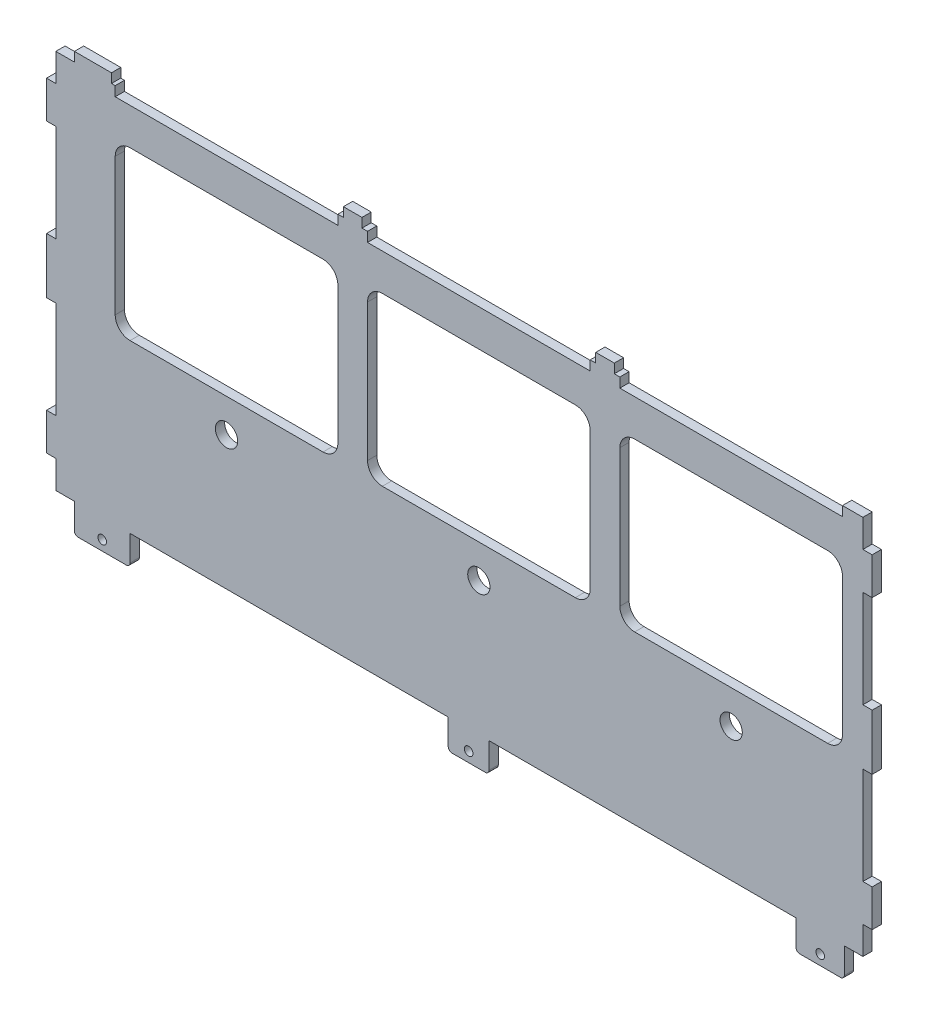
ISO-10303-21;
HEADER;
FILE_DESCRIPTION(('STEP AP214'),'2;1');
FILE_NAME('part.step','',(''),(''),'','','');
FILE_SCHEMA(('AUTOMOTIVE_DESIGN { 1 0 10303 214 1 1 1 1 }'));
ENDSEC;
DATA;
#1=APPLICATION_CONTEXT('core data for automotive mechanical design processes');
#2=APPLICATION_PROTOCOL_DEFINITION('international standard','automotive_design',2000,#1);
#3=PRODUCT_CONTEXT('',#1,'mechanical');
#4=PRODUCT('Part','Part','',(#3));
#5=PRODUCT_RELATED_PRODUCT_CATEGORY('part','',(#4));
#6=PRODUCT_DEFINITION_FORMATION('','',#4);
#7=PRODUCT_DEFINITION_CONTEXT('part definition',#1,'design');
#8=PRODUCT_DEFINITION('design','',#6,#7);
#9=PRODUCT_DEFINITION_SHAPE('','',#8);
#10=(LENGTH_UNIT() NAMED_UNIT(*) SI_UNIT(.MILLI.,.METRE.));
#11=(NAMED_UNIT(*) PLANE_ANGLE_UNIT() SI_UNIT($,.RADIAN.));
#12=(NAMED_UNIT(*) SI_UNIT($,.STERADIAN.) SOLID_ANGLE_UNIT());
#13=UNCERTAINTY_MEASURE_WITH_UNIT(LENGTH_MEASURE(1.E-05),#10,'distance_accuracy_value','');
#14=(GEOMETRIC_REPRESENTATION_CONTEXT(3) GLOBAL_UNCERTAINTY_ASSIGNED_CONTEXT((#13)) GLOBAL_UNIT_ASSIGNED_CONTEXT((#10,
#11,#12)) REPRESENTATION_CONTEXT('',''));
#15=CARTESIAN_POINT('',(0.,0.,0.));
#16=DIRECTION('',(0.,0.,1.));
#17=DIRECTION('',(1.,0.,0.));
#18=AXIS2_PLACEMENT_3D('',#15,#16,#17);
#19=CARTESIAN_POINT('',(0.,0.,3.175));
#20=DIRECTION('',(0.,0.,-1.));
#21=DIRECTION('',(-1.,0.,0.));
#22=AXIS2_PLACEMENT_3D('',#19,#20,#21);
#23=PLANE('',#22);
#24=CARTESIAN_POINT('',(261.62,-6.604,3.175));
#25=DIRECTION('',(0.,0.,1.));
#26=DIRECTION('',(1.,0.,0.));
#27=AXIS2_PLACEMENT_3D('',#24,#25,#26);
#28=CIRCLE('',#27,1.47320000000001);
#29=CARTESIAN_POINT('',(263.0932,-6.604,3.175));
#30=VERTEX_POINT('',#29);
#31=EDGE_CURVE('E829',#30,#30,#28,.T.);
#32=ORIENTED_EDGE('',*,*,#31,.F.);
#33=EDGE_LOOP('',(#32));
#34=FACE_BOUND('',#33,.T.);
#35=CARTESIAN_POINT('',(15.875,-6.604,3.175));
#36=DIRECTION('',(0.,0.,1.));
#37=DIRECTION('',(1.,0.,0.));
#38=AXIS2_PLACEMENT_3D('',#35,#36,#37);
#39=CIRCLE('',#38,1.47319999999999);
#40=CARTESIAN_POINT('',(17.3482,-6.604,3.175));
#41=VERTEX_POINT('',#40);
#42=EDGE_CURVE('E825',#41,#41,#39,.T.);
#43=ORIENTED_EDGE('',*,*,#42,.F.);
#44=EDGE_LOOP('',(#43));
#45=FACE_BOUND('',#44,.T.);
#46=CARTESIAN_POINT('',(231.14,45.72,3.175));
#47=DIRECTION('',(0.,0.,1.));
#48=DIRECTION('',(1.,0.,0.));
#49=AXIS2_PLACEMENT_3D('',#46,#47,#48);
#50=CIRCLE('',#49,3.80999999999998);
#51=CARTESIAN_POINT('',(234.95,45.72,3.175));
#52=VERTEX_POINT('',#51);
#53=EDGE_CURVE('E1214',#52,#52,#50,.T.);
#54=ORIENTED_EDGE('',*,*,#53,.F.);
#55=EDGE_LOOP('',(#54));
#56=FACE_BOUND('',#55,.T.);
#57=CARTESIAN_POINT('',(144.78,45.72,3.175));
#58=DIRECTION('',(0.,0.,1.));
#59=DIRECTION('',(-1.,0.,0.));
#60=AXIS2_PLACEMENT_3D('',#57,#58,#59);
#61=CIRCLE('',#60,3.81000000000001);
#62=CARTESIAN_POINT('',(140.97,45.72,3.175));
#63=VERTEX_POINT('',#62);
#64=EDGE_CURVE('E1244',#63,#63,#61,.T.);
#65=ORIENTED_EDGE('',*,*,#64,.F.);
#66=EDGE_LOOP('',(#65));
#67=FACE_BOUND('',#66,.T.);
#68=DIRECTION('',(0.,-1.,0.));
#69=VECTOR('',#68,1.);
#70=CARTESIAN_POINT('',(20.3200000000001,114.3,3.175));
#71=LINE('',#70,#69);
#72=CARTESIAN_POINT('',(20.3200000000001,109.22,3.175));
#73=VERTEX_POINT('',#72);
#74=CARTESIAN_POINT('',(20.3200000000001,62.23,3.175));
#75=VERTEX_POINT('',#74);
#76=EDGE_CURVE('E1256',#73,#75,#71,.T.);
#77=ORIENTED_EDGE('',*,*,#76,.F.);
#78=CARTESIAN_POINT('',(25.4000000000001,109.22,3.175));
#79=DIRECTION('',(0.,0.,-1.));
#80=DIRECTION('',(-1.,0.,0.));
#81=AXIS2_PLACEMENT_3D('',#78,#79,#80);
#82=CIRCLE('',#81,5.08);
#83=CARTESIAN_POINT('',(25.4000000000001,114.3,3.175));
#84=VERTEX_POINT('',#83);
#85=EDGE_CURVE('E838',#73,#84,#82,.T.);
#86=ORIENTED_EDGE('',*,*,#85,.T.);
#87=DIRECTION('',(-1.,0.,0.));
#88=VECTOR('',#87,1.);
#89=CARTESIAN_POINT('',(20.3200000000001,114.3,3.175));
#90=LINE('',#89,#88);
#91=CARTESIAN_POINT('',(91.44,114.3,3.175));
#92=VERTEX_POINT('',#91);
#93=EDGE_CURVE('E936',#92,#84,#90,.T.);
#94=ORIENTED_EDGE('',*,*,#93,.F.);
#95=CARTESIAN_POINT('',(91.44,109.22,3.175));
#96=DIRECTION('',(0.,0.,-1.));
#97=DIRECTION('',(-1.,0.,0.));
#98=AXIS2_PLACEMENT_3D('',#95,#96,#97);
#99=CIRCLE('',#98,5.08);
#100=CARTESIAN_POINT('',(96.52,109.22,3.175));
#101=VERTEX_POINT('',#100);
#102=EDGE_CURVE('E1294',#92,#101,#99,.T.);
#103=ORIENTED_EDGE('',*,*,#102,.T.);
#104=DIRECTION('',(0.,1.,0.));
#105=VECTOR('',#104,1.);
#106=CARTESIAN_POINT('',(96.5199999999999,114.3,3.175));
#107=LINE('',#106,#105);
#108=CARTESIAN_POINT('',(96.52,62.23,3.175));
#109=VERTEX_POINT('',#108);
#110=EDGE_CURVE('E1263',#109,#101,#107,.T.);
#111=ORIENTED_EDGE('',*,*,#110,.F.);
#112=CARTESIAN_POINT('',(91.44,62.23,3.175));
#113=DIRECTION('',(0.,0.,-1.));
#114=DIRECTION('',(-1.,0.,0.));
#115=AXIS2_PLACEMENT_3D('',#112,#113,#114);
#116=CIRCLE('',#115,5.08);
#117=CARTESIAN_POINT('',(91.44,57.15,3.175));
#118=VERTEX_POINT('',#117);
#119=EDGE_CURVE('E1338',#109,#118,#116,.T.);
#120=ORIENTED_EDGE('',*,*,#119,.T.);
#121=DIRECTION('',(1.,0.,0.));
#122=VECTOR('',#121,1.);
#123=CARTESIAN_POINT('',(20.3200000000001,57.15,3.175));
#124=LINE('',#123,#122);
#125=CARTESIAN_POINT('',(25.4000000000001,57.15,3.175));
#126=VERTEX_POINT('',#125);
#127=EDGE_CURVE('E1259',#126,#118,#124,.T.);
#128=ORIENTED_EDGE('',*,*,#127,.F.);
#129=CARTESIAN_POINT('',(25.4000000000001,62.23,3.175));
#130=DIRECTION('',(0.,0.,-1.));
#131=DIRECTION('',(-1.,0.,0.));
#132=AXIS2_PLACEMENT_3D('',#129,#130,#131);
#133=CIRCLE('',#132,5.08);
#134=EDGE_CURVE('E1318',#126,#75,#133,.T.);
#135=ORIENTED_EDGE('',*,*,#134,.T.);
#136=EDGE_LOOP('',(#77,#86,#94,#103,#111,#120,#128,#135));
#137=FACE_BOUND('',#136,.T.);
#138=DIRECTION('',(1.,0.,0.));
#139=VECTOR('',#138,1.);
#140=CARTESIAN_POINT('',(253.365,-10.033,3.175));
#141=LINE('',#140,#139);
#142=CARTESIAN_POINT('',(254.635,-10.033,3.175));
#143=VERTEX_POINT('',#142);
#144=CARTESIAN_POINT('',(268.605,-10.033,3.175));
#145=VERTEX_POINT('',#144);
#146=EDGE_CURVE('E712',#143,#145,#141,.T.);
#147=ORIENTED_EDGE('',*,*,#146,.T.);
#148=CARTESIAN_POINT('',(268.605,-8.76299999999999,3.175));
#149=DIRECTION('',(0.,0.,-1.));
#150=DIRECTION('',(-1.,0.,0.));
#151=AXIS2_PLACEMENT_3D('',#148,#149,#150);
#152=CIRCLE('',#151,1.27);
#153=CARTESIAN_POINT('',(269.875,-8.76299999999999,3.175));
#154=VERTEX_POINT('',#153);
#155=EDGE_CURVE('E1027',#145,#154,#152,.F.);
#156=ORIENTED_EDGE('',*,*,#155,.T.);
#157=DIRECTION('',(0.,1.,0.));
#158=VECTOR('',#157,1.);
#159=CARTESIAN_POINT('',(269.875,0.,3.175));
#160=LINE('',#159,#158);
#161=CARTESIAN_POINT('',(269.875,0.,3.175));
#162=VERTEX_POINT('',#161);
#163=EDGE_CURVE('E715',#154,#162,#160,.T.);
#164=ORIENTED_EDGE('',*,*,#163,.T.);
#165=DIRECTION('',(1.,0.,0.));
#166=VECTOR('',#165,1.);
#167=CARTESIAN_POINT('',(0.,0.,3.175));
#168=LINE('',#167,#166);
#169=CARTESIAN_POINT('',(276.225,0.,3.175));
#170=VERTEX_POINT('',#169);
#171=EDGE_CURVE('E783',#162,#170,#168,.T.);
#172=ORIENTED_EDGE('',*,*,#171,.T.);
#173=DIRECTION('',(0.,1.,0.));
#174=VECTOR('',#173,1.);
#175=CARTESIAN_POINT('',(276.225,0.,3.175));
#176=LINE('',#175,#174);
#177=CARTESIAN_POINT('',(276.225,9.52500000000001,3.175));
#178=VERTEX_POINT('',#177);
#179=EDGE_CURVE('E1115',#170,#178,#176,.T.);
#180=ORIENTED_EDGE('',*,*,#179,.T.);
#181=DIRECTION('',(1.,0.,0.));
#182=VECTOR('',#181,1.);
#183=CARTESIAN_POINT('',(276.225,9.52500000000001,3.175));
#184=LINE('',#183,#182);
#185=CARTESIAN_POINT('',(279.4,9.52499999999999,3.175));
#186=VERTEX_POINT('',#185);
#187=EDGE_CURVE('E1117',#178,#186,#184,.T.);
#188=ORIENTED_EDGE('',*,*,#187,.T.);
#189=DIRECTION('',(0.,1.,0.));
#190=VECTOR('',#189,1.);
#191=CARTESIAN_POINT('',(279.4,9.52499999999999,3.175));
#192=LINE('',#191,#190);
#193=CARTESIAN_POINT('',(279.4,22.225,3.175));
#194=VERTEX_POINT('',#193);
#195=EDGE_CURVE('E1130',#186,#194,#192,.T.);
#196=ORIENTED_EDGE('',*,*,#195,.T.);
#197=DIRECTION('',(-1.,0.,0.));
#198=VECTOR('',#197,1.);
#199=CARTESIAN_POINT('',(276.225,22.225,3.175));
#200=LINE('',#199,#198);
#201=CARTESIAN_POINT('',(276.225,22.225,3.175));
#202=VERTEX_POINT('',#201);
#203=EDGE_CURVE('E1133',#194,#202,#200,.T.);
#204=ORIENTED_EDGE('',*,*,#203,.T.);
#205=CARTESIAN_POINT('',(276.225,55.5625,3.175));
#206=VERTEX_POINT('',#205);
#207=EDGE_CURVE('E1121',#202,#206,#176,.T.);
#208=ORIENTED_EDGE('',*,*,#207,.T.);
#209=DIRECTION('',(1.,0.,0.));
#210=VECTOR('',#209,1.);
#211=CARTESIAN_POINT('',(276.225,55.5625,3.175));
#212=LINE('',#211,#210);
#213=CARTESIAN_POINT('',(279.4,55.5625,3.175));
#214=VERTEX_POINT('',#213);
#215=EDGE_CURVE('E2703',#206,#214,#212,.T.);
#216=ORIENTED_EDGE('',*,*,#215,.T.);
#217=DIRECTION('',(0.,1.,0.));
#218=VECTOR('',#217,1.);
#219=CARTESIAN_POINT('',(279.4,74.6125,3.175));
#220=LINE('',#219,#218);
#221=CARTESIAN_POINT('',(279.4,74.6125,3.175));
#222=VERTEX_POINT('',#221);
#223=EDGE_CURVE('E2706',#214,#222,#220,.T.);
#224=ORIENTED_EDGE('',*,*,#223,.T.);
#225=DIRECTION('',(-1.,0.,0.));
#226=VECTOR('',#225,1.);
#227=CARTESIAN_POINT('',(276.225,74.6125,3.175));
#228=LINE('',#227,#226);
#229=CARTESIAN_POINT('',(276.225,74.6125,3.175));
#230=VERTEX_POINT('',#229);
#231=EDGE_CURVE('E2699',#222,#230,#228,.T.);
#232=ORIENTED_EDGE('',*,*,#231,.T.);
#233=CARTESIAN_POINT('',(276.225,107.95,3.175));
#234=VERTEX_POINT('',#233);
#235=EDGE_CURVE('E1361',#230,#234,#176,.T.);
#236=ORIENTED_EDGE('',*,*,#235,.T.);
#237=DIRECTION('',(1.,0.,0.));
#238=VECTOR('',#237,1.);
#239=CARTESIAN_POINT('',(276.225,107.95,3.175));
#240=LINE('',#239,#238);
#241=CARTESIAN_POINT('',(279.4,107.95,3.175));
#242=VERTEX_POINT('',#241);
#243=EDGE_CURVE('E1159',#234,#242,#240,.T.);
#244=ORIENTED_EDGE('',*,*,#243,.T.);
#245=DIRECTION('',(0.,1.,0.));
#246=VECTOR('',#245,1.);
#247=CARTESIAN_POINT('',(279.4,120.65,3.175));
#248=LINE('',#247,#246);
#249=CARTESIAN_POINT('',(279.4,120.65,3.175));
#250=VERTEX_POINT('',#249);
#251=EDGE_CURVE('E1156',#242,#250,#248,.T.);
#252=ORIENTED_EDGE('',*,*,#251,.T.);
#253=DIRECTION('',(-1.,0.,0.));
#254=VECTOR('',#253,1.);
#255=CARTESIAN_POINT('',(276.225,120.65,3.175));
#256=LINE('',#255,#254);
#257=CARTESIAN_POINT('',(276.225,120.65,3.175));
#258=VERTEX_POINT('',#257);
#259=EDGE_CURVE('E1158',#250,#258,#256,.T.);
#260=ORIENTED_EDGE('',*,*,#259,.T.);
#261=CARTESIAN_POINT('',(276.225,130.175,3.175));
#262=VERTEX_POINT('',#261);
#263=EDGE_CURVE('E804',#258,#262,#176,.T.);
#264=ORIENTED_EDGE('',*,*,#263,.T.);
#265=DIRECTION('',(-1.,0.,0.));
#266=VECTOR('',#265,1.);
#267=CARTESIAN_POINT('',(269.24,130.175,3.175));
#268=LINE('',#267,#266);
#269=CARTESIAN_POINT('',(269.24,130.175,3.175));
#270=VERTEX_POINT('',#269);
#271=EDGE_CURVE('E1120',#262,#270,#268,.T.);
#272=ORIENTED_EDGE('',*,*,#271,.T.);
#273=DIRECTION('',(0.,-1.,0.));
#274=VECTOR('',#273,1.);
#275=CARTESIAN_POINT('',(269.24,126.873,3.175));
#276=LINE('',#275,#274);
#277=CARTESIAN_POINT('',(269.24,126.873,3.175));
#278=VERTEX_POINT('',#277);
#279=EDGE_CURVE('E2607',#270,#278,#276,.T.);
#280=ORIENTED_EDGE('',*,*,#279,.T.);
#281=DIRECTION('',(-1.,0.,0.));
#282=VECTOR('',#281,1.);
#283=CARTESIAN_POINT('',(193.04,126.873,3.175));
#284=LINE('',#283,#282);
#285=CARTESIAN_POINT('',(193.04,126.873,3.175));
#286=VERTEX_POINT('',#285);
#287=EDGE_CURVE('E2619',#278,#286,#284,.T.);
#288=ORIENTED_EDGE('',*,*,#287,.T.);
#289=DIRECTION('',(0.,1.,0.));
#290=VECTOR('',#289,1.);
#291=CARTESIAN_POINT('',(193.04,130.175,3.175));
#292=LINE('',#291,#290);
#293=CARTESIAN_POINT('',(193.04,130.175,3.175));
#294=VERTEX_POINT('',#293);
#295=EDGE_CURVE('E2615',#286,#294,#292,.T.);
#296=ORIENTED_EDGE('',*,*,#295,.T.);
#297=DIRECTION('',(-1.,0.,0.));
#298=VECTOR('',#297,1.);
#299=CARTESIAN_POINT('',(182.88,130.175,3.175));
#300=LINE('',#299,#298);
#301=CARTESIAN_POINT('',(191.135,130.175,3.175));
#302=VERTEX_POINT('',#301);
#303=EDGE_CURVE('E2621',#294,#302,#300,.T.);
#304=ORIENTED_EDGE('',*,*,#303,.T.);
#305=DIRECTION('',(0.,1.,0.));
#306=VECTOR('',#305,1.);
#307=CARTESIAN_POINT('',(191.135,130.175,3.175));
#308=LINE('',#307,#306);
#309=CARTESIAN_POINT('',(191.135,133.35,3.175));
#310=VERTEX_POINT('',#309);
#311=EDGE_CURVE('E661',#302,#310,#308,.T.);
#312=ORIENTED_EDGE('',*,*,#311,.T.);
#313=DIRECTION('',(-1.,0.,0.));
#314=VECTOR('',#313,1.);
#315=CARTESIAN_POINT('',(184.785,133.35,3.175));
#316=LINE('',#315,#314);
#317=CARTESIAN_POINT('',(184.785,133.35,3.175));
#318=VERTEX_POINT('',#317);
#319=EDGE_CURVE('E664',#310,#318,#316,.T.);
#320=ORIENTED_EDGE('',*,*,#319,.T.);
#321=DIRECTION('',(0.,-1.,0.));
#322=VECTOR('',#321,1.);
#323=CARTESIAN_POINT('',(184.785,130.175,3.175));
#324=LINE('',#323,#322);
#325=CARTESIAN_POINT('',(184.785,130.175,3.175));
#326=VERTEX_POINT('',#325);
#327=EDGE_CURVE('E658',#318,#326,#324,.T.);
#328=ORIENTED_EDGE('',*,*,#327,.T.);
#329=CARTESIAN_POINT('',(182.88,130.175,3.175));
#330=VERTEX_POINT('',#329);
#331=EDGE_CURVE('E2618',#326,#330,#300,.T.);
#332=ORIENTED_EDGE('',*,*,#331,.T.);
#333=DIRECTION('',(0.,-1.,0.));
#334=VECTOR('',#333,1.);
#335=CARTESIAN_POINT('',(182.88,126.873,3.175));
#336=LINE('',#335,#334);
#337=CARTESIAN_POINT('',(182.88,126.873,3.175));
#338=VERTEX_POINT('',#337);
#339=EDGE_CURVE('E2626',#330,#338,#336,.T.);
#340=ORIENTED_EDGE('',*,*,#339,.T.);
#341=DIRECTION('',(-1.,0.,0.));
#342=VECTOR('',#341,1.);
#343=CARTESIAN_POINT('',(106.68,126.873,3.175));
#344=LINE('',#343,#342);
#345=CARTESIAN_POINT('',(106.68,126.873,3.175));
#346=VERTEX_POINT('',#345);
#347=EDGE_CURVE('E2628',#338,#346,#344,.T.);
#348=ORIENTED_EDGE('',*,*,#347,.T.);
#349=DIRECTION('',(0.,1.,0.));
#350=VECTOR('',#349,1.);
#351=CARTESIAN_POINT('',(106.68,130.175,3.175));
#352=LINE('',#351,#350);
#353=CARTESIAN_POINT('',(106.68,130.175,3.175));
#354=VERTEX_POINT('',#353);
#355=EDGE_CURVE('E2630',#346,#354,#352,.T.);
#356=ORIENTED_EDGE('',*,*,#355,.T.);
#357=DIRECTION('',(-1.,0.,0.));
#358=VECTOR('',#357,1.);
#359=CARTESIAN_POINT('',(96.52,130.175,3.175));
#360=LINE('',#359,#358);
#361=CARTESIAN_POINT('',(104.775,130.175,3.175));
#362=VERTEX_POINT('',#361);
#363=EDGE_CURVE('E2633',#354,#362,#360,.T.);
#364=ORIENTED_EDGE('',*,*,#363,.T.);
#365=DIRECTION('',(0.,1.,0.));
#366=VECTOR('',#365,1.);
#367=CARTESIAN_POINT('',(104.775,130.175,3.175));
#368=LINE('',#367,#366);
#369=CARTESIAN_POINT('',(104.775,133.35,3.175));
#370=VERTEX_POINT('',#369);
#371=EDGE_CURVE('E687',#362,#370,#368,.T.);
#372=ORIENTED_EDGE('',*,*,#371,.T.);
#373=DIRECTION('',(-1.,0.,0.));
#374=VECTOR('',#373,1.);
#375=CARTESIAN_POINT('',(98.425,133.35,3.175));
#376=LINE('',#375,#374);
#377=CARTESIAN_POINT('',(98.425,133.35,3.175));
#378=VERTEX_POINT('',#377);
#379=EDGE_CURVE('E690',#370,#378,#376,.T.);
#380=ORIENTED_EDGE('',*,*,#379,.T.);
#381=DIRECTION('',(0.,-1.,0.));
#382=VECTOR('',#381,1.);
#383=CARTESIAN_POINT('',(98.425,130.175,3.175));
#384=LINE('',#383,#382);
#385=CARTESIAN_POINT('',(98.425,130.175,3.175));
#386=VERTEX_POINT('',#385);
#387=EDGE_CURVE('E684',#378,#386,#384,.T.);
#388=ORIENTED_EDGE('',*,*,#387,.T.);
#389=CARTESIAN_POINT('',(96.52,130.175,3.175));
#390=VERTEX_POINT('',#389);
#391=EDGE_CURVE('E2632',#386,#390,#360,.T.);
#392=ORIENTED_EDGE('',*,*,#391,.T.);
#393=DIRECTION('',(0.,-1.,0.));
#394=VECTOR('',#393,1.);
#395=CARTESIAN_POINT('',(96.52,126.873,3.175));
#396=LINE('',#395,#394);
#397=CARTESIAN_POINT('',(96.52,126.873,3.175));
#398=VERTEX_POINT('',#397);
#399=EDGE_CURVE('E2636',#390,#398,#396,.T.);
#400=ORIENTED_EDGE('',*,*,#399,.T.);
#401=DIRECTION('',(-1.,0.,0.));
#402=VECTOR('',#401,1.);
#403=CARTESIAN_POINT('',(20.3200000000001,126.873,3.175));
#404=LINE('',#403,#402);
#405=CARTESIAN_POINT('',(20.3200000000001,126.873,3.175));
#406=VERTEX_POINT('',#405);
#407=EDGE_CURVE('E2638',#398,#406,#404,.T.);
#408=ORIENTED_EDGE('',*,*,#407,.T.);
#409=DIRECTION('',(0.,1.,0.));
#410=VECTOR('',#409,1.);
#411=CARTESIAN_POINT('',(20.32,130.175,3.175));
#412=LINE('',#411,#410);
#413=CARTESIAN_POINT('',(20.32,130.175,3.175));
#414=VERTEX_POINT('',#413);
#415=EDGE_CURVE('E1382',#406,#414,#412,.T.);
#416=ORIENTED_EDGE('',*,*,#415,.T.);
#417=DIRECTION('',(-1.,0.,0.));
#418=VECTOR('',#417,1.);
#419=CARTESIAN_POINT('',(0.,130.175,3.175));
#420=LINE('',#419,#418);
#421=CARTESIAN_POINT('',(19.05,130.175,3.175));
#422=VERTEX_POINT('',#421);
#423=EDGE_CURVE('E624',#414,#422,#420,.T.);
#424=ORIENTED_EDGE('',*,*,#423,.T.);
#425=DIRECTION('',(0.,1.,0.));
#426=VECTOR('',#425,1.);
#427=CARTESIAN_POINT('',(19.05,130.175,3.175));
#428=LINE('',#427,#426);
#429=CARTESIAN_POINT('',(19.05,133.35,3.175));
#430=VERTEX_POINT('',#429);
#431=EDGE_CURVE('E615',#422,#430,#428,.T.);
#432=ORIENTED_EDGE('',*,*,#431,.T.);
#433=DIRECTION('',(-1.,0.,0.));
#434=VECTOR('',#433,1.);
#435=CARTESIAN_POINT('',(6.35,133.35,3.175));
#436=LINE('',#435,#434);
#437=CARTESIAN_POINT('',(6.35,133.35,3.175));
#438=VERTEX_POINT('',#437);
#439=EDGE_CURVE('E621',#430,#438,#436,.T.);
#440=ORIENTED_EDGE('',*,*,#439,.T.);
#441=DIRECTION('',(0.,-1.,0.));
#442=VECTOR('',#441,1.);
#443=CARTESIAN_POINT('',(6.35,130.175,3.175));
#444=LINE('',#443,#442);
#445=CARTESIAN_POINT('',(6.35,130.175,3.175));
#446=VERTEX_POINT('',#445);
#447=EDGE_CURVE('E627',#438,#446,#444,.T.);
#448=ORIENTED_EDGE('',*,*,#447,.T.);
#449=CARTESIAN_POINT('',(0.,130.175,3.175));
#450=VERTEX_POINT('',#449);
#451=EDGE_CURVE('E1379',#446,#450,#420,.T.);
#452=ORIENTED_EDGE('',*,*,#451,.T.);
#453=DIRECTION('',(0.,-1.,0.));
#454=VECTOR('',#453,1.);
#455=CARTESIAN_POINT('',(0.,0.,3.175));
#456=LINE('',#455,#454);
#457=CARTESIAN_POINT('',(0.,120.65,3.175));
#458=VERTEX_POINT('',#457);
#459=EDGE_CURVE('E822',#450,#458,#456,.T.);
#460=ORIENTED_EDGE('',*,*,#459,.T.);
#461=DIRECTION('',(-1.,0.,0.));
#462=VECTOR('',#461,1.);
#463=CARTESIAN_POINT('',(0.,120.65,3.175));
#464=LINE('',#463,#462);
#465=CARTESIAN_POINT('',(-3.17499999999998,120.65,3.175));
#466=VERTEX_POINT('',#465);
#467=EDGE_CURVE('E863',#458,#466,#464,.T.);
#468=ORIENTED_EDGE('',*,*,#467,.T.);
#469=DIRECTION('',(0.,-1.,0.));
#470=VECTOR('',#469,1.);
#471=CARTESIAN_POINT('',(-3.17499999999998,120.65,3.175));
#472=LINE('',#471,#470);
#473=CARTESIAN_POINT('',(-3.17499999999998,107.95,3.175));
#474=VERTEX_POINT('',#473);
#475=EDGE_CURVE('E1377',#466,#474,#472,.T.);
#476=ORIENTED_EDGE('',*,*,#475,.T.);
#477=DIRECTION('',(1.,0.,0.));
#478=VECTOR('',#477,1.);
#479=CARTESIAN_POINT('',(0.,107.95,3.175));
#480=LINE('',#479,#478);
#481=CARTESIAN_POINT('',(0.,107.95,3.175));
#482=VERTEX_POINT('',#481);
#483=EDGE_CURVE('E858',#474,#482,#480,.T.);
#484=ORIENTED_EDGE('',*,*,#483,.T.);
#485=CARTESIAN_POINT('',(0.,74.6125,3.175));
#486=VERTEX_POINT('',#485);
#487=EDGE_CURVE('E938',#482,#486,#456,.T.);
#488=ORIENTED_EDGE('',*,*,#487,.T.);
#489=DIRECTION('',(-1.,0.,0.));
#490=VECTOR('',#489,1.);
#491=CARTESIAN_POINT('',(0.,74.6125,3.175));
#492=LINE('',#491,#490);
#493=CARTESIAN_POINT('',(-3.17499999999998,74.6125,3.175));
#494=VERTEX_POINT('',#493);
#495=EDGE_CURVE('E905',#486,#494,#492,.T.);
#496=ORIENTED_EDGE('',*,*,#495,.T.);
#497=DIRECTION('',(0.,-1.,0.));
#498=VECTOR('',#497,1.);
#499=CARTESIAN_POINT('',(-3.17499999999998,74.6125,3.175));
#500=LINE('',#499,#498);
#501=CARTESIAN_POINT('',(-3.17499999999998,55.5625,3.175));
#502=VERTEX_POINT('',#501);
#503=EDGE_CURVE('E902',#494,#502,#500,.T.);
#504=ORIENTED_EDGE('',*,*,#503,.T.);
#505=DIRECTION('',(1.,0.,0.));
#506=VECTOR('',#505,1.);
#507=CARTESIAN_POINT('',(0.,55.5625,3.175));
#508=LINE('',#507,#506);
#509=CARTESIAN_POINT('',(0.,55.5625,3.175));
#510=VERTEX_POINT('',#509);
#511=EDGE_CURVE('E904',#502,#510,#508,.T.);
#512=ORIENTED_EDGE('',*,*,#511,.T.);
#513=CARTESIAN_POINT('',(0.,22.225,3.175));
#514=VERTEX_POINT('',#513);
#515=EDGE_CURVE('E931',#510,#514,#456,.T.);
#516=ORIENTED_EDGE('',*,*,#515,.T.);
#517=DIRECTION('',(-1.,0.,0.));
#518=VECTOR('',#517,1.);
#519=CARTESIAN_POINT('',(0.,22.225,3.175));
#520=LINE('',#519,#518);
#521=CARTESIAN_POINT('',(-3.17499999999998,22.225,3.175));
#522=VERTEX_POINT('',#521);
#523=EDGE_CURVE('E876',#514,#522,#520,.T.);
#524=ORIENTED_EDGE('',*,*,#523,.T.);
#525=DIRECTION('',(0.,-1.,0.));
#526=VECTOR('',#525,1.);
#527=CARTESIAN_POINT('',(-3.17499999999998,9.52499999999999,3.175));
#528=LINE('',#527,#526);
#529=CARTESIAN_POINT('',(-3.17499999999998,9.52499999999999,3.175));
#530=VERTEX_POINT('',#529);
#531=EDGE_CURVE('E878',#522,#530,#528,.T.);
#532=ORIENTED_EDGE('',*,*,#531,.T.);
#533=DIRECTION('',(1.,0.,0.));
#534=VECTOR('',#533,1.);
#535=CARTESIAN_POINT('',(0.,9.52500000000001,3.175));
#536=LINE('',#535,#534);
#537=CARTESIAN_POINT('',(0.,9.52499999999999,3.175));
#538=VERTEX_POINT('',#537);
#539=EDGE_CURVE('E881',#530,#538,#536,.T.);
#540=ORIENTED_EDGE('',*,*,#539,.T.);
#541=CARTESIAN_POINT('',(0.,0.,3.175));
#542=VERTEX_POINT('',#541);
#543=EDGE_CURVE('E929',#538,#542,#456,.T.);
#544=ORIENTED_EDGE('',*,*,#543,.T.);
#545=CARTESIAN_POINT('',(6.35000000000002,0.,3.175));
#546=VERTEX_POINT('',#545);
#547=EDGE_CURVE('E801',#542,#546,#168,.T.);
#548=ORIENTED_EDGE('',*,*,#547,.T.);
#549=DIRECTION('',(0.,-1.,0.));
#550=VECTOR('',#549,1.);
#551=CARTESIAN_POINT('',(6.35000000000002,0.,3.175));
#552=LINE('',#551,#550);
#553=CARTESIAN_POINT('',(6.35000000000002,-8.76299999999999,3.175));
#554=VERTEX_POINT('',#553);
#555=EDGE_CURVE('E754',#546,#554,#552,.T.);
#556=ORIENTED_EDGE('',*,*,#555,.T.);
#557=CARTESIAN_POINT('',(7.62000000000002,-8.76299999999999,3.175));
#558=DIRECTION('',(0.,0.,-1.));
#559=DIRECTION('',(-1.,0.,0.));
#560=AXIS2_PLACEMENT_3D('',#557,#558,#559);
#561=CIRCLE('',#560,1.27);
#562=CARTESIAN_POINT('',(7.62000000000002,-10.033,3.175));
#563=VERTEX_POINT('',#562);
#564=EDGE_CURVE('E1017',#554,#563,#561,.F.);
#565=ORIENTED_EDGE('',*,*,#564,.T.);
#566=DIRECTION('',(1.,0.,0.));
#567=VECTOR('',#566,1.);
#568=CARTESIAN_POINT('',(6.35000000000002,-10.033,3.175));
#569=LINE('',#568,#567);
#570=CARTESIAN_POINT('',(24.13,-10.033,3.175));
#571=VERTEX_POINT('',#570);
#572=EDGE_CURVE('E750',#563,#571,#569,.T.);
#573=ORIENTED_EDGE('',*,*,#572,.T.);
#574=CARTESIAN_POINT('',(24.13,-8.76299999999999,3.175));
#575=DIRECTION('',(0.,0.,-1.));
#576=DIRECTION('',(-1.,0.,0.));
#577=AXIS2_PLACEMENT_3D('',#574,#575,#576);
#578=CIRCLE('',#577,1.27);
#579=CARTESIAN_POINT('',(25.4,-8.76299999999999,3.175));
#580=VERTEX_POINT('',#579);
#581=EDGE_CURVE('E1020',#571,#580,#578,.F.);
#582=ORIENTED_EDGE('',*,*,#581,.T.);
#583=DIRECTION('',(0.,1.,0.));
#584=VECTOR('',#583,1.);
#585=CARTESIAN_POINT('',(25.4,0.,3.175));
#586=LINE('',#585,#584);
#587=CARTESIAN_POINT('',(25.4,0.,3.175));
#588=VERTEX_POINT('',#587);
#589=EDGE_CURVE('E753',#580,#588,#586,.T.);
#590=ORIENTED_EDGE('',*,*,#589,.T.);
#591=CARTESIAN_POINT('',(134.3025,0.,3.175));
#592=VERTEX_POINT('',#591);
#593=EDGE_CURVE('E782',#588,#592,#168,.T.);
#594=ORIENTED_EDGE('',*,*,#593,.T.);
#595=DIRECTION('',(0.,-1.,0.));
#596=VECTOR('',#595,1.);
#597=CARTESIAN_POINT('',(134.3025,0.,3.175));
#598=LINE('',#597,#596);
#599=CARTESIAN_POINT('',(134.3025,-8.76300000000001,3.175));
#600=VERTEX_POINT('',#599);
#601=EDGE_CURVE('E729',#592,#600,#598,.T.);
#602=ORIENTED_EDGE('',*,*,#601,.T.);
#603=CARTESIAN_POINT('',(135.5725,-8.763,3.175));
#604=DIRECTION('',(0.,0.,-1.));
#605=DIRECTION('',(-1.,0.,0.));
#606=AXIS2_PLACEMENT_3D('',#603,#604,#605);
#607=CIRCLE('',#606,1.27);
#608=CARTESIAN_POINT('',(135.5725,-10.033,3.175));
#609=VERTEX_POINT('',#608);
#610=EDGE_CURVE('E1022',#600,#609,#607,.F.);
#611=ORIENTED_EDGE('',*,*,#610,.T.);
#612=DIRECTION('',(1.,0.,0.));
#613=VECTOR('',#612,1.);
#614=CARTESIAN_POINT('',(134.3025,-10.033,3.175));
#615=LINE('',#614,#613);
#616=CARTESIAN_POINT('',(147.0025,-10.033,3.175));
#617=VERTEX_POINT('',#616);
#618=EDGE_CURVE('E732',#609,#617,#615,.T.);
#619=ORIENTED_EDGE('',*,*,#618,.T.);
#620=CARTESIAN_POINT('',(147.0025,-8.763,3.175));
#621=DIRECTION('',(0.,0.,-1.));
#622=DIRECTION('',(-1.,0.,0.));
#623=AXIS2_PLACEMENT_3D('',#620,#621,#622);
#624=CIRCLE('',#623,1.27);
#625=CARTESIAN_POINT('',(148.2725,-8.763,3.175));
#626=VERTEX_POINT('',#625);
#627=EDGE_CURVE('E56',#617,#626,#624,.F.);
#628=ORIENTED_EDGE('',*,*,#627,.T.);
#629=DIRECTION('',(0.,1.,0.));
#630=VECTOR('',#629,1.);
#631=CARTESIAN_POINT('',(148.2725,0.,3.175));
#632=LINE('',#631,#630);
#633=CARTESIAN_POINT('',(148.2725,0.,3.175));
#634=VERTEX_POINT('',#633);
#635=EDGE_CURVE('E735',#626,#634,#632,.T.);
#636=ORIENTED_EDGE('',*,*,#635,.T.);
#637=CARTESIAN_POINT('',(253.365,0.,3.175));
#638=VERTEX_POINT('',#637);
#639=EDGE_CURVE('E778',#634,#638,#168,.T.);
#640=ORIENTED_EDGE('',*,*,#639,.T.);
#641=DIRECTION('',(0.,-1.,0.));
#642=VECTOR('',#641,1.);
#643=CARTESIAN_POINT('',(253.365,0.,3.175));
#644=LINE('',#643,#642);
#645=CARTESIAN_POINT('',(253.365,-8.76299999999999,3.175));
#646=VERTEX_POINT('',#645);
#647=EDGE_CURVE('E710',#638,#646,#644,.T.);
#648=ORIENTED_EDGE('',*,*,#647,.T.);
#649=CARTESIAN_POINT('',(254.635,-8.76299999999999,3.175));
#650=DIRECTION('',(0.,0.,-1.));
#651=DIRECTION('',(-1.,0.,0.));
#652=AXIS2_PLACEMENT_3D('',#649,#650,#651);
#653=CIRCLE('',#652,1.27);
#654=EDGE_CURVE('E1025',#646,#143,#653,.F.);
#655=ORIENTED_EDGE('',*,*,#654,.T.);
#656=EDGE_LOOP('',(#147,#156,#164,#172,#180,#188,#196,#204,#208,#216,#224,#232,#236,#244,#252,
#260,#264,#272,#280,#288,#296,#304,#312,#320,#328,#332,#340,#348,#356,#364,#372,#380,#388,#392,
#400,#408,#416,#424,#432,#440,#448,#452,#460,#468,#476,#484,#488,#496,#504,#512,#516,#524,#532,
#540,#544,#548,#556,#565,#573,#582,#590,#594,#602,#611,#619,#628,#636,#640,#648,#655));
#657=FACE_BOUND('',#656,.T.);
#658=CARTESIAN_POINT('',(58.42,45.72,3.175));
#659=DIRECTION('',(0.,0.,1.));
#660=DIRECTION('',(1.,0.,0.));
#661=AXIS2_PLACEMENT_3D('',#658,#659,#660);
#662=CIRCLE('',#661,3.81);
#663=CARTESIAN_POINT('',(62.23,45.72,3.175));
#664=VERTEX_POINT('',#663);
#665=EDGE_CURVE('E1250',#664,#664,#662,.T.);
#666=ORIENTED_EDGE('',*,*,#665,.F.);
#667=EDGE_LOOP('',(#666));
#668=FACE_BOUND('',#667,.T.);
#669=DIRECTION('',(-1.,0.,0.));
#670=VECTOR('',#669,1.);
#671=CARTESIAN_POINT('',(182.88,114.3,3.175));
#672=LINE('',#671,#670);
#673=CARTESIAN_POINT('',(177.8,114.3,3.175));
#674=VERTEX_POINT('',#673);
#675=CARTESIAN_POINT('',(111.76,114.3,3.175));
#676=VERTEX_POINT('',#675);
#677=EDGE_CURVE('E1220',#674,#676,#672,.T.);
#678=ORIENTED_EDGE('',*,*,#677,.F.);
#679=CARTESIAN_POINT('',(177.8,109.22,3.175));
#680=DIRECTION('',(0.,0.,-1.));
#681=DIRECTION('',(-1.,0.,0.));
#682=AXIS2_PLACEMENT_3D('',#679,#680,#681);
#683=CIRCLE('',#682,5.08);
#684=CARTESIAN_POINT('',(182.88,109.22,3.175));
#685=VERTEX_POINT('',#684);
#686=EDGE_CURVE('E1330',#674,#685,#683,.T.);
#687=ORIENTED_EDGE('',*,*,#686,.T.);
#688=DIRECTION('',(0.,1.,0.));
#689=VECTOR('',#688,1.);
#690=CARTESIAN_POINT('',(182.88,114.3,3.175));
#691=LINE('',#690,#689);
#692=CARTESIAN_POINT('',(182.88,62.23,3.175));
#693=VERTEX_POINT('',#692);
#694=EDGE_CURVE('E1230',#693,#685,#691,.T.);
#695=ORIENTED_EDGE('',*,*,#694,.F.);
#696=CARTESIAN_POINT('',(177.8,62.23,3.175));
#697=DIRECTION('',(0.,0.,-1.));
#698=DIRECTION('',(-1.,0.,0.));
#699=AXIS2_PLACEMENT_3D('',#696,#697,#698);
#700=CIRCLE('',#699,5.08);
#701=CARTESIAN_POINT('',(177.8,57.15,3.175));
#702=VERTEX_POINT('',#701);
#703=EDGE_CURVE('E1334',#693,#702,#700,.T.);
#704=ORIENTED_EDGE('',*,*,#703,.T.);
#705=DIRECTION('',(1.,0.,0.));
#706=VECTOR('',#705,1.);
#707=CARTESIAN_POINT('',(182.88,57.15,3.175));
#708=LINE('',#707,#706);
#709=CARTESIAN_POINT('',(111.76,57.15,3.175));
#710=VERTEX_POINT('',#709);
#711=EDGE_CURVE('E1227',#710,#702,#708,.T.);
#712=ORIENTED_EDGE('',*,*,#711,.F.);
#713=CARTESIAN_POINT('',(111.76,62.23,3.175));
#714=DIRECTION('',(0.,0.,-1.));
#715=DIRECTION('',(-1.,0.,0.));
#716=AXIS2_PLACEMENT_3D('',#713,#714,#715);
#717=CIRCLE('',#716,5.08);
#718=CARTESIAN_POINT('',(106.68,62.23,3.175));
#719=VERTEX_POINT('',#718);
#720=EDGE_CURVE('E1322',#710,#719,#717,.T.);
#721=ORIENTED_EDGE('',*,*,#720,.T.);
#722=DIRECTION('',(0.,-1.,0.));
#723=VECTOR('',#722,1.);
#724=CARTESIAN_POINT('',(106.68,114.3,3.175));
#725=LINE('',#724,#723);
#726=CARTESIAN_POINT('',(106.68,109.22,3.175));
#727=VERTEX_POINT('',#726);
#728=EDGE_CURVE('E1223',#727,#719,#725,.T.);
#729=ORIENTED_EDGE('',*,*,#728,.F.);
#730=CARTESIAN_POINT('',(111.76,109.22,3.175));
#731=DIRECTION('',(0.,0.,-1.));
#732=DIRECTION('',(-1.,0.,0.));
#733=AXIS2_PLACEMENT_3D('',#730,#731,#732);
#734=CIRCLE('',#733,5.08);
#735=EDGE_CURVE('E1326',#727,#676,#734,.T.);
#736=ORIENTED_EDGE('',*,*,#735,.T.);
#737=EDGE_LOOP('',(#678,#687,#695,#704,#712,#721,#729,#736));
#738=FACE_BOUND('',#737,.T.);
#739=DIRECTION('',(-1.,0.,0.));
#740=VECTOR('',#739,1.);
#741=CARTESIAN_POINT('',(269.24,114.3,3.175));
#742=LINE('',#741,#740);
#743=CARTESIAN_POINT('',(264.16,114.3,3.175));
#744=VERTEX_POINT('',#743);
#745=CARTESIAN_POINT('',(198.12,114.3,3.175));
#746=VERTEX_POINT('',#745);
#747=EDGE_CURVE('E1190',#744,#746,#742,.T.);
#748=ORIENTED_EDGE('',*,*,#747,.F.);
#749=CARTESIAN_POINT('',(264.16,109.22,3.175));
#750=DIRECTION('',(0.,0.,-1.));
#751=DIRECTION('',(-1.,0.,0.));
#752=AXIS2_PLACEMENT_3D('',#749,#750,#751);
#753=CIRCLE('',#752,5.08);
#754=CARTESIAN_POINT('',(269.24,109.22,3.175));
#755=VERTEX_POINT('',#754);
#756=EDGE_CURVE('E1297',#744,#755,#753,.T.);
#757=ORIENTED_EDGE('',*,*,#756,.T.);
#758=DIRECTION('',(0.,1.,0.));
#759=VECTOR('',#758,1.);
#760=CARTESIAN_POINT('',(269.24,114.3,3.175));
#761=LINE('',#760,#759);
#762=CARTESIAN_POINT('',(269.24,62.23,3.175));
#763=VERTEX_POINT('',#762);
#764=EDGE_CURVE('E1200',#763,#755,#761,.T.);
#765=ORIENTED_EDGE('',*,*,#764,.F.);
#766=CARTESIAN_POINT('',(264.16,62.23,3.175));
#767=DIRECTION('',(0.,0.,-1.));
#768=DIRECTION('',(-1.,0.,0.));
#769=AXIS2_PLACEMENT_3D('',#766,#767,#768);
#770=CIRCLE('',#769,5.08);
#771=CARTESIAN_POINT('',(264.16,57.15,3.175));
#772=VERTEX_POINT('',#771);
#773=EDGE_CURVE('E1306',#763,#772,#770,.T.);
#774=ORIENTED_EDGE('',*,*,#773,.T.);
#775=DIRECTION('',(1.,0.,0.));
#776=VECTOR('',#775,1.);
#777=CARTESIAN_POINT('',(269.24,57.15,3.175));
#778=LINE('',#777,#776);
#779=CARTESIAN_POINT('',(198.12,57.15,3.175));
#780=VERTEX_POINT('',#779);
#781=EDGE_CURVE('E1197',#780,#772,#778,.T.);
#782=ORIENTED_EDGE('',*,*,#781,.F.);
#783=CARTESIAN_POINT('',(198.12,62.23,3.175));
#784=DIRECTION('',(0.,0.,-1.));
#785=DIRECTION('',(-1.,0.,0.));
#786=AXIS2_PLACEMENT_3D('',#783,#784,#785);
#787=CIRCLE('',#786,5.08);
#788=CARTESIAN_POINT('',(193.04,62.2300000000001,3.175));
#789=VERTEX_POINT('',#788);
#790=EDGE_CURVE('E1310',#780,#789,#787,.T.);
#791=ORIENTED_EDGE('',*,*,#790,.T.);
#792=DIRECTION('',(0.,-1.,0.));
#793=VECTOR('',#792,1.);
#794=CARTESIAN_POINT('',(193.04,114.3,3.175));
#795=LINE('',#794,#793);
#796=CARTESIAN_POINT('',(193.04,109.22,3.175));
#797=VERTEX_POINT('',#796);
#798=EDGE_CURVE('E1193',#797,#789,#795,.T.);
#799=ORIENTED_EDGE('',*,*,#798,.F.);
#800=CARTESIAN_POINT('',(198.12,109.22,3.175));
#801=DIRECTION('',(0.,0.,-1.));
#802=DIRECTION('',(-1.,0.,0.));
#803=AXIS2_PLACEMENT_3D('',#800,#801,#802);
#804=CIRCLE('',#803,5.08);
#805=EDGE_CURVE('E1314',#797,#746,#804,.T.);
#806=ORIENTED_EDGE('',*,*,#805,.T.);
#807=EDGE_LOOP('',(#748,#757,#765,#774,#782,#791,#799,#806));
#808=FACE_BOUND('',#807,.T.);
#809=CARTESIAN_POINT('',(141.2875,-6.604,3.175));
#810=DIRECTION('',(0.,0.,1.));
#811=DIRECTION('',(1.,0.,0.));
#812=AXIS2_PLACEMENT_3D('',#809,#810,#811);
#813=CIRCLE('',#812,1.47319999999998);
#814=CARTESIAN_POINT('',(142.7607,-6.604,3.175));
#815=VERTEX_POINT('',#814);
#816=EDGE_CURVE('E833',#815,#815,#813,.T.);
#817=ORIENTED_EDGE('',*,*,#816,.F.);
#818=EDGE_LOOP('',(#817));
#819=FACE_BOUND('',#818,.T.);
#820=ADVANCED_FACE('F33',(#34,#45,#56,#67,#137,#657,#668,#738,#808,#819),#23,.F.);
#821=CARTESIAN_POINT('',(0.,130.175,3.175));
#822=DIRECTION('',(0.,-1.,0.));
#823=DIRECTION('',(0.,0.,-1.));
#824=AXIS2_PLACEMENT_3D('',#821,#822,#823);
#825=PLANE('',#824);
#826=DIRECTION('',(0.,0.,-1.));
#827=VECTOR('',#826,1.);
#828=CARTESIAN_POINT('',(6.35,130.175,3.175));
#829=LINE('',#828,#827);
#830=CARTESIAN_POINT('',(6.35,130.175,0.));
#831=VERTEX_POINT('',#830);
#832=EDGE_CURVE('E654',#446,#831,#829,.T.);
#833=ORIENTED_EDGE('',*,*,#832,.T.);
#834=DIRECTION('',(-1.,0.,0.));
#835=VECTOR('',#834,1.);
#836=CARTESIAN_POINT('',(0.,130.175,0.));
#837=LINE('',#836,#835);
#838=CARTESIAN_POINT('',(0.,130.175,0.));
#839=VERTEX_POINT('',#838);
#840=EDGE_CURVE('E1384',#831,#839,#837,.T.);
#841=ORIENTED_EDGE('',*,*,#840,.T.);
#842=DIRECTION('',(0.,0.,-1.));
#843=VECTOR('',#842,1.);
#844=CARTESIAN_POINT('',(0.,130.175,3.175));
#845=LINE('',#844,#843);
#846=EDGE_CURVE('E1369',#450,#839,#845,.T.);
#847=ORIENTED_EDGE('',*,*,#846,.F.);
#848=ORIENTED_EDGE('',*,*,#451,.F.);
#849=EDGE_LOOP('',(#833,#841,#847,#848));
#850=FACE_BOUND('',#849,.T.);
#851=ADVANCED_FACE('F1383',(#850),#825,.F.);
#852=DIRECTION('',(0.,0.,-1.));
#853=VECTOR('',#852,1.);
#854=CARTESIAN_POINT('',(19.05,130.175,3.175));
#855=LINE('',#854,#853);
#856=CARTESIAN_POINT('',(19.05,130.175,0.));
#857=VERTEX_POINT('',#856);
#858=EDGE_CURVE('E636',#422,#857,#855,.T.);
#859=ORIENTED_EDGE('',*,*,#858,.F.);
#860=ORIENTED_EDGE('',*,*,#423,.F.);
#861=DIRECTION('',(0.,0.,-1.));
#862=VECTOR('',#861,1.);
#863=CARTESIAN_POINT('',(20.32,130.175,3.175));
#864=LINE('',#863,#862);
#865=CARTESIAN_POINT('',(20.32,130.175,0.));
#866=VERTEX_POINT('',#865);
#867=EDGE_CURVE('E1385',#414,#866,#864,.T.);
#868=ORIENTED_EDGE('',*,*,#867,.T.);
#869=EDGE_CURVE('E932',#866,#857,#837,.T.);
#870=ORIENTED_EDGE('',*,*,#869,.T.);
#871=EDGE_LOOP('',(#859,#860,#868,#870));
#872=FACE_BOUND('',#871,.T.);
#873=ADVANCED_FACE('F1524',(#872),#825,.F.);
#874=CARTESIAN_POINT('',(182.88,130.175,3.175));
#875=DIRECTION('',(0.,-1.,0.));
#876=DIRECTION('',(0.,0.,-1.));
#877=AXIS2_PLACEMENT_3D('',#874,#875,#876);
#878=PLANE('',#877);
#879=DIRECTION('',(0.,0.,-1.));
#880=VECTOR('',#879,1.);
#881=CARTESIAN_POINT('',(184.785,130.175,3.175));
#882=LINE('',#881,#880);
#883=CARTESIAN_POINT('',(184.785,130.175,0.));
#884=VERTEX_POINT('',#883);
#885=EDGE_CURVE('E680',#326,#884,#882,.T.);
#886=ORIENTED_EDGE('',*,*,#885,.T.);
#887=DIRECTION('',(-1.,0.,0.));
#888=VECTOR('',#887,1.);
#889=CARTESIAN_POINT('',(182.88,130.175,0.));
#890=LINE('',#889,#888);
#891=CARTESIAN_POINT('',(182.88,130.175,0.));
#892=VERTEX_POINT('',#891);
#893=EDGE_CURVE('E2595',#884,#892,#890,.T.);
#894=ORIENTED_EDGE('',*,*,#893,.T.);
#895=DIRECTION('',(0.,0.,-1.));
#896=VECTOR('',#895,1.);
#897=CARTESIAN_POINT('',(182.88,130.175,3.175));
#898=LINE('',#897,#896);
#899=EDGE_CURVE('E1410',#330,#892,#898,.T.);
#900=ORIENTED_EDGE('',*,*,#899,.F.);
#901=ORIENTED_EDGE('',*,*,#331,.F.);
#902=EDGE_LOOP('',(#886,#894,#900,#901));
#903=FACE_BOUND('',#902,.T.);
#904=ADVANCED_FACE('F1567',(#903),#878,.F.);
#905=DIRECTION('',(0.,0.,-1.));
#906=VECTOR('',#905,1.);
#907=CARTESIAN_POINT('',(191.135,130.175,3.175));
#908=LINE('',#907,#906);
#909=CARTESIAN_POINT('',(191.135,130.175,0.));
#910=VERTEX_POINT('',#909);
#911=EDGE_CURVE('E677',#302,#910,#908,.T.);
#912=ORIENTED_EDGE('',*,*,#911,.F.);
#913=ORIENTED_EDGE('',*,*,#303,.F.);
#914=DIRECTION('',(0.,0.,-1.));
#915=VECTOR('',#914,1.);
#916=CARTESIAN_POINT('',(193.04,130.175,3.175));
#917=LINE('',#916,#915);
#918=CARTESIAN_POINT('',(193.04,130.175,0.));
#919=VERTEX_POINT('',#918);
#920=EDGE_CURVE('E1413',#294,#919,#917,.T.);
#921=ORIENTED_EDGE('',*,*,#920,.T.);
#922=EDGE_CURVE('E2593',#919,#910,#890,.T.);
#923=ORIENTED_EDGE('',*,*,#922,.T.);
#924=EDGE_LOOP('',(#912,#913,#921,#923));
#925=FACE_BOUND('',#924,.T.);
#926=ADVANCED_FACE('F1553',(#925),#878,.F.);
#927=CARTESIAN_POINT('',(96.52,130.175,3.175));
#928=DIRECTION('',(0.,-1.,0.));
#929=DIRECTION('',(0.,0.,-1.));
#930=AXIS2_PLACEMENT_3D('',#927,#928,#929);
#931=PLANE('',#930);
#932=DIRECTION('',(0.,0.,-1.));
#933=VECTOR('',#932,1.);
#934=CARTESIAN_POINT('',(98.425,130.175,3.175));
#935=LINE('',#934,#933);
#936=CARTESIAN_POINT('',(98.425,130.175,0.));
#937=VERTEX_POINT('',#936);
#938=EDGE_CURVE('E706',#386,#937,#935,.T.);
#939=ORIENTED_EDGE('',*,*,#938,.T.);
#940=DIRECTION('',(-1.,0.,0.));
#941=VECTOR('',#940,1.);
#942=CARTESIAN_POINT('',(96.52,130.175,0.));
#943=LINE('',#942,#941);
#944=CARTESIAN_POINT('',(96.52,130.175,0.));
#945=VERTEX_POINT('',#944);
#946=EDGE_CURVE('E2586',#937,#945,#943,.T.);
#947=ORIENTED_EDGE('',*,*,#946,.T.);
#948=DIRECTION('',(0.,0.,-1.));
#949=VECTOR('',#948,1.);
#950=CARTESIAN_POINT('',(96.52,130.175,3.175));
#951=LINE('',#950,#949);
#952=EDGE_CURVE('E1398',#390,#945,#951,.T.);
#953=ORIENTED_EDGE('',*,*,#952,.F.);
#954=ORIENTED_EDGE('',*,*,#391,.F.);
#955=EDGE_LOOP('',(#939,#947,#953,#954));
#956=FACE_BOUND('',#955,.T.);
#957=ADVANCED_FACE('F1549',(#956),#931,.F.);
#958=DIRECTION('',(0.,0.,-1.));
#959=VECTOR('',#958,1.);
#960=CARTESIAN_POINT('',(104.775,130.175,3.175));
#961=LINE('',#960,#959);
#962=CARTESIAN_POINT('',(104.775,130.175,0.));
#963=VERTEX_POINT('',#962);
#964=EDGE_CURVE('E703',#362,#963,#961,.T.);
#965=ORIENTED_EDGE('',*,*,#964,.F.);
#966=ORIENTED_EDGE('',*,*,#363,.F.);
#967=DIRECTION('',(0.,0.,-1.));
#968=VECTOR('',#967,1.);
#969=CARTESIAN_POINT('',(106.68,130.175,3.175));
#970=LINE('',#969,#968);
#971=CARTESIAN_POINT('',(106.68,130.175,0.));
#972=VERTEX_POINT('',#971);
#973=EDGE_CURVE('E1401',#354,#972,#970,.T.);
#974=ORIENTED_EDGE('',*,*,#973,.T.);
#975=EDGE_CURVE('E2584',#972,#963,#943,.T.);
#976=ORIENTED_EDGE('',*,*,#975,.T.);
#977=EDGE_LOOP('',(#965,#966,#974,#976));
#978=FACE_BOUND('',#977,.T.);
#979=ADVANCED_FACE('F1552',(#978),#931,.F.);
#980=CARTESIAN_POINT('',(0.,0.,3.175));
#981=DIRECTION('',(0.,1.,0.));
#982=DIRECTION('',(0.,0.,1.));
#983=AXIS2_PLACEMENT_3D('',#980,#981,#982);
#984=PLANE('',#983);
#985=DIRECTION('',(0.,0.,-1.));
#986=VECTOR('',#985,1.);
#987=CARTESIAN_POINT('',(253.365,0.,3.175));
#988=LINE('',#987,#986);
#989=CARTESIAN_POINT('',(253.365,0.,0.));
#990=VERTEX_POINT('',#989);
#991=EDGE_CURVE('E717',#638,#990,#988,.T.);
#992=ORIENTED_EDGE('',*,*,#991,.F.);
#993=ORIENTED_EDGE('',*,*,#639,.F.);
#994=DIRECTION('',(0.,0.,-1.));
#995=VECTOR('',#994,1.);
#996=CARTESIAN_POINT('',(148.2725,0.,3.175));
#997=LINE('',#996,#995);
#998=CARTESIAN_POINT('',(148.2725,0.,0.));
#999=VERTEX_POINT('',#998);
#1000=EDGE_CURVE('E746',#634,#999,#997,.T.);
#1001=ORIENTED_EDGE('',*,*,#1000,.T.);
#1002=DIRECTION('',(1.,0.,0.));
#1003=VECTOR('',#1002,1.);
#1004=CARTESIAN_POINT('',(0.,0.,0.));
#1005=LINE('',#1004,#1003);
#1006=EDGE_CURVE('E784',#999,#990,#1005,.T.);
#1007=ORIENTED_EDGE('',*,*,#1006,.T.);
#1008=EDGE_LOOP('',(#992,#993,#1001,#1007));
#1009=FACE_BOUND('',#1008,.T.);
#1010=ADVANCED_FACE('F1082',(#1009),#984,.F.);
#1011=DIRECTION('',(0.,0.,-1.));
#1012=VECTOR('',#1011,1.);
#1013=CARTESIAN_POINT('',(269.875,0.,3.175));
#1014=LINE('',#1013,#1012);
#1015=CARTESIAN_POINT('',(269.875,0.,0.));
#1016=VERTEX_POINT('',#1015);
#1017=EDGE_CURVE('E725',#162,#1016,#1014,.T.);
#1018=ORIENTED_EDGE('',*,*,#1017,.T.);
#1019=CARTESIAN_POINT('',(276.225,0.,0.));
#1020=VERTEX_POINT('',#1019);
#1021=EDGE_CURVE('E819',#1016,#1020,#1005,.T.);
#1022=ORIENTED_EDGE('',*,*,#1021,.T.);
#1023=DIRECTION('',(0.,0.,-1.));
#1024=VECTOR('',#1023,1.);
#1025=CARTESIAN_POINT('',(276.225,0.,3.175));
#1026=LINE('',#1025,#1024);
#1027=EDGE_CURVE('E1111',#170,#1020,#1026,.T.);
#1028=ORIENTED_EDGE('',*,*,#1027,.F.);
#1029=ORIENTED_EDGE('',*,*,#171,.F.);
#1030=EDGE_LOOP('',(#1018,#1022,#1028,#1029));
#1031=FACE_BOUND('',#1030,.T.);
#1032=ADVANCED_FACE('F1110',(#1031),#984,.F.);
#1033=DIRECTION('',(0.,0.,-1.));
#1034=VECTOR('',#1033,1.);
#1035=CARTESIAN_POINT('',(134.3025,0.,3.175));
#1036=LINE('',#1035,#1034);
#1037=CARTESIAN_POINT('',(134.3025,0.,0.));
#1038=VERTEX_POINT('',#1037);
#1039=EDGE_CURVE('E737',#592,#1038,#1036,.T.);
#1040=ORIENTED_EDGE('',*,*,#1039,.F.);
#1041=ORIENTED_EDGE('',*,*,#593,.F.);
#1042=DIRECTION('',(0.,0.,-1.));
#1043=VECTOR('',#1042,1.);
#1044=CARTESIAN_POINT('',(25.4,0.,3.175));
#1045=LINE('',#1044,#1043);
#1046=CARTESIAN_POINT('',(25.4,0.,0.));
#1047=VERTEX_POINT('',#1046);
#1048=EDGE_CURVE('E767',#588,#1047,#1045,.T.);
#1049=ORIENTED_EDGE('',*,*,#1048,.T.);
#1050=EDGE_CURVE('E805',#1047,#1038,#1005,.T.);
#1051=ORIENTED_EDGE('',*,*,#1050,.T.);
#1052=EDGE_LOOP('',(#1040,#1041,#1049,#1051));
#1053=FACE_BOUND('',#1052,.T.);
#1054=ADVANCED_FACE('F1057',(#1053),#984,.F.);
#1055=DIRECTION('',(0.,0.,-1.));
#1056=VECTOR('',#1055,1.);
#1057=CARTESIAN_POINT('',(6.35000000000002,0.,3.175));
#1058=LINE('',#1057,#1056);
#1059=CARTESIAN_POINT('',(6.35000000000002,0.,0.));
#1060=VERTEX_POINT('',#1059);
#1061=EDGE_CURVE('E764',#546,#1060,#1058,.T.);
#1062=ORIENTED_EDGE('',*,*,#1061,.F.);
#1063=ORIENTED_EDGE('',*,*,#547,.F.);
#1064=DIRECTION('',(0.,0.,-1.));
#1065=VECTOR('',#1064,1.);
#1066=CARTESIAN_POINT('',(0.,0.,3.175));
#1067=LINE('',#1066,#1065);
#1068=CARTESIAN_POINT('',(0.,0.,0.));
#1069=VERTEX_POINT('',#1068);
#1070=EDGE_CURVE('E983',#542,#1069,#1067,.T.);
#1071=ORIENTED_EDGE('',*,*,#1070,.T.);
#1072=EDGE_CURVE('E807',#1069,#1060,#1005,.T.);
#1073=ORIENTED_EDGE('',*,*,#1072,.T.);
#1074=EDGE_LOOP('',(#1062,#1063,#1071,#1073));
#1075=FACE_BOUND('',#1074,.T.);
#1076=ADVANCED_FACE('F987',(#1075),#984,.F.);
#1077=CARTESIAN_POINT('',(0.,0.,3.175));
#1078=DIRECTION('',(1.,0.,0.));
#1079=DIRECTION('',(0.,0.,-1.));
#1080=AXIS2_PLACEMENT_3D('',#1077,#1078,#1079);
#1081=PLANE('',#1080);
#1082=DIRECTION('',(0.,0.,-1.));
#1083=VECTOR('',#1082,1.);
#1084=CARTESIAN_POINT('',(0.,120.65,3.175));
#1085=LINE('',#1084,#1083);
#1086=CARTESIAN_POINT('',(0.,120.65,0.));
#1087=VERTEX_POINT('',#1086);
#1088=EDGE_CURVE('E864',#458,#1087,#1085,.T.);
#1089=ORIENTED_EDGE('',*,*,#1088,.F.);
#1090=ORIENTED_EDGE('',*,*,#459,.F.);
#1091=ORIENTED_EDGE('',*,*,#846,.T.);
#1092=DIRECTION('',(0.,-1.,0.));
#1093=VECTOR('',#1092,1.);
#1094=CARTESIAN_POINT('',(0.,0.,0.));
#1095=LINE('',#1094,#1093);
#1096=EDGE_CURVE('E820',#839,#1087,#1095,.T.);
#1097=ORIENTED_EDGE('',*,*,#1096,.T.);
#1098=EDGE_LOOP('',(#1089,#1090,#1091,#1097));
#1099=FACE_BOUND('',#1098,.T.);
#1100=ADVANCED_FACE('F1366',(#1099),#1081,.F.);
#1101=DIRECTION('',(0.,0.,-1.));
#1102=VECTOR('',#1101,1.);
#1103=CARTESIAN_POINT('',(0.,107.95,3.175));
#1104=LINE('',#1103,#1102);
#1105=CARTESIAN_POINT('',(0.,107.95,0.));
#1106=VERTEX_POINT('',#1105);
#1107=EDGE_CURVE('E866',#482,#1106,#1104,.T.);
#1108=ORIENTED_EDGE('',*,*,#1107,.T.);
#1109=CARTESIAN_POINT('',(0.,74.6125,0.));
#1110=VERTEX_POINT('',#1109);
#1111=EDGE_CURVE('E937',#1106,#1110,#1095,.T.);
#1112=ORIENTED_EDGE('',*,*,#1111,.T.);
#1113=DIRECTION('',(0.,0.,-1.));
#1114=VECTOR('',#1113,1.);
#1115=CARTESIAN_POINT('',(0.,74.6125,3.175));
#1116=LINE('',#1115,#1114);
#1117=EDGE_CURVE('E914',#486,#1110,#1116,.T.);
#1118=ORIENTED_EDGE('',*,*,#1117,.F.);
#1119=ORIENTED_EDGE('',*,*,#487,.F.);
#1120=EDGE_LOOP('',(#1108,#1112,#1118,#1119));
#1121=FACE_BOUND('',#1120,.T.);
#1122=ADVANCED_FACE('F1593',(#1121),#1081,.F.);
#1123=DIRECTION('',(0.,0.,-1.));
#1124=VECTOR('',#1123,1.);
#1125=CARTESIAN_POINT('',(0.,22.225,3.175));
#1126=LINE('',#1125,#1124);
#1127=CARTESIAN_POINT('',(0.,22.225,0.));
#1128=VERTEX_POINT('',#1127);
#1129=EDGE_CURVE('E898',#514,#1128,#1126,.T.);
#1130=ORIENTED_EDGE('',*,*,#1129,.F.);
#1131=ORIENTED_EDGE('',*,*,#515,.F.);
#1132=DIRECTION('',(0.,0.,-1.));
#1133=VECTOR('',#1132,1.);
#1134=CARTESIAN_POINT('',(0.,55.5625,3.175));
#1135=LINE('',#1134,#1133);
#1136=CARTESIAN_POINT('',(0.,55.5625,0.));
#1137=VERTEX_POINT('',#1136);
#1138=EDGE_CURVE('E918',#510,#1137,#1135,.T.);
#1139=ORIENTED_EDGE('',*,*,#1138,.T.);
#1140=EDGE_CURVE('E935',#1137,#1128,#1095,.T.);
#1141=ORIENTED_EDGE('',*,*,#1140,.T.);
#1142=EDGE_LOOP('',(#1130,#1131,#1139,#1141));
#1143=FACE_BOUND('',#1142,.T.);
#1144=ADVANCED_FACE('F963',(#1143),#1081,.F.);
#1145=DIRECTION('',(0.,0.,-1.));
#1146=VECTOR('',#1145,1.);
#1147=CARTESIAN_POINT('',(0.,9.52500000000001,3.175));
#1148=LINE('',#1147,#1146);
#1149=CARTESIAN_POINT('',(0.,9.52500000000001,0.));
#1150=VERTEX_POINT('',#1149);
#1151=EDGE_CURVE('E884',#538,#1150,#1148,.T.);
#1152=ORIENTED_EDGE('',*,*,#1151,.T.);
#1153=EDGE_CURVE('E933',#1150,#1069,#1095,.T.);
#1154=ORIENTED_EDGE('',*,*,#1153,.T.);
#1155=ORIENTED_EDGE('',*,*,#1070,.F.);
#1156=ORIENTED_EDGE('',*,*,#543,.F.);
#1157=EDGE_LOOP('',(#1152,#1154,#1155,#1156));
#1158=FACE_BOUND('',#1157,.T.);
#1159=ADVANCED_FACE('F979',(#1158),#1081,.F.);
#1160=CARTESIAN_POINT('',(276.225,0.,3.175));
#1161=DIRECTION('',(-1.,0.,0.));
#1162=DIRECTION('',(0.,0.,1.));
#1163=AXIS2_PLACEMENT_3D('',#1160,#1161,#1162);
#1164=PLANE('',#1163);
#1165=DIRECTION('',(0.,0.,-1.));
#1166=VECTOR('',#1165,1.);
#1167=CARTESIAN_POINT('',(276.225,55.5625,3.175));
#1168=LINE('',#1167,#1166);
#1169=CARTESIAN_POINT('',(276.225,55.5625,0.));
#1170=VERTEX_POINT('',#1169);
#1171=EDGE_CURVE('E1139',#206,#1170,#1168,.T.);
#1172=ORIENTED_EDGE('',*,*,#1171,.F.);
#1173=ORIENTED_EDGE('',*,*,#207,.F.);
#1174=DIRECTION('',(0.,0.,-1.));
#1175=VECTOR('',#1174,1.);
#1176=CARTESIAN_POINT('',(276.225,22.225,3.175));
#1177=LINE('',#1176,#1175);
#1178=CARTESIAN_POINT('',(276.225,22.225,0.));
#1179=VERTEX_POINT('',#1178);
#1180=EDGE_CURVE('E1148',#202,#1179,#1177,.T.);
#1181=ORIENTED_EDGE('',*,*,#1180,.T.);
#1182=DIRECTION('',(0.,1.,0.));
#1183=VECTOR('',#1182,1.);
#1184=CARTESIAN_POINT('',(276.225,0.,0.));
#1185=LINE('',#1184,#1183);
#1186=EDGE_CURVE('E1346',#1179,#1170,#1185,.T.);
#1187=ORIENTED_EDGE('',*,*,#1186,.T.);
#1188=EDGE_LOOP('',(#1172,#1173,#1181,#1187));
#1189=FACE_BOUND('',#1188,.T.);
#1190=ADVANCED_FACE('F1588',(#1189),#1164,.F.);
#1191=DIRECTION('',(0.,0.,-1.));
#1192=VECTOR('',#1191,1.);
#1193=CARTESIAN_POINT('',(276.225,74.6125,3.175));
#1194=LINE('',#1193,#1192);
#1195=CARTESIAN_POINT('',(276.225,74.6125,0.));
#1196=VERTEX_POINT('',#1195);
#1197=EDGE_CURVE('E2695',#230,#1196,#1194,.T.);
#1198=ORIENTED_EDGE('',*,*,#1197,.T.);
#1199=CARTESIAN_POINT('',(276.225,107.95,0.));
#1200=VERTEX_POINT('',#1199);
#1201=EDGE_CURVE('E1348',#1196,#1200,#1185,.T.);
#1202=ORIENTED_EDGE('',*,*,#1201,.T.);
#1203=DIRECTION('',(0.,0.,-1.));
#1204=VECTOR('',#1203,1.);
#1205=CARTESIAN_POINT('',(276.225,107.95,3.175));
#1206=LINE('',#1205,#1204);
#1207=EDGE_CURVE('E1181',#234,#1200,#1206,.T.);
#1208=ORIENTED_EDGE('',*,*,#1207,.F.);
#1209=ORIENTED_EDGE('',*,*,#235,.F.);
#1210=EDGE_LOOP('',(#1198,#1202,#1208,#1209));
#1211=FACE_BOUND('',#1210,.T.);
#1212=ADVANCED_FACE('F1750',(#1211),#1164,.F.);
#1213=DIRECTION('',(0.,0.,-1.));
#1214=VECTOR('',#1213,1.);
#1215=CARTESIAN_POINT('',(276.225,9.52500000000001,3.175));
#1216=LINE('',#1215,#1214);
#1217=CARTESIAN_POINT('',(276.225,9.52500000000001,0.));
#1218=VERTEX_POINT('',#1217);
#1219=EDGE_CURVE('E1127',#178,#1218,#1216,.T.);
#1220=ORIENTED_EDGE('',*,*,#1219,.F.);
#1221=ORIENTED_EDGE('',*,*,#179,.F.);
#1222=ORIENTED_EDGE('',*,*,#1027,.T.);
#1223=EDGE_CURVE('E1105',#1020,#1218,#1185,.T.);
#1224=ORIENTED_EDGE('',*,*,#1223,.T.);
#1225=EDGE_LOOP('',(#1220,#1221,#1222,#1224));
#1226=FACE_BOUND('',#1225,.T.);
#1227=ADVANCED_FACE('F1533',(#1226),#1164,.F.);
#1228=CARTESIAN_POINT('',(0.,0.,0.));
#1229=DIRECTION('',(0.,0.,-1.));
#1230=DIRECTION('',(-1.,0.,0.));
#1231=AXIS2_PLACEMENT_3D('',#1228,#1229,#1230);
#1232=PLANE('',#1231);
#1233=CARTESIAN_POINT('',(141.2875,-6.604,0.));
#1234=DIRECTION('',(0.,0.,-1.));
#1235=DIRECTION('',(-1.,0.,0.));
#1236=AXIS2_PLACEMENT_3D('',#1233,#1234,#1235);
#1237=CIRCLE('',#1236,1.47319999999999);
#1238=CARTESIAN_POINT('',(139.8143,-6.604,0.));
#1239=VERTEX_POINT('',#1238);
#1240=EDGE_CURVE('E830',#1239,#1239,#1237,.T.);
#1241=ORIENTED_EDGE('',*,*,#1240,.F.);
#1242=EDGE_LOOP('',(#1241));
#1243=FACE_BOUND('',#1242,.T.);
#1244=CARTESIAN_POINT('',(261.62,-6.604,0.));
#1245=DIRECTION('',(0.,0.,-1.));
#1246=DIRECTION('',(-1.,0.,0.));
#1247=AXIS2_PLACEMENT_3D('',#1244,#1245,#1246);
#1248=CIRCLE('',#1247,1.47320000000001);
#1249=CARTESIAN_POINT('',(260.1468,-6.604,0.));
#1250=VERTEX_POINT('',#1249);
#1251=EDGE_CURVE('E826',#1250,#1250,#1248,.T.);
#1252=ORIENTED_EDGE('',*,*,#1251,.F.);
#1253=EDGE_LOOP('',(#1252));
#1254=FACE_BOUND('',#1253,.T.);
#1255=CARTESIAN_POINT('',(15.875,-6.604,0.));
#1256=DIRECTION('',(0.,0.,-1.));
#1257=DIRECTION('',(-1.,0.,0.));
#1258=AXIS2_PLACEMENT_3D('',#1255,#1256,#1257);
#1259=CIRCLE('',#1258,1.47319999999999);
#1260=CARTESIAN_POINT('',(14.4018,-6.604,0.));
#1261=VERTEX_POINT('',#1260);
#1262=EDGE_CURVE('E649',#1261,#1261,#1259,.T.);
#1263=ORIENTED_EDGE('',*,*,#1262,.F.);
#1264=EDGE_LOOP('',(#1263));
#1265=FACE_BOUND('',#1264,.T.);
#1266=CARTESIAN_POINT('',(231.14,45.72,0.));
#1267=DIRECTION('',(0.,0.,1.));
#1268=DIRECTION('',(1.,0.,0.));
#1269=AXIS2_PLACEMENT_3D('',#1266,#1267,#1268);
#1270=CIRCLE('',#1269,3.80999999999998);
#1271=CARTESIAN_POINT('',(234.95,45.72,0.));
#1272=VERTEX_POINT('',#1271);
#1273=EDGE_CURVE('E1203',#1272,#1272,#1270,.T.);
#1274=ORIENTED_EDGE('',*,*,#1273,.T.);
#1275=EDGE_LOOP('',(#1274));
#1276=FACE_BOUND('',#1275,.T.);
#1277=CARTESIAN_POINT('',(144.78,45.72,0.));
#1278=DIRECTION('',(0.,0.,1.));
#1279=DIRECTION('',(-1.,0.,0.));
#1280=AXIS2_PLACEMENT_3D('',#1277,#1278,#1279);
#1281=CIRCLE('',#1280,3.81000000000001);
#1282=CARTESIAN_POINT('',(140.97,45.72,0.));
#1283=VERTEX_POINT('',#1282);
#1284=EDGE_CURVE('E1233',#1283,#1283,#1281,.T.);
#1285=ORIENTED_EDGE('',*,*,#1284,.T.);
#1286=EDGE_LOOP('',(#1285));
#1287=FACE_BOUND('',#1286,.T.);
#1288=DIRECTION('',(0.,1.,0.));
#1289=VECTOR('',#1288,1.);
#1290=CARTESIAN_POINT('',(96.5199999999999,114.3,0.));
#1291=LINE('',#1290,#1289);
#1292=CARTESIAN_POINT('',(96.52,62.23,0.));
#1293=VERTEX_POINT('',#1292);
#1294=CARTESIAN_POINT('',(96.52,109.22,0.));
#1295=VERTEX_POINT('',#1294);
#1296=EDGE_CURVE('E1273',#1293,#1295,#1291,.T.);
#1297=ORIENTED_EDGE('',*,*,#1296,.T.);
#1298=CARTESIAN_POINT('',(91.44,109.22,0.));
#1299=DIRECTION('',(0.,0.,-1.));
#1300=DIRECTION('',(-1.,0.,0.));
#1301=AXIS2_PLACEMENT_3D('',#1298,#1299,#1300);
#1302=CIRCLE('',#1301,5.08);
#1303=CARTESIAN_POINT('',(91.44,114.3,0.));
#1304=VERTEX_POINT('',#1303);
#1305=EDGE_CURVE('E1280',#1295,#1304,#1302,.F.);
#1306=ORIENTED_EDGE('',*,*,#1305,.T.);
#1307=DIRECTION('',(-1.,0.,0.));
#1308=VECTOR('',#1307,1.);
#1309=CARTESIAN_POINT('',(20.3200000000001,114.3,0.));
#1310=LINE('',#1309,#1308);
#1311=CARTESIAN_POINT('',(25.4000000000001,114.3,0.));
#1312=VERTEX_POINT('',#1311);
#1313=EDGE_CURVE('E1260',#1304,#1312,#1310,.T.);
#1314=ORIENTED_EDGE('',*,*,#1313,.T.);
#1315=CARTESIAN_POINT('',(25.4000000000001,109.22,0.));
#1316=DIRECTION('',(0.,0.,-1.));
#1317=DIRECTION('',(-1.,0.,0.));
#1318=AXIS2_PLACEMENT_3D('',#1315,#1316,#1317);
#1319=CIRCLE('',#1318,5.08);
#1320=CARTESIAN_POINT('',(20.3200000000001,109.22,0.));
#1321=VERTEX_POINT('',#1320);
#1322=EDGE_CURVE('E1278',#1312,#1321,#1319,.F.);
#1323=ORIENTED_EDGE('',*,*,#1322,.T.);
#1324=DIRECTION('',(0.,-1.,0.));
#1325=VECTOR('',#1324,1.);
#1326=CARTESIAN_POINT('',(20.3200000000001,114.3,0.));
#1327=LINE('',#1326,#1325);
#1328=CARTESIAN_POINT('',(20.3200000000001,62.23,0.));
#1329=VERTEX_POINT('',#1328);
#1330=EDGE_CURVE('E1253',#1321,#1329,#1327,.T.);
#1331=ORIENTED_EDGE('',*,*,#1330,.T.);
#1332=CARTESIAN_POINT('',(25.4000000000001,62.23,0.));
#1333=DIRECTION('',(0.,0.,-1.));
#1334=DIRECTION('',(-1.,0.,0.));
#1335=AXIS2_PLACEMENT_3D('',#1332,#1333,#1334);
#1336=CIRCLE('',#1335,5.08);
#1337=CARTESIAN_POINT('',(25.4000000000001,57.15,0.));
#1338=VERTEX_POINT('',#1337);
#1339=EDGE_CURVE('E1316',#1329,#1338,#1336,.F.);
#1340=ORIENTED_EDGE('',*,*,#1339,.T.);
#1341=DIRECTION('',(1.,0.,0.));
#1342=VECTOR('',#1341,1.);
#1343=CARTESIAN_POINT('',(20.3200000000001,57.15,0.));
#1344=LINE('',#1343,#1342);
#1345=CARTESIAN_POINT('',(91.44,57.15,0.));
#1346=VERTEX_POINT('',#1345);
#1347=EDGE_CURVE('E1270',#1338,#1346,#1344,.T.);
#1348=ORIENTED_EDGE('',*,*,#1347,.T.);
#1349=CARTESIAN_POINT('',(91.44,62.23,0.));
#1350=DIRECTION('',(0.,0.,-1.));
#1351=DIRECTION('',(-1.,0.,0.));
#1352=AXIS2_PLACEMENT_3D('',#1349,#1350,#1351);
#1353=CIRCLE('',#1352,5.08);
#1354=EDGE_CURVE('E1336',#1346,#1293,#1353,.F.);
#1355=ORIENTED_EDGE('',*,*,#1354,.T.);
#1356=EDGE_LOOP('',(#1297,#1306,#1314,#1323,#1331,#1340,#1348,#1355));
#1357=FACE_BOUND('',#1356,.T.);
#1358=DIRECTION('',(0.,1.,0.));
#1359=VECTOR('',#1358,1.);
#1360=CARTESIAN_POINT('',(269.875,0.,0.));
#1361=LINE('',#1360,#1359);
#1362=CARTESIAN_POINT('',(269.875,-8.76299999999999,0.));
#1363=VERTEX_POINT('',#1362);
#1364=EDGE_CURVE('E713',#1363,#1016,#1361,.T.);
#1365=ORIENTED_EDGE('',*,*,#1364,.F.);
#1366=CARTESIAN_POINT('',(268.605,-8.76299999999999,0.));
#1367=DIRECTION('',(0.,0.,-1.));
#1368=DIRECTION('',(-1.,0.,0.));
#1369=AXIS2_PLACEMENT_3D('',#1366,#1367,#1368);
#1370=CIRCLE('',#1369,1.27);
#1371=CARTESIAN_POINT('',(268.605,-10.033,0.));
#1372=VERTEX_POINT('',#1371);
#1373=EDGE_CURVE('E1010',#1363,#1372,#1370,.T.);
#1374=ORIENTED_EDGE('',*,*,#1373,.T.);
#1375=DIRECTION('',(1.,0.,0.));
#1376=VECTOR('',#1375,1.);
#1377=CARTESIAN_POINT('',(253.365,-10.033,0.));
#1378=LINE('',#1377,#1376);
#1379=CARTESIAN_POINT('',(254.635,-10.033,0.));
#1380=VERTEX_POINT('',#1379);
#1381=EDGE_CURVE('E719',#1380,#1372,#1378,.T.);
#1382=ORIENTED_EDGE('',*,*,#1381,.F.);
#1383=CARTESIAN_POINT('',(254.635,-8.76299999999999,0.));
#1384=DIRECTION('',(0.,0.,-1.));
#1385=DIRECTION('',(-1.,0.,0.));
#1386=AXIS2_PLACEMENT_3D('',#1383,#1384,#1385);
#1387=CIRCLE('',#1386,1.27);
#1388=CARTESIAN_POINT('',(253.365,-8.76299999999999,0.));
#1389=VERTEX_POINT('',#1388);
#1390=EDGE_CURVE('E1008',#1380,#1389,#1387,.T.);
#1391=ORIENTED_EDGE('',*,*,#1390,.T.);
#1392=DIRECTION('',(0.,-1.,0.));
#1393=VECTOR('',#1392,1.);
#1394=CARTESIAN_POINT('',(253.365,0.,0.));
#1395=LINE('',#1394,#1393);
#1396=EDGE_CURVE('E709',#990,#1389,#1395,.T.);
#1397=ORIENTED_EDGE('',*,*,#1396,.F.);
#1398=ORIENTED_EDGE('',*,*,#1006,.F.);
#1399=DIRECTION('',(0.,1.,0.));
#1400=VECTOR('',#1399,1.);
#1401=CARTESIAN_POINT('',(148.2725,0.,0.));
#1402=LINE('',#1401,#1400);
#1403=CARTESIAN_POINT('',(148.2725,-8.763,0.));
#1404=VERTEX_POINT('',#1403);
#1405=EDGE_CURVE('E733',#1404,#999,#1402,.T.);
#1406=ORIENTED_EDGE('',*,*,#1405,.F.);
#1407=CARTESIAN_POINT('',(147.0025,-8.763,0.));
#1408=DIRECTION('',(0.,0.,-1.));
#1409=DIRECTION('',(-1.,0.,0.));
#1410=AXIS2_PLACEMENT_3D('',#1407,#1408,#1409);
#1411=CIRCLE('',#1410,1.27);
#1412=CARTESIAN_POINT('',(147.0025,-10.033,0.));
#1413=VERTEX_POINT('',#1412);
#1414=EDGE_CURVE('E1004',#1404,#1413,#1411,.T.);
#1415=ORIENTED_EDGE('',*,*,#1414,.T.);
#1416=DIRECTION('',(1.,0.,0.));
#1417=VECTOR('',#1416,1.);
#1418=CARTESIAN_POINT('',(134.3025,-10.033,0.));
#1419=LINE('',#1418,#1417);
#1420=CARTESIAN_POINT('',(135.5725,-10.033,0.));
#1421=VERTEX_POINT('',#1420);
#1422=EDGE_CURVE('E740',#1421,#1413,#1419,.T.);
#1423=ORIENTED_EDGE('',*,*,#1422,.F.);
#1424=CARTESIAN_POINT('',(135.5725,-8.763,0.));
#1425=DIRECTION('',(0.,0.,-1.));
#1426=DIRECTION('',(-1.,0.,0.));
#1427=AXIS2_PLACEMENT_3D('',#1424,#1425,#1426);
#1428=CIRCLE('',#1427,1.27);
#1429=CARTESIAN_POINT('',(134.3025,-8.76300000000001,0.));
#1430=VERTEX_POINT('',#1429);
#1431=EDGE_CURVE('E1002',#1421,#1430,#1428,.T.);
#1432=ORIENTED_EDGE('',*,*,#1431,.T.);
#1433=DIRECTION('',(0.,-1.,0.));
#1434=VECTOR('',#1433,1.);
#1435=CARTESIAN_POINT('',(134.3025,0.,0.));
#1436=LINE('',#1435,#1434);
#1437=EDGE_CURVE('E728',#1038,#1430,#1436,.T.);
#1438=ORIENTED_EDGE('',*,*,#1437,.F.);
#1439=ORIENTED_EDGE('',*,*,#1050,.F.);
#1440=DIRECTION('',(0.,1.,0.));
#1441=VECTOR('',#1440,1.);
#1442=CARTESIAN_POINT('',(25.4,0.,0.));
#1443=LINE('',#1442,#1441);
#1444=CARTESIAN_POINT('',(25.4,-8.76299999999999,0.));
#1445=VERTEX_POINT('',#1444);
#1446=EDGE_CURVE('E758',#1445,#1047,#1443,.T.);
#1447=ORIENTED_EDGE('',*,*,#1446,.F.);
#1448=CARTESIAN_POINT('',(24.13,-8.76299999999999,0.));
#1449=DIRECTION('',(0.,0.,-1.));
#1450=DIRECTION('',(-1.,0.,0.));
#1451=AXIS2_PLACEMENT_3D('',#1448,#1449,#1450);
#1452=CIRCLE('',#1451,1.27);
#1453=CARTESIAN_POINT('',(24.13,-10.033,0.));
#1454=VERTEX_POINT('',#1453);
#1455=EDGE_CURVE('E1001',#1445,#1454,#1452,.T.);
#1456=ORIENTED_EDGE('',*,*,#1455,.T.);
#1457=DIRECTION('',(1.,0.,0.));
#1458=VECTOR('',#1457,1.);
#1459=CARTESIAN_POINT('',(6.35000000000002,-10.033,0.));
#1460=LINE('',#1459,#1458);
#1461=CARTESIAN_POINT('',(7.62000000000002,-10.033,0.));
#1462=VERTEX_POINT('',#1461);
#1463=EDGE_CURVE('E755',#1462,#1454,#1460,.T.);
#1464=ORIENTED_EDGE('',*,*,#1463,.F.);
#1465=CARTESIAN_POINT('',(7.62000000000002,-8.76299999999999,0.));
#1466=DIRECTION('',(0.,0.,-1.));
#1467=DIRECTION('',(-1.,0.,0.));
#1468=AXIS2_PLACEMENT_3D('',#1465,#1466,#1467);
#1469=CIRCLE('',#1468,1.27);
#1470=CARTESIAN_POINT('',(6.35000000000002,-8.76299999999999,0.));
#1471=VERTEX_POINT('',#1470);
#1472=EDGE_CURVE('E837',#1462,#1471,#1469,.T.);
#1473=ORIENTED_EDGE('',*,*,#1472,.T.);
#1474=DIRECTION('',(0.,-1.,0.));
#1475=VECTOR('',#1474,1.);
#1476=CARTESIAN_POINT('',(6.35000000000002,0.,0.));
#1477=LINE('',#1476,#1475);
#1478=EDGE_CURVE('E749',#1060,#1471,#1477,.T.);
#1479=ORIENTED_EDGE('',*,*,#1478,.F.);
#1480=ORIENTED_EDGE('',*,*,#1072,.F.);
#1481=ORIENTED_EDGE('',*,*,#1153,.F.);
#1482=DIRECTION('',(1.,0.,0.));
#1483=VECTOR('',#1482,1.);
#1484=CARTESIAN_POINT('',(0.,9.52500000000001,0.));
#1485=LINE('',#1484,#1483);
#1486=CARTESIAN_POINT('',(-3.17499999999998,9.52499999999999,0.));
#1487=VERTEX_POINT('',#1486);
#1488=EDGE_CURVE('E879',#1487,#1150,#1485,.T.);
#1489=ORIENTED_EDGE('',*,*,#1488,.F.);
#1490=DIRECTION('',(0.,-1.,0.));
#1491=VECTOR('',#1490,1.);
#1492=CARTESIAN_POINT('',(-3.17499999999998,9.52499999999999,0.));
#1493=LINE('',#1492,#1491);
#1494=CARTESIAN_POINT('',(-3.17499999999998,22.225,0.));
#1495=VERTEX_POINT('',#1494);
#1496=EDGE_CURVE('E886',#1495,#1487,#1493,.T.);
#1497=ORIENTED_EDGE('',*,*,#1496,.F.);
#1498=DIRECTION('',(-1.,0.,0.));
#1499=VECTOR('',#1498,1.);
#1500=CARTESIAN_POINT('',(0.,22.225,0.));
#1501=LINE('',#1500,#1499);
#1502=EDGE_CURVE('E875',#1128,#1495,#1501,.T.);
#1503=ORIENTED_EDGE('',*,*,#1502,.F.);
#1504=ORIENTED_EDGE('',*,*,#1140,.F.);
#1505=DIRECTION('',(1.,0.,0.));
#1506=VECTOR('',#1505,1.);
#1507=CARTESIAN_POINT('',(0.,55.5625,0.));
#1508=LINE('',#1507,#1506);
#1509=CARTESIAN_POINT('',(-3.17499999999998,55.5625,0.));
#1510=VERTEX_POINT('',#1509);
#1511=EDGE_CURVE('E908',#1510,#1137,#1508,.T.);
#1512=ORIENTED_EDGE('',*,*,#1511,.F.);
#1513=DIRECTION('',(0.,-1.,0.));
#1514=VECTOR('',#1513,1.);
#1515=CARTESIAN_POINT('',(-3.17499999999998,74.6125,0.));
#1516=LINE('',#1515,#1514);
#1517=CARTESIAN_POINT('',(-3.17499999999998,74.6125,0.));
#1518=VERTEX_POINT('',#1517);
#1519=EDGE_CURVE('E906',#1518,#1510,#1516,.T.);
#1520=ORIENTED_EDGE('',*,*,#1519,.F.);
#1521=DIRECTION('',(-1.,0.,0.));
#1522=VECTOR('',#1521,1.);
#1523=CARTESIAN_POINT('',(0.,74.6125,0.));
#1524=LINE('',#1523,#1522);
#1525=EDGE_CURVE('E901',#1110,#1518,#1524,.T.);
#1526=ORIENTED_EDGE('',*,*,#1525,.F.);
#1527=ORIENTED_EDGE('',*,*,#1111,.F.);
#1528=DIRECTION('',(1.,0.,0.));
#1529=VECTOR('',#1528,1.);
#1530=CARTESIAN_POINT('',(0.,107.95,0.));
#1531=LINE('',#1530,#1529);
#1532=CARTESIAN_POINT('',(-3.17499999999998,107.95,0.));
#1533=VERTEX_POINT('',#1532);
#1534=EDGE_CURVE('E855',#1533,#1106,#1531,.T.);
#1535=ORIENTED_EDGE('',*,*,#1534,.F.);
#1536=DIRECTION('',(0.,-1.,0.));
#1537=VECTOR('',#1536,1.);
#1538=CARTESIAN_POINT('',(-3.17499999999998,120.65,0.));
#1539=LINE('',#1538,#1537);
#1540=CARTESIAN_POINT('',(-3.17499999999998,120.65,0.));
#1541=VERTEX_POINT('',#1540);
#1542=EDGE_CURVE('E849',#1541,#1533,#1539,.T.);
#1543=ORIENTED_EDGE('',*,*,#1542,.F.);
#1544=DIRECTION('',(-1.,0.,0.));
#1545=VECTOR('',#1544,1.);
#1546=CARTESIAN_POINT('',(0.,120.65,0.));
#1547=LINE('',#1546,#1545);
#1548=EDGE_CURVE('E843',#1087,#1541,#1547,.T.);
#1549=ORIENTED_EDGE('',*,*,#1548,.F.);
#1550=ORIENTED_EDGE('',*,*,#1096,.F.);
#1551=ORIENTED_EDGE('',*,*,#840,.F.);
#1552=DIRECTION('',(0.,-1.,0.));
#1553=VECTOR('',#1552,1.);
#1554=CARTESIAN_POINT('',(6.35,130.175,0.));
#1555=LINE('',#1554,#1553);
#1556=CARTESIAN_POINT('',(6.35,133.35,0.));
#1557=VERTEX_POINT('',#1556);
#1558=EDGE_CURVE('E646',#1557,#831,#1555,.T.);
#1559=ORIENTED_EDGE('',*,*,#1558,.F.);
#1560=DIRECTION('',(-1.,0.,0.));
#1561=VECTOR('',#1560,1.);
#1562=CARTESIAN_POINT('',(6.35,133.35,0.));
#1563=LINE('',#1562,#1561);
#1564=CARTESIAN_POINT('',(19.05,133.35,0.));
#1565=VERTEX_POINT('',#1564);
#1566=EDGE_CURVE('E651',#1565,#1557,#1563,.T.);
#1567=ORIENTED_EDGE('',*,*,#1566,.F.);
#1568=DIRECTION('',(0.,1.,0.));
#1569=VECTOR('',#1568,1.);
#1570=CARTESIAN_POINT('',(19.05,130.175,0.));
#1571=LINE('',#1570,#1569);
#1572=EDGE_CURVE('E633',#857,#1565,#1571,.T.);
#1573=ORIENTED_EDGE('',*,*,#1572,.F.);
#1574=ORIENTED_EDGE('',*,*,#869,.F.);
#1575=DIRECTION('',(0.,1.,0.));
#1576=VECTOR('',#1575,1.);
#1577=CARTESIAN_POINT('',(20.32,130.175,0.));
#1578=LINE('',#1577,#1576);
#1579=CARTESIAN_POINT('',(20.3200000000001,126.873,0.));
#1580=VERTEX_POINT('',#1579);
#1581=EDGE_CURVE('E2576',#1580,#866,#1578,.T.);
#1582=ORIENTED_EDGE('',*,*,#1581,.F.);
#1583=DIRECTION('',(-1.,0.,0.));
#1584=VECTOR('',#1583,1.);
#1585=CARTESIAN_POINT('',(20.3200000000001,126.873,0.));
#1586=LINE('',#1585,#1584);
#1587=CARTESIAN_POINT('',(96.52,126.873,0.));
#1588=VERTEX_POINT('',#1587);
#1589=EDGE_CURVE('E2577',#1588,#1580,#1586,.T.);
#1590=ORIENTED_EDGE('',*,*,#1589,.F.);
#1591=DIRECTION('',(0.,-1.,0.));
#1592=VECTOR('',#1591,1.);
#1593=CARTESIAN_POINT('',(96.52,126.873,0.));
#1594=LINE('',#1593,#1592);
#1595=EDGE_CURVE('E2580',#945,#1588,#1594,.T.);
#1596=ORIENTED_EDGE('',*,*,#1595,.F.);
#1597=ORIENTED_EDGE('',*,*,#946,.F.);
#1598=DIRECTION('',(0.,-1.,0.));
#1599=VECTOR('',#1598,1.);
#1600=CARTESIAN_POINT('',(98.425,130.175,0.));
#1601=LINE('',#1600,#1599);
#1602=CARTESIAN_POINT('',(98.425,133.35,0.));
#1603=VERTEX_POINT('',#1602);
#1604=EDGE_CURVE('E683',#1603,#937,#1601,.T.);
#1605=ORIENTED_EDGE('',*,*,#1604,.F.);
#1606=DIRECTION('',(-1.,0.,0.));
#1607=VECTOR('',#1606,1.);
#1608=CARTESIAN_POINT('',(98.425,133.35,0.));
#1609=LINE('',#1608,#1607);
#1610=CARTESIAN_POINT('',(104.775,133.35,0.));
#1611=VERTEX_POINT('',#1610);
#1612=EDGE_CURVE('E688',#1611,#1603,#1609,.T.);
#1613=ORIENTED_EDGE('',*,*,#1612,.F.);
#1614=DIRECTION('',(0.,1.,0.));
#1615=VECTOR('',#1614,1.);
#1616=CARTESIAN_POINT('',(104.775,130.175,0.));
#1617=LINE('',#1616,#1615);
#1618=EDGE_CURVE('E695',#963,#1611,#1617,.T.);
#1619=ORIENTED_EDGE('',*,*,#1618,.F.);
#1620=ORIENTED_EDGE('',*,*,#975,.F.);
#1621=DIRECTION('',(0.,1.,0.));
#1622=VECTOR('',#1621,1.);
#1623=CARTESIAN_POINT('',(106.68,130.175,0.));
#1624=LINE('',#1623,#1622);
#1625=CARTESIAN_POINT('',(106.68,126.873,0.));
#1626=VERTEX_POINT('',#1625);
#1627=EDGE_CURVE('E2587',#1626,#972,#1624,.T.);
#1628=ORIENTED_EDGE('',*,*,#1627,.F.);
#1629=DIRECTION('',(-1.,0.,0.));
#1630=VECTOR('',#1629,1.);
#1631=CARTESIAN_POINT('',(106.68,126.873,0.));
#1632=LINE('',#1631,#1630);
#1633=CARTESIAN_POINT('',(182.88,126.873,0.));
#1634=VERTEX_POINT('',#1633);
#1635=EDGE_CURVE('E2589',#1634,#1626,#1632,.T.);
#1636=ORIENTED_EDGE('',*,*,#1635,.F.);
#1637=DIRECTION('',(0.,-1.,0.));
#1638=VECTOR('',#1637,1.);
#1639=CARTESIAN_POINT('',(182.88,126.873,0.));
#1640=LINE('',#1639,#1638);
#1641=EDGE_CURVE('E2591',#892,#1634,#1640,.T.);
#1642=ORIENTED_EDGE('',*,*,#1641,.F.);
#1643=ORIENTED_EDGE('',*,*,#893,.F.);
#1644=DIRECTION('',(0.,-1.,0.));
#1645=VECTOR('',#1644,1.);
#1646=CARTESIAN_POINT('',(184.785,130.175,0.));
#1647=LINE('',#1646,#1645);
#1648=CARTESIAN_POINT('',(184.785,133.35,0.));
#1649=VERTEX_POINT('',#1648);
#1650=EDGE_CURVE('E657',#1649,#884,#1647,.T.);
#1651=ORIENTED_EDGE('',*,*,#1650,.F.);
#1652=DIRECTION('',(-1.,0.,0.));
#1653=VECTOR('',#1652,1.);
#1654=CARTESIAN_POINT('',(184.785,133.35,0.));
#1655=LINE('',#1654,#1653);
#1656=CARTESIAN_POINT('',(191.135,133.35,0.));
#1657=VERTEX_POINT('',#1656);
#1658=EDGE_CURVE('E662',#1657,#1649,#1655,.T.);
#1659=ORIENTED_EDGE('',*,*,#1658,.F.);
#1660=DIRECTION('',(0.,1.,0.));
#1661=VECTOR('',#1660,1.);
#1662=CARTESIAN_POINT('',(191.135,130.175,0.));
#1663=LINE('',#1662,#1661);
#1664=EDGE_CURVE('E669',#910,#1657,#1663,.T.);
#1665=ORIENTED_EDGE('',*,*,#1664,.F.);
#1666=ORIENTED_EDGE('',*,*,#922,.F.);
#1667=DIRECTION('',(0.,1.,0.));
#1668=VECTOR('',#1667,1.);
#1669=CARTESIAN_POINT('',(193.04,130.175,0.));
#1670=LINE('',#1669,#1668);
#1671=CARTESIAN_POINT('',(193.04,126.873,0.));
#1672=VERTEX_POINT('',#1671);
#1673=EDGE_CURVE('E2596',#1672,#919,#1670,.T.);
#1674=ORIENTED_EDGE('',*,*,#1673,.F.);
#1675=DIRECTION('',(-1.,0.,0.));
#1676=VECTOR('',#1675,1.);
#1677=CARTESIAN_POINT('',(193.04,126.873,0.));
#1678=LINE('',#1677,#1676);
#1679=CARTESIAN_POINT('',(269.24,126.873,0.));
#1680=VERTEX_POINT('',#1679);
#1681=EDGE_CURVE('E2598',#1680,#1672,#1678,.T.);
#1682=ORIENTED_EDGE('',*,*,#1681,.F.);
#1683=DIRECTION('',(0.,-1.,0.));
#1684=VECTOR('',#1683,1.);
#1685=CARTESIAN_POINT('',(269.24,126.873,0.));
#1686=LINE('',#1685,#1684);
#1687=CARTESIAN_POINT('',(269.24,130.175,0.));
#1688=VERTEX_POINT('',#1687);
#1689=EDGE_CURVE('E2600',#1688,#1680,#1686,.T.);
#1690=ORIENTED_EDGE('',*,*,#1689,.F.);
#1691=DIRECTION('',(-1.,0.,0.));
#1692=VECTOR('',#1691,1.);
#1693=CARTESIAN_POINT('',(269.24,130.175,0.));
#1694=LINE('',#1693,#1692);
#1695=CARTESIAN_POINT('',(276.225,130.175,0.));
#1696=VERTEX_POINT('',#1695);
#1697=EDGE_CURVE('E1345',#1696,#1688,#1694,.T.);
#1698=ORIENTED_EDGE('',*,*,#1697,.F.);
#1699=CARTESIAN_POINT('',(276.225,120.65,0.));
#1700=VERTEX_POINT('',#1699);
#1701=EDGE_CURVE('E1347',#1700,#1696,#1185,.T.);
#1702=ORIENTED_EDGE('',*,*,#1701,.F.);
#1703=DIRECTION('',(-1.,0.,0.));
#1704=VECTOR('',#1703,1.);
#1705=CARTESIAN_POINT('',(276.225,120.65,0.));
#1706=LINE('',#1705,#1704);
#1707=CARTESIAN_POINT('',(279.4,120.65,0.));
#1708=VERTEX_POINT('',#1707);
#1709=EDGE_CURVE('E1162',#1708,#1700,#1706,.T.);
#1710=ORIENTED_EDGE('',*,*,#1709,.F.);
#1711=DIRECTION('',(0.,1.,0.));
#1712=VECTOR('',#1711,1.);
#1713=CARTESIAN_POINT('',(279.4,120.65,0.));
#1714=LINE('',#1713,#1712);
#1715=CARTESIAN_POINT('',(279.4,107.95,0.));
#1716=VERTEX_POINT('',#1715);
#1717=EDGE_CURVE('E1160',#1716,#1708,#1714,.T.);
#1718=ORIENTED_EDGE('',*,*,#1717,.F.);
#1719=DIRECTION('',(1.,0.,0.));
#1720=VECTOR('',#1719,1.);
#1721=CARTESIAN_POINT('',(276.225,107.95,0.));
#1722=LINE('',#1721,#1720);
#1723=EDGE_CURVE('E1155',#1200,#1716,#1722,.T.);
#1724=ORIENTED_EDGE('',*,*,#1723,.F.);
#1725=ORIENTED_EDGE('',*,*,#1201,.F.);
#1726=DIRECTION('',(-1.,0.,0.));
#1727=VECTOR('',#1726,1.);
#1728=CARTESIAN_POINT('',(276.225,74.6125,0.));
#1729=LINE('',#1728,#1727);
#1730=CARTESIAN_POINT('',(279.4,74.6125,0.));
#1731=VERTEX_POINT('',#1730);
#1732=EDGE_CURVE('E2693',#1731,#1196,#1729,.T.);
#1733=ORIENTED_EDGE('',*,*,#1732,.F.);
#1734=DIRECTION('',(0.,1.,0.));
#1735=VECTOR('',#1734,1.);
#1736=CARTESIAN_POINT('',(279.4,74.6125,0.));
#1737=LINE('',#1736,#1735);
#1738=CARTESIAN_POINT('',(279.4,55.5625,0.));
#1739=VERTEX_POINT('',#1738);
#1740=EDGE_CURVE('E2704',#1739,#1731,#1737,.T.);
#1741=ORIENTED_EDGE('',*,*,#1740,.F.);
#1742=DIRECTION('',(1.,0.,0.));
#1743=VECTOR('',#1742,1.);
#1744=CARTESIAN_POINT('',(276.225,55.5625,0.));
#1745=LINE('',#1744,#1743);
#1746=EDGE_CURVE('E2708',#1170,#1739,#1745,.T.);
#1747=ORIENTED_EDGE('',*,*,#1746,.F.);
#1748=ORIENTED_EDGE('',*,*,#1186,.F.);
#1749=DIRECTION('',(-1.,0.,0.));
#1750=VECTOR('',#1749,1.);
#1751=CARTESIAN_POINT('',(276.225,22.225,0.));
#1752=LINE('',#1751,#1750);
#1753=CARTESIAN_POINT('',(279.4,22.225,0.));
#1754=VERTEX_POINT('',#1753);
#1755=EDGE_CURVE('E1131',#1754,#1179,#1752,.T.);
#1756=ORIENTED_EDGE('',*,*,#1755,.F.);
#1757=DIRECTION('',(0.,1.,0.));
#1758=VECTOR('',#1757,1.);
#1759=CARTESIAN_POINT('',(279.4,9.52499999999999,0.));
#1760=LINE('',#1759,#1758);
#1761=CARTESIAN_POINT('',(279.4,9.52499999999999,0.));
#1762=VERTEX_POINT('',#1761);
#1763=EDGE_CURVE('E1136',#1762,#1754,#1760,.T.);
#1764=ORIENTED_EDGE('',*,*,#1763,.F.);
#1765=DIRECTION('',(1.,0.,0.));
#1766=VECTOR('',#1765,1.);
#1767=CARTESIAN_POINT('',(276.225,9.52500000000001,0.));
#1768=LINE('',#1767,#1766);
#1769=EDGE_CURVE('E1144',#1218,#1762,#1768,.T.);
#1770=ORIENTED_EDGE('',*,*,#1769,.F.);
#1771=ORIENTED_EDGE('',*,*,#1223,.F.);
#1772=ORIENTED_EDGE('',*,*,#1021,.F.);
#1773=EDGE_LOOP('',(#1365,#1374,#1382,#1391,#1397,#1398,#1406,#1415,#1423,#1432,#1438,#1439,
#1447,#1456,#1464,#1473,#1479,#1480,#1481,#1489,#1497,#1503,#1504,#1512,#1520,#1526,#1527,#1535,
#1543,#1549,#1550,#1551,#1559,#1567,#1573,#1574,#1582,#1590,#1596,#1597,#1605,#1613,#1619,#1620,
#1628,#1636,#1642,#1643,#1651,#1659,#1665,#1666,#1674,#1682,#1690,#1698,#1702,#1710,#1718,#1724,
#1725,#1733,#1741,#1747,#1748,#1756,#1764,#1770,#1771,#1772));
#1774=FACE_BOUND('',#1773,.T.);
#1775=CARTESIAN_POINT('',(58.42,45.72,0.));
#1776=DIRECTION('',(0.,0.,1.));
#1777=DIRECTION('',(1.,0.,0.));
#1778=AXIS2_PLACEMENT_3D('',#1775,#1776,#1777);
#1779=CIRCLE('',#1778,3.81);
#1780=CARTESIAN_POINT('',(62.23,45.72,0.));
#1781=VERTEX_POINT('',#1780);
#1782=EDGE_CURVE('E1247',#1781,#1781,#1779,.T.);
#1783=ORIENTED_EDGE('',*,*,#1782,.T.);
#1784=EDGE_LOOP('',(#1783));
#1785=FACE_BOUND('',#1784,.T.);
#1786=DIRECTION('',(1.,0.,0.));
#1787=VECTOR('',#1786,1.);
#1788=CARTESIAN_POINT('',(182.88,57.15,0.));
#1789=LINE('',#1788,#1787);
#1790=CARTESIAN_POINT('',(111.76,57.15,0.));
#1791=VERTEX_POINT('',#1790);
#1792=CARTESIAN_POINT('',(177.8,57.15,0.));
#1793=VERTEX_POINT('',#1792);
#1794=EDGE_CURVE('E1239',#1791,#1793,#1789,.T.);
#1795=ORIENTED_EDGE('',*,*,#1794,.T.);
#1796=CARTESIAN_POINT('',(177.8,62.23,0.));
#1797=DIRECTION('',(0.,0.,-1.));
#1798=DIRECTION('',(-1.,0.,0.));
#1799=AXIS2_PLACEMENT_3D('',#1796,#1797,#1798);
#1800=CIRCLE('',#1799,5.08);
#1801=CARTESIAN_POINT('',(182.88,62.23,0.));
#1802=VERTEX_POINT('',#1801);
#1803=EDGE_CURVE('E1332',#1793,#1802,#1800,.F.);
#1804=ORIENTED_EDGE('',*,*,#1803,.T.);
#1805=DIRECTION('',(0.,1.,0.));
#1806=VECTOR('',#1805,1.);
#1807=CARTESIAN_POINT('',(182.88,114.3,0.));
#1808=LINE('',#1807,#1806);
#1809=CARTESIAN_POINT('',(182.88,109.22,0.));
#1810=VERTEX_POINT('',#1809);
#1811=EDGE_CURVE('E1224',#1802,#1810,#1808,.T.);
#1812=ORIENTED_EDGE('',*,*,#1811,.T.);
#1813=CARTESIAN_POINT('',(177.8,109.22,0.));
#1814=DIRECTION('',(0.,0.,-1.));
#1815=DIRECTION('',(-1.,0.,0.));
#1816=AXIS2_PLACEMENT_3D('',#1813,#1814,#1815);
#1817=CIRCLE('',#1816,5.08);
#1818=CARTESIAN_POINT('',(177.8,114.3,0.));
#1819=VERTEX_POINT('',#1818);
#1820=EDGE_CURVE('E1328',#1810,#1819,#1817,.F.);
#1821=ORIENTED_EDGE('',*,*,#1820,.T.);
#1822=DIRECTION('',(-1.,0.,0.));
#1823=VECTOR('',#1822,1.);
#1824=CARTESIAN_POINT('',(182.88,114.3,0.));
#1825=LINE('',#1824,#1823);
#1826=CARTESIAN_POINT('',(111.76,114.3,0.));
#1827=VERTEX_POINT('',#1826);
#1828=EDGE_CURVE('E1217',#1819,#1827,#1825,.T.);
#1829=ORIENTED_EDGE('',*,*,#1828,.T.);
#1830=CARTESIAN_POINT('',(111.76,109.22,0.));
#1831=DIRECTION('',(0.,0.,-1.));
#1832=DIRECTION('',(-1.,0.,0.));
#1833=AXIS2_PLACEMENT_3D('',#1830,#1831,#1832);
#1834=CIRCLE('',#1833,5.08);
#1835=CARTESIAN_POINT('',(106.68,109.22,0.));
#1836=VERTEX_POINT('',#1835);
#1837=EDGE_CURVE('E1324',#1827,#1836,#1834,.F.);
#1838=ORIENTED_EDGE('',*,*,#1837,.T.);
#1839=DIRECTION('',(0.,-1.,0.));
#1840=VECTOR('',#1839,1.);
#1841=CARTESIAN_POINT('',(106.68,114.3,0.));
#1842=LINE('',#1841,#1840);
#1843=CARTESIAN_POINT('',(106.68,62.23,0.));
#1844=VERTEX_POINT('',#1843);
#1845=EDGE_CURVE('E1236',#1836,#1844,#1842,.T.);
#1846=ORIENTED_EDGE('',*,*,#1845,.T.);
#1847=CARTESIAN_POINT('',(111.76,62.23,0.));
#1848=DIRECTION('',(0.,0.,-1.));
#1849=DIRECTION('',(-1.,0.,0.));
#1850=AXIS2_PLACEMENT_3D('',#1847,#1848,#1849);
#1851=CIRCLE('',#1850,5.08);
#1852=EDGE_CURVE('E1320',#1844,#1791,#1851,.F.);
#1853=ORIENTED_EDGE('',*,*,#1852,.T.);
#1854=EDGE_LOOP('',(#1795,#1804,#1812,#1821,#1829,#1838,#1846,#1853));
#1855=FACE_BOUND('',#1854,.T.);
#1856=DIRECTION('',(1.,0.,0.));
#1857=VECTOR('',#1856,1.);
#1858=CARTESIAN_POINT('',(269.24,57.15,0.));
#1859=LINE('',#1858,#1857);
#1860=CARTESIAN_POINT('',(198.12,57.15,0.));
#1861=VERTEX_POINT('',#1860);
#1862=CARTESIAN_POINT('',(264.16,57.15,0.));
#1863=VERTEX_POINT('',#1862);
#1864=EDGE_CURVE('E1209',#1861,#1863,#1859,.T.);
#1865=ORIENTED_EDGE('',*,*,#1864,.T.);
#1866=CARTESIAN_POINT('',(264.16,62.23,0.));
#1867=DIRECTION('',(0.,0.,-1.));
#1868=DIRECTION('',(-1.,0.,0.));
#1869=AXIS2_PLACEMENT_3D('',#1866,#1867,#1868);
#1870=CIRCLE('',#1869,5.08);
#1871=CARTESIAN_POINT('',(269.24,62.23,0.));
#1872=VERTEX_POINT('',#1871);
#1873=EDGE_CURVE('E1304',#1863,#1872,#1870,.F.);
#1874=ORIENTED_EDGE('',*,*,#1873,.T.);
#1875=DIRECTION('',(0.,1.,0.));
#1876=VECTOR('',#1875,1.);
#1877=CARTESIAN_POINT('',(269.24,114.3,0.));
#1878=LINE('',#1877,#1876);
#1879=CARTESIAN_POINT('',(269.24,109.22,0.));
#1880=VERTEX_POINT('',#1879);
#1881=EDGE_CURVE('E1194',#1872,#1880,#1878,.T.);
#1882=ORIENTED_EDGE('',*,*,#1881,.T.);
#1883=CARTESIAN_POINT('',(264.16,109.22,0.));
#1884=DIRECTION('',(0.,0.,-1.));
#1885=DIRECTION('',(-1.,0.,0.));
#1886=AXIS2_PLACEMENT_3D('',#1883,#1884,#1885);
#1887=CIRCLE('',#1886,5.08);
#1888=CARTESIAN_POINT('',(264.16,114.3,0.));
#1889=VERTEX_POINT('',#1888);
#1890=EDGE_CURVE('E1295',#1880,#1889,#1887,.F.);
#1891=ORIENTED_EDGE('',*,*,#1890,.T.);
#1892=DIRECTION('',(-1.,0.,0.));
#1893=VECTOR('',#1892,1.);
#1894=CARTESIAN_POINT('',(269.24,114.3,0.));
#1895=LINE('',#1894,#1893);
#1896=CARTESIAN_POINT('',(198.12,114.3,0.));
#1897=VERTEX_POINT('',#1896);
#1898=EDGE_CURVE('E1185',#1889,#1897,#1895,.T.);
#1899=ORIENTED_EDGE('',*,*,#1898,.T.);
#1900=CARTESIAN_POINT('',(198.12,109.22,0.));
#1901=DIRECTION('',(0.,0.,-1.));
#1902=DIRECTION('',(-1.,0.,0.));
#1903=AXIS2_PLACEMENT_3D('',#1900,#1901,#1902);
#1904=CIRCLE('',#1903,5.08);
#1905=CARTESIAN_POINT('',(193.04,109.22,0.));
#1906=VERTEX_POINT('',#1905);
#1907=EDGE_CURVE('E1312',#1897,#1906,#1904,.F.);
#1908=ORIENTED_EDGE('',*,*,#1907,.T.);
#1909=DIRECTION('',(0.,-1.,0.));
#1910=VECTOR('',#1909,1.);
#1911=CARTESIAN_POINT('',(193.04,114.3,0.));
#1912=LINE('',#1911,#1910);
#1913=CARTESIAN_POINT('',(193.04,62.2300000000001,0.));
#1914=VERTEX_POINT('',#1913);
#1915=EDGE_CURVE('E1206',#1906,#1914,#1912,.T.);
#1916=ORIENTED_EDGE('',*,*,#1915,.T.);
#1917=CARTESIAN_POINT('',(198.12,62.23,0.));
#1918=DIRECTION('',(0.,0.,-1.));
#1919=DIRECTION('',(-1.,0.,0.));
#1920=AXIS2_PLACEMENT_3D('',#1917,#1918,#1919);
#1921=CIRCLE('',#1920,5.08);
#1922=EDGE_CURVE('E1308',#1914,#1861,#1921,.F.);
#1923=ORIENTED_EDGE('',*,*,#1922,.T.);
#1924=EDGE_LOOP('',(#1865,#1874,#1882,#1891,#1899,#1908,#1916,#1923));
#1925=FACE_BOUND('',#1924,.T.);
#1926=ADVANCED_FACE('F995',(#1243,#1254,#1265,#1276,#1287,#1357,#1774,#1785,#1855,#1925),#1232,.T.);
#1927=ORIENTED_EDGE('',*,*,#263,.F.);
#1928=DIRECTION('',(0.,0.,-1.));
#1929=VECTOR('',#1928,1.);
#1930=CARTESIAN_POINT('',(276.225,120.65,3.175));
#1931=LINE('',#1930,#1929);
#1932=EDGE_CURVE('E1168',#258,#1700,#1931,.T.);
#1933=ORIENTED_EDGE('',*,*,#1932,.T.);
#1934=ORIENTED_EDGE('',*,*,#1701,.T.);
#1935=DIRECTION('',(0.,0.,-1.));
#1936=VECTOR('',#1935,1.);
#1937=CARTESIAN_POINT('',(276.225,130.175,3.175));
#1938=LINE('',#1937,#1936);
#1939=EDGE_CURVE('E1425',#262,#1696,#1938,.T.);
#1940=ORIENTED_EDGE('',*,*,#1939,.F.);
#1941=EDGE_LOOP('',(#1927,#1933,#1934,#1940));
#1942=FACE_BOUND('',#1941,.T.);
#1943=ADVANCED_FACE('F1532',(#1942),#1164,.F.);
#1944=CARTESIAN_POINT('',(269.24,130.175,3.175));
#1945=DIRECTION('',(0.,-1.,0.));
#1946=DIRECTION('',(1.,0.,0.));
#1947=AXIS2_PLACEMENT_3D('',#1944,#1945,#1946);
#1948=PLANE('',#1947);
#1949=ORIENTED_EDGE('',*,*,#1697,.T.);
#1950=DIRECTION('',(0.,0.,-1.));
#1951=VECTOR('',#1950,1.);
#1952=CARTESIAN_POINT('',(269.24,130.175,3.175));
#1953=LINE('',#1952,#1951);
#1954=EDGE_CURVE('E1422',#270,#1688,#1953,.T.);
#1955=ORIENTED_EDGE('',*,*,#1954,.F.);
#1956=ORIENTED_EDGE('',*,*,#271,.F.);
#1957=ORIENTED_EDGE('',*,*,#1939,.T.);
#1958=EDGE_LOOP('',(#1949,#1955,#1956,#1957));
#1959=FACE_BOUND('',#1958,.T.);
#1960=ADVANCED_FACE('F1581',(#1959),#1948,.F.);
#1961=CARTESIAN_POINT('',(269.24,126.873,3.175));
#1962=DIRECTION('',(1.,0.,0.));
#1963=DIRECTION('',(0.,0.,-1.));
#1964=AXIS2_PLACEMENT_3D('',#1961,#1962,#1963);
#1965=PLANE('',#1964);
#1966=ORIENTED_EDGE('',*,*,#1689,.T.);
#1967=DIRECTION('',(0.,0.,-1.));
#1968=VECTOR('',#1967,1.);
#1969=CARTESIAN_POINT('',(269.24,126.873,3.175));
#1970=LINE('',#1969,#1968);
#1971=EDGE_CURVE('E1419',#278,#1680,#1970,.T.);
#1972=ORIENTED_EDGE('',*,*,#1971,.F.);
#1973=ORIENTED_EDGE('',*,*,#279,.F.);
#1974=ORIENTED_EDGE('',*,*,#1954,.T.);
#1975=EDGE_LOOP('',(#1966,#1972,#1973,#1974));
#1976=FACE_BOUND('',#1975,.T.);
#1977=ADVANCED_FACE('F1577',(#1976),#1965,.F.);
#1978=CARTESIAN_POINT('',(193.04,126.873,3.175));
#1979=DIRECTION('',(0.,-1.,0.));
#1980=DIRECTION('',(0.,0.,-1.));
#1981=AXIS2_PLACEMENT_3D('',#1978,#1979,#1980);
#1982=PLANE('',#1981);
#1983=ORIENTED_EDGE('',*,*,#1681,.T.);
#1984=DIRECTION('',(0.,0.,-1.));
#1985=VECTOR('',#1984,1.);
#1986=CARTESIAN_POINT('',(193.04,126.873,3.175));
#1987=LINE('',#1986,#1985);
#1988=EDGE_CURVE('E1416',#286,#1672,#1987,.T.);
#1989=ORIENTED_EDGE('',*,*,#1988,.F.);
#1990=ORIENTED_EDGE('',*,*,#287,.F.);
#1991=ORIENTED_EDGE('',*,*,#1971,.T.);
#1992=EDGE_LOOP('',(#1983,#1989,#1990,#1991));
#1993=FACE_BOUND('',#1992,.T.);
#1994=ADVANCED_FACE('F1573',(#1993),#1982,.F.);
#1995=CARTESIAN_POINT('',(193.04,130.175,3.175));
#1996=DIRECTION('',(-1.,0.,0.));
#1997=DIRECTION('',(0.,0.,1.));
#1998=AXIS2_PLACEMENT_3D('',#1995,#1996,#1997);
#1999=PLANE('',#1998);
#2000=ORIENTED_EDGE('',*,*,#1673,.T.);
#2001=ORIENTED_EDGE('',*,*,#920,.F.);
#2002=ORIENTED_EDGE('',*,*,#295,.F.);
#2003=ORIENTED_EDGE('',*,*,#1988,.T.);
#2004=EDGE_LOOP('',(#2000,#2001,#2002,#2003));
#2005=FACE_BOUND('',#2004,.T.);
#2006=ADVANCED_FACE('F1565',(#2005),#1999,.F.);
#2007=CARTESIAN_POINT('',(182.88,126.873,3.175));
#2008=DIRECTION('',(1.,0.,0.));
#2009=DIRECTION('',(0.,1.,0.));
#2010=AXIS2_PLACEMENT_3D('',#2007,#2008,#2009);
#2011=PLANE('',#2010);
#2012=ORIENTED_EDGE('',*,*,#1641,.T.);
#2013=DIRECTION('',(0.,0.,-1.));
#2014=VECTOR('',#2013,1.);
#2015=CARTESIAN_POINT('',(182.88,126.873,3.175));
#2016=LINE('',#2015,#2014);
#2017=EDGE_CURVE('E1407',#338,#1634,#2016,.T.);
#2018=ORIENTED_EDGE('',*,*,#2017,.F.);
#2019=ORIENTED_EDGE('',*,*,#339,.F.);
#2020=ORIENTED_EDGE('',*,*,#899,.T.);
#2021=EDGE_LOOP('',(#2012,#2018,#2019,#2020));
#2022=FACE_BOUND('',#2021,.T.);
#2023=ADVANCED_FACE('F1561',(#2022),#2011,.F.);
#2024=CARTESIAN_POINT('',(106.68,126.873,3.175));
#2025=DIRECTION('',(0.,-1.,0.));
#2026=DIRECTION('',(0.,0.,-1.));
#2027=AXIS2_PLACEMENT_3D('',#2024,#2025,#2026);
#2028=PLANE('',#2027);
#2029=ORIENTED_EDGE('',*,*,#1635,.T.);
#2030=DIRECTION('',(0.,0.,-1.));
#2031=VECTOR('',#2030,1.);
#2032=CARTESIAN_POINT('',(106.68,126.873,3.175));
#2033=LINE('',#2032,#2031);
#2034=EDGE_CURVE('E1404',#346,#1626,#2033,.T.);
#2035=ORIENTED_EDGE('',*,*,#2034,.F.);
#2036=ORIENTED_EDGE('',*,*,#347,.F.);
#2037=ORIENTED_EDGE('',*,*,#2017,.T.);
#2038=EDGE_LOOP('',(#2029,#2035,#2036,#2037));
#2039=FACE_BOUND('',#2038,.T.);
#2040=ADVANCED_FACE('F1557',(#2039),#2028,.F.);
#2041=CARTESIAN_POINT('',(106.68,130.175,3.175));
#2042=DIRECTION('',(-1.,0.,0.));
#2043=DIRECTION('',(0.,-1.,0.));
#2044=AXIS2_PLACEMENT_3D('',#2041,#2042,#2043);
#2045=PLANE('',#2044);
#2046=ORIENTED_EDGE('',*,*,#1627,.T.);
#2047=ORIENTED_EDGE('',*,*,#973,.F.);
#2048=ORIENTED_EDGE('',*,*,#355,.F.);
#2049=ORIENTED_EDGE('',*,*,#2034,.T.);
#2050=EDGE_LOOP('',(#2046,#2047,#2048,#2049));
#2051=FACE_BOUND('',#2050,.T.);
#2052=ADVANCED_FACE('F1547',(#2051),#2045,.F.);
#2053=CARTESIAN_POINT('',(96.52,126.873,3.175));
#2054=DIRECTION('',(1.,0.,0.));
#2055=DIRECTION('',(0.,1.,0.));
#2056=AXIS2_PLACEMENT_3D('',#2053,#2054,#2055);
#2057=PLANE('',#2056);
#2058=ORIENTED_EDGE('',*,*,#1595,.T.);
#2059=DIRECTION('',(0.,0.,-1.));
#2060=VECTOR('',#2059,1.);
#2061=CARTESIAN_POINT('',(96.52,126.873,3.175));
#2062=LINE('',#2061,#2060);
#2063=EDGE_CURVE('E1395',#398,#1588,#2062,.T.);
#2064=ORIENTED_EDGE('',*,*,#2063,.F.);
#2065=ORIENTED_EDGE('',*,*,#399,.F.);
#2066=ORIENTED_EDGE('',*,*,#952,.T.);
#2067=EDGE_LOOP('',(#2058,#2064,#2065,#2066));
#2068=FACE_BOUND('',#2067,.T.);
#2069=ADVANCED_FACE('F1543',(#2068),#2057,.F.);
#2070=CARTESIAN_POINT('',(20.3200000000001,126.873,3.175));
#2071=DIRECTION('',(0.,-1.,0.));
#2072=DIRECTION('',(1.,0.,0.));
#2073=AXIS2_PLACEMENT_3D('',#2070,#2071,#2072);
#2074=PLANE('',#2073);
#2075=ORIENTED_EDGE('',*,*,#1589,.T.);
#2076=DIRECTION('',(0.,0.,-1.));
#2077=VECTOR('',#2076,1.);
#2078=CARTESIAN_POINT('',(20.3200000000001,126.873,3.175));
#2079=LINE('',#2078,#2077);
#2080=EDGE_CURVE('E1388',#406,#1580,#2079,.T.);
#2081=ORIENTED_EDGE('',*,*,#2080,.F.);
#2082=ORIENTED_EDGE('',*,*,#407,.F.);
#2083=ORIENTED_EDGE('',*,*,#2063,.T.);
#2084=EDGE_LOOP('',(#2075,#2081,#2082,#2083));
#2085=FACE_BOUND('',#2084,.T.);
#2086=ADVANCED_FACE('F1539',(#2085),#2074,.F.);
#2087=CARTESIAN_POINT('',(20.32,130.175,3.175));
#2088=DIRECTION('',(-1.,0.,0.));
#2089=DIRECTION('',(0.,-1.,0.));
#2090=AXIS2_PLACEMENT_3D('',#2087,#2088,#2089);
#2091=PLANE('',#2090);
#2092=ORIENTED_EDGE('',*,*,#1581,.T.);
#2093=ORIENTED_EDGE('',*,*,#867,.F.);
#2094=ORIENTED_EDGE('',*,*,#415,.F.);
#2095=ORIENTED_EDGE('',*,*,#2080,.T.);
#2096=EDGE_LOOP('',(#2092,#2093,#2094,#2095));
#2097=FACE_BOUND('',#2096,.T.);
#2098=ADVANCED_FACE('F1536',(#2097),#2091,.F.);
#2099=CARTESIAN_POINT('',(20.3200000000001,114.3,3.175));
#2100=DIRECTION('',(1.,0.,0.));
#2101=DIRECTION('',(0.,1.,0.));
#2102=AXIS2_PLACEMENT_3D('',#2099,#2100,#2101);
#2103=PLANE('',#2102);
#2104=ORIENTED_EDGE('',*,*,#76,.T.);
#2105=DIRECTION('',(0.,0.,-1.));
#2106=VECTOR('',#2105,1.);
#2107=CARTESIAN_POINT('',(20.3200000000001,62.23,0.));
#2108=LINE('',#2107,#2106);
#2109=EDGE_CURVE('E1451',#75,#1329,#2108,.T.);
#2110=ORIENTED_EDGE('',*,*,#2109,.T.);
#2111=ORIENTED_EDGE('',*,*,#1330,.F.);
#2112=DIRECTION('',(0.,0.,-1.));
#2113=VECTOR('',#2112,1.);
#2114=CARTESIAN_POINT('',(20.3200000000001,109.22,3.175));
#2115=LINE('',#2114,#2113);
#2116=EDGE_CURVE('E1449',#1321,#73,#2115,.F.);
#2117=ORIENTED_EDGE('',*,*,#2116,.T.);
#2118=EDGE_LOOP('',(#2104,#2110,#2111,#2117));
#2119=FACE_BOUND('',#2118,.T.);
#2120=ADVANCED_FACE('F1501',(#2119),#2103,.T.);
#2121=CARTESIAN_POINT('',(20.3200000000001,57.15,3.175));
#2122=DIRECTION('',(0.,1.,0.));
#2123=DIRECTION('',(-1.,0.,0.));
#2124=AXIS2_PLACEMENT_3D('',#2121,#2122,#2123);
#2125=PLANE('',#2124);
#2126=ORIENTED_EDGE('',*,*,#1347,.F.);
#2127=DIRECTION('',(0.,0.,-1.));
#2128=VECTOR('',#2127,1.);
#2129=CARTESIAN_POINT('',(25.4000000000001,57.15,3.175));
#2130=LINE('',#2129,#2128);
#2131=EDGE_CURVE('E1457',#1338,#126,#2130,.F.);
#2132=ORIENTED_EDGE('',*,*,#2131,.T.);
#2133=ORIENTED_EDGE('',*,*,#127,.T.);
#2134=DIRECTION('',(0.,0.,-1.));
#2135=VECTOR('',#2134,1.);
#2136=CARTESIAN_POINT('',(91.44,57.15,0.));
#2137=LINE('',#2136,#2135);
#2138=EDGE_CURVE('E1454',#118,#1346,#2137,.T.);
#2139=ORIENTED_EDGE('',*,*,#2138,.T.);
#2140=EDGE_LOOP('',(#2126,#2132,#2133,#2139));
#2141=FACE_BOUND('',#2140,.T.);
#2142=ADVANCED_FACE('F1494',(#2141),#2125,.T.);
#2143=CARTESIAN_POINT('',(96.5199999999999,114.3,3.175));
#2144=DIRECTION('',(-1.,0.,0.));
#2145=DIRECTION('',(0.,-1.,0.));
#2146=AXIS2_PLACEMENT_3D('',#2143,#2144,#2145);
#2147=PLANE('',#2146);
#2148=ORIENTED_EDGE('',*,*,#1296,.F.);
#2149=DIRECTION('',(0.,0.,-1.));
#2150=VECTOR('',#2149,1.);
#2151=CARTESIAN_POINT('',(96.52,62.23,3.175));
#2152=LINE('',#2151,#2150);
#2153=EDGE_CURVE('E1299',#1293,#109,#2152,.F.);
#2154=ORIENTED_EDGE('',*,*,#2153,.T.);
#2155=ORIENTED_EDGE('',*,*,#110,.T.);
#2156=DIRECTION('',(0.,0.,-1.));
#2157=VECTOR('',#2156,1.);
#2158=CARTESIAN_POINT('',(96.52,109.22,0.));
#2159=LINE('',#2158,#2157);
#2160=EDGE_CURVE('E1479',#101,#1295,#2159,.T.);
#2161=ORIENTED_EDGE('',*,*,#2160,.T.);
#2162=EDGE_LOOP('',(#2148,#2154,#2155,#2161));
#2163=FACE_BOUND('',#2162,.T.);
#2164=ADVANCED_FACE('F1484',(#2163),#2147,.T.);
#2165=CARTESIAN_POINT('',(20.3200000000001,114.3,3.175));
#2166=DIRECTION('',(0.,-1.,0.));
#2167=DIRECTION('',(0.,0.,-1.));
#2168=AXIS2_PLACEMENT_3D('',#2165,#2166,#2167);
#2169=PLANE('',#2168);
#2170=ORIENTED_EDGE('',*,*,#1313,.F.);
#2171=DIRECTION('',(0.,0.,-1.));
#2172=VECTOR('',#2171,1.);
#2173=CARTESIAN_POINT('',(91.44,114.3,3.175));
#2174=LINE('',#2173,#2172);
#2175=EDGE_CURVE('E1285',#1304,#92,#2174,.F.);
#2176=ORIENTED_EDGE('',*,*,#2175,.T.);
#2177=ORIENTED_EDGE('',*,*,#93,.T.);
#2178=DIRECTION('',(0.,0.,-1.));
#2179=VECTOR('',#2178,1.);
#2180=CARTESIAN_POINT('',(25.4000000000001,114.3,0.));
#2181=LINE('',#2180,#2179);
#2182=EDGE_CURVE('E1288',#84,#1312,#2181,.T.);
#2183=ORIENTED_EDGE('',*,*,#2182,.T.);
#2184=EDGE_LOOP('',(#2170,#2176,#2177,#2183));
#2185=FACE_BOUND('',#2184,.T.);
#2186=ADVANCED_FACE('F1284',(#2185),#2169,.T.);
#2187=CARTESIAN_POINT('',(58.42,45.72,3.175));
#2188=DIRECTION('',(0.,0.,-1.));
#2189=DIRECTION('',(-1.,0.,0.));
#2190=AXIS2_PLACEMENT_3D('',#2187,#2188,#2189);
#2191=CYLINDRICAL_SURFACE('',#2190,3.81);
#2192=ORIENTED_EDGE('',*,*,#665,.T.);
#2193=EDGE_LOOP('',(#2192));
#2194=FACE_BOUND('',#2193,.T.);
#2195=ORIENTED_EDGE('',*,*,#1782,.F.);
#2196=EDGE_LOOP('',(#2195));
#2197=FACE_BOUND('',#2196,.T.);
#2198=ADVANCED_FACE('F2221',(#2194,#2197),#2191,.F.);
#2199=CARTESIAN_POINT('',(144.78,45.72,3.175));
#2200=DIRECTION('',(0.,0.,-1.));
#2201=DIRECTION('',(-1.,0.,0.));
#2202=AXIS2_PLACEMENT_3D('',#2199,#2200,#2201);
#2203=CYLINDRICAL_SURFACE('',#2202,3.81000000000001);
#2204=ORIENTED_EDGE('',*,*,#64,.T.);
#2205=EDGE_LOOP('',(#2204));
#2206=FACE_BOUND('',#2205,.T.);
#2207=ORIENTED_EDGE('',*,*,#1284,.F.);
#2208=EDGE_LOOP('',(#2207));
#2209=FACE_BOUND('',#2208,.T.);
#2210=ADVANCED_FACE('F2217',(#2206,#2209),#2203,.F.);
#2211=CARTESIAN_POINT('',(182.88,114.3,3.175));
#2212=DIRECTION('',(0.,-1.,0.));
#2213=DIRECTION('',(1.,0.,0.));
#2214=AXIS2_PLACEMENT_3D('',#2211,#2212,#2213);
#2215=PLANE('',#2214);
#2216=ORIENTED_EDGE('',*,*,#677,.T.);
#2217=DIRECTION('',(0.,0.,-1.));
#2218=VECTOR('',#2217,1.);
#2219=CARTESIAN_POINT('',(111.76,114.3,0.));
#2220=LINE('',#2219,#2218);
#2221=EDGE_CURVE('E1471',#676,#1827,#2220,.T.);
#2222=ORIENTED_EDGE('',*,*,#2221,.T.);
#2223=ORIENTED_EDGE('',*,*,#1828,.F.);
#2224=DIRECTION('',(0.,0.,-1.));
#2225=VECTOR('',#2224,1.);
#2226=CARTESIAN_POINT('',(177.8,114.3,3.175));
#2227=LINE('',#2226,#2225);
#2228=EDGE_CURVE('E1469',#1819,#674,#2227,.F.);
#2229=ORIENTED_EDGE('',*,*,#2228,.T.);
#2230=EDGE_LOOP('',(#2216,#2222,#2223,#2229));
#2231=FACE_BOUND('',#2230,.T.);
#2232=ADVANCED_FACE('F2213',(#2231),#2215,.T.);
#2233=CARTESIAN_POINT('',(106.68,114.3,3.175));
#2234=DIRECTION('',(1.,0.,0.));
#2235=DIRECTION('',(0.,1.,0.));
#2236=AXIS2_PLACEMENT_3D('',#2233,#2234,#2235);
#2237=PLANE('',#2236);
#2238=ORIENTED_EDGE('',*,*,#728,.T.);
#2239=DIRECTION('',(0.,0.,-1.));
#2240=VECTOR('',#2239,1.);
#2241=CARTESIAN_POINT('',(106.68,62.23,0.));
#2242=LINE('',#2241,#2240);
#2243=EDGE_CURVE('E1461',#719,#1844,#2242,.T.);
#2244=ORIENTED_EDGE('',*,*,#2243,.T.);
#2245=ORIENTED_EDGE('',*,*,#1845,.F.);
#2246=DIRECTION('',(0.,0.,-1.));
#2247=VECTOR('',#2246,1.);
#2248=CARTESIAN_POINT('',(106.68,109.22,3.175));
#2249=LINE('',#2248,#2247);
#2250=EDGE_CURVE('E1459',#1836,#727,#2249,.F.);
#2251=ORIENTED_EDGE('',*,*,#2250,.T.);
#2252=EDGE_LOOP('',(#2238,#2244,#2245,#2251));
#2253=FACE_BOUND('',#2252,.T.);
#2254=ADVANCED_FACE('F2209',(#2253),#2237,.T.);
#2255=CARTESIAN_POINT('',(182.88,57.15,3.175));
#2256=DIRECTION('',(0.,1.,0.));
#2257=DIRECTION('',(-1.,0.,0.));
#2258=AXIS2_PLACEMENT_3D('',#2255,#2256,#2257);
#2259=PLANE('',#2258);
#2260=ORIENTED_EDGE('',*,*,#1794,.F.);
#2261=DIRECTION('',(0.,0.,-1.));
#2262=VECTOR('',#2261,1.);
#2263=CARTESIAN_POINT('',(111.76,57.15,3.175));
#2264=LINE('',#2263,#2262);
#2265=EDGE_CURVE('E1467',#1791,#710,#2264,.F.);
#2266=ORIENTED_EDGE('',*,*,#2265,.T.);
#2267=ORIENTED_EDGE('',*,*,#711,.T.);
#2268=DIRECTION('',(0.,0.,-1.));
#2269=VECTOR('',#2268,1.);
#2270=CARTESIAN_POINT('',(177.8,57.15,0.));
#2271=LINE('',#2270,#2269);
#2272=EDGE_CURVE('E1464',#702,#1793,#2271,.T.);
#2273=ORIENTED_EDGE('',*,*,#2272,.T.);
#2274=EDGE_LOOP('',(#2260,#2266,#2267,#2273));
#2275=FACE_BOUND('',#2274,.T.);
#2276=ADVANCED_FACE('F2205',(#2275),#2259,.T.);
#2277=CARTESIAN_POINT('',(182.88,114.3,3.175));
#2278=DIRECTION('',(-1.,0.,0.));
#2279=DIRECTION('',(0.,-1.,0.));
#2280=AXIS2_PLACEMENT_3D('',#2277,#2278,#2279);
#2281=PLANE('',#2280);
#2282=ORIENTED_EDGE('',*,*,#694,.T.);
#2283=DIRECTION('',(0.,0.,-1.));
#2284=VECTOR('',#2283,1.);
#2285=CARTESIAN_POINT('',(182.88,109.22,0.));
#2286=LINE('',#2285,#2284);
#2287=EDGE_CURVE('E1476',#685,#1810,#2286,.T.);
#2288=ORIENTED_EDGE('',*,*,#2287,.T.);
#2289=ORIENTED_EDGE('',*,*,#1811,.F.);
#2290=DIRECTION('',(0.,0.,-1.));
#2291=VECTOR('',#2290,1.);
#2292=CARTESIAN_POINT('',(182.88,62.23,3.175));
#2293=LINE('',#2292,#2291);
#2294=EDGE_CURVE('E1474',#1802,#693,#2293,.F.);
#2295=ORIENTED_EDGE('',*,*,#2294,.T.);
#2296=EDGE_LOOP('',(#2282,#2288,#2289,#2295));
#2297=FACE_BOUND('',#2296,.T.);
#2298=ADVANCED_FACE('F2201',(#2297),#2281,.T.);
#2299=CARTESIAN_POINT('',(231.14,45.72,3.175));
#2300=DIRECTION('',(0.,0.,-1.));
#2301=DIRECTION('',(-1.,0.,0.));
#2302=AXIS2_PLACEMENT_3D('',#2299,#2300,#2301);
#2303=CYLINDRICAL_SURFACE('',#2302,3.80999999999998);
#2304=ORIENTED_EDGE('',*,*,#53,.T.);
#2305=EDGE_LOOP('',(#2304));
#2306=FACE_BOUND('',#2305,.T.);
#2307=ORIENTED_EDGE('',*,*,#1273,.F.);
#2308=EDGE_LOOP('',(#2307));
#2309=FACE_BOUND('',#2308,.T.);
#2310=ADVANCED_FACE('F2197',(#2306,#2309),#2303,.F.);
#2311=CARTESIAN_POINT('',(269.24,114.3,3.175));
#2312=DIRECTION('',(0.,-1.,0.));
#2313=DIRECTION('',(1.,0.,0.));
#2314=AXIS2_PLACEMENT_3D('',#2311,#2312,#2313);
#2315=PLANE('',#2314);
#2316=ORIENTED_EDGE('',*,*,#1898,.F.);
#2317=DIRECTION('',(0.,0.,-1.));
#2318=VECTOR('',#2317,1.);
#2319=CARTESIAN_POINT('',(264.16,114.3,3.175));
#2320=LINE('',#2319,#2318);
#2321=EDGE_CURVE('E1437',#1889,#744,#2320,.F.);
#2322=ORIENTED_EDGE('',*,*,#2321,.T.);
#2323=ORIENTED_EDGE('',*,*,#747,.T.);
#2324=DIRECTION('',(0.,0.,-1.));
#2325=VECTOR('',#2324,1.);
#2326=CARTESIAN_POINT('',(198.12,114.3,0.));
#2327=LINE('',#2326,#2325);
#2328=EDGE_CURVE('E1434',#746,#1897,#2327,.T.);
#2329=ORIENTED_EDGE('',*,*,#2328,.T.);
#2330=EDGE_LOOP('',(#2316,#2322,#2323,#2329));
#2331=FACE_BOUND('',#2330,.T.);
#2332=ADVANCED_FACE('F2193',(#2331),#2315,.T.);
#2333=CARTESIAN_POINT('',(193.04,114.3,3.175));
#2334=DIRECTION('',(1.,0.,0.));
#2335=DIRECTION('',(0.,1.,0.));
#2336=AXIS2_PLACEMENT_3D('',#2333,#2334,#2335);
#2337=PLANE('',#2336);
#2338=ORIENTED_EDGE('',*,*,#798,.T.);
#2339=DIRECTION('',(0.,0.,-1.));
#2340=VECTOR('',#2339,1.);
#2341=CARTESIAN_POINT('',(193.04,62.23,0.));
#2342=LINE('',#2341,#2340);
#2343=EDGE_CURVE('E1446',#789,#1914,#2342,.T.);
#2344=ORIENTED_EDGE('',*,*,#2343,.T.);
#2345=ORIENTED_EDGE('',*,*,#1915,.F.);
#2346=DIRECTION('',(0.,0.,-1.));
#2347=VECTOR('',#2346,1.);
#2348=CARTESIAN_POINT('',(193.04,109.22,3.175));
#2349=LINE('',#2348,#2347);
#2350=EDGE_CURVE('E1444',#1906,#797,#2349,.F.);
#2351=ORIENTED_EDGE('',*,*,#2350,.T.);
#2352=EDGE_LOOP('',(#2338,#2344,#2345,#2351));
#2353=FACE_BOUND('',#2352,.T.);
#2354=ADVANCED_FACE('F2189',(#2353),#2337,.T.);
#2355=CARTESIAN_POINT('',(269.24,57.15,3.175));
#2356=DIRECTION('',(0.,1.,0.));
#2357=DIRECTION('',(0.,0.,1.));
#2358=AXIS2_PLACEMENT_3D('',#2355,#2356,#2357);
#2359=PLANE('',#2358);
#2360=ORIENTED_EDGE('',*,*,#781,.T.);
#2361=DIRECTION('',(0.,0.,-1.));
#2362=VECTOR('',#2361,1.);
#2363=CARTESIAN_POINT('',(264.16,57.15,0.));
#2364=LINE('',#2363,#2362);
#2365=EDGE_CURVE('E1441',#772,#1863,#2364,.T.);
#2366=ORIENTED_EDGE('',*,*,#2365,.T.);
#2367=ORIENTED_EDGE('',*,*,#1864,.F.);
#2368=DIRECTION('',(0.,0.,-1.));
#2369=VECTOR('',#2368,1.);
#2370=CARTESIAN_POINT('',(198.12,57.15,3.175));
#2371=LINE('',#2370,#2369);
#2372=EDGE_CURVE('E1439',#1861,#780,#2371,.F.);
#2373=ORIENTED_EDGE('',*,*,#2372,.T.);
#2374=EDGE_LOOP('',(#2360,#2366,#2367,#2373));
#2375=FACE_BOUND('',#2374,.T.);
#2376=ADVANCED_FACE('F2185',(#2375),#2359,.T.);
#2377=CARTESIAN_POINT('',(269.24,114.3,3.175));
#2378=DIRECTION('',(-1.,0.,0.));
#2379=DIRECTION('',(0.,-1.,0.));
#2380=AXIS2_PLACEMENT_3D('',#2377,#2378,#2379);
#2381=PLANE('',#2380);
#2382=ORIENTED_EDGE('',*,*,#764,.T.);
#2383=DIRECTION('',(0.,0.,-1.));
#2384=VECTOR('',#2383,1.);
#2385=CARTESIAN_POINT('',(269.24,109.22,0.));
#2386=LINE('',#2385,#2384);
#2387=EDGE_CURVE('E1431',#755,#1880,#2386,.T.);
#2388=ORIENTED_EDGE('',*,*,#2387,.T.);
#2389=ORIENTED_EDGE('',*,*,#1881,.F.);
#2390=DIRECTION('',(0.,0.,-1.));
#2391=VECTOR('',#2390,1.);
#2392=CARTESIAN_POINT('',(269.24,62.23,3.175));
#2393=LINE('',#2392,#2391);
#2394=EDGE_CURVE('E1429',#1872,#763,#2393,.F.);
#2395=ORIENTED_EDGE('',*,*,#2394,.T.);
#2396=EDGE_LOOP('',(#2382,#2388,#2389,#2395));
#2397=FACE_BOUND('',#2396,.T.);
#2398=ADVANCED_FACE('F1598',(#2397),#2381,.T.);
#2399=CARTESIAN_POINT('',(264.16,109.22,3.175));
#2400=DIRECTION('',(0.,0.,1.));
#2401=DIRECTION('',(1.,0.,0.));
#2402=AXIS2_PLACEMENT_3D('',#2399,#2400,#2401);
#2403=CYLINDRICAL_SURFACE('',#2402,5.08);
#2404=ORIENTED_EDGE('',*,*,#756,.F.);
#2405=ORIENTED_EDGE('',*,*,#2321,.F.);
#2406=ORIENTED_EDGE('',*,*,#1890,.F.);
#2407=ORIENTED_EDGE('',*,*,#2387,.F.);
#2408=EDGE_LOOP('',(#2404,#2405,#2406,#2407));
#2409=FACE_BOUND('',#2408,.T.);
#2410=ADVANCED_FACE('F1594',(#2409),#2403,.F.);
#2411=CARTESIAN_POINT('',(264.16,62.23,3.175));
#2412=DIRECTION('',(0.,0.,1.));
#2413=DIRECTION('',(1.,0.,0.));
#2414=AXIS2_PLACEMENT_3D('',#2411,#2412,#2413);
#2415=CYLINDRICAL_SURFACE('',#2414,5.08);
#2416=ORIENTED_EDGE('',*,*,#773,.F.);
#2417=ORIENTED_EDGE('',*,*,#2394,.F.);
#2418=ORIENTED_EDGE('',*,*,#1873,.F.);
#2419=ORIENTED_EDGE('',*,*,#2365,.F.);
#2420=EDGE_LOOP('',(#2416,#2417,#2418,#2419));
#2421=FACE_BOUND('',#2420,.T.);
#2422=ADVANCED_FACE('F1597',(#2421),#2415,.F.);
#2423=CARTESIAN_POINT('',(198.12,62.23,3.175));
#2424=DIRECTION('',(0.,0.,1.));
#2425=DIRECTION('',(1.,0.,0.));
#2426=AXIS2_PLACEMENT_3D('',#2423,#2424,#2425);
#2427=CYLINDRICAL_SURFACE('',#2426,5.08);
#2428=ORIENTED_EDGE('',*,*,#790,.F.);
#2429=ORIENTED_EDGE('',*,*,#2372,.F.);
#2430=ORIENTED_EDGE('',*,*,#1922,.F.);
#2431=ORIENTED_EDGE('',*,*,#2343,.F.);
#2432=EDGE_LOOP('',(#2428,#2429,#2430,#2431));
#2433=FACE_BOUND('',#2432,.T.);
#2434=ADVANCED_FACE('F1602',(#2433),#2427,.F.);
#2435=CARTESIAN_POINT('',(198.12,109.22,3.175));
#2436=DIRECTION('',(0.,0.,1.));
#2437=DIRECTION('',(1.,0.,0.));
#2438=AXIS2_PLACEMENT_3D('',#2435,#2436,#2437);
#2439=CYLINDRICAL_SURFACE('',#2438,5.08);
#2440=ORIENTED_EDGE('',*,*,#805,.F.);
#2441=ORIENTED_EDGE('',*,*,#2350,.F.);
#2442=ORIENTED_EDGE('',*,*,#1907,.F.);
#2443=ORIENTED_EDGE('',*,*,#2328,.F.);
#2444=EDGE_LOOP('',(#2440,#2441,#2442,#2443));
#2445=FACE_BOUND('',#2444,.T.);
#2446=ADVANCED_FACE('F1606',(#2445),#2439,.F.);
#2447=CARTESIAN_POINT('',(25.4000000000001,62.23,3.175));
#2448=DIRECTION('',(0.,0.,1.));
#2449=DIRECTION('',(1.,0.,0.));
#2450=AXIS2_PLACEMENT_3D('',#2447,#2448,#2449);
#2451=CYLINDRICAL_SURFACE('',#2450,5.08);
#2452=ORIENTED_EDGE('',*,*,#134,.F.);
#2453=ORIENTED_EDGE('',*,*,#2131,.F.);
#2454=ORIENTED_EDGE('',*,*,#1339,.F.);
#2455=ORIENTED_EDGE('',*,*,#2109,.F.);
#2456=EDGE_LOOP('',(#2452,#2453,#2454,#2455));
#2457=FACE_BOUND('',#2456,.T.);
#2458=ADVANCED_FACE('F1499',(#2457),#2451,.F.);
#2459=CARTESIAN_POINT('',(111.76,62.23,3.175));
#2460=DIRECTION('',(0.,0.,1.));
#2461=DIRECTION('',(1.,0.,0.));
#2462=AXIS2_PLACEMENT_3D('',#2459,#2460,#2461);
#2463=CYLINDRICAL_SURFACE('',#2462,5.08);
#2464=ORIENTED_EDGE('',*,*,#720,.F.);
#2465=ORIENTED_EDGE('',*,*,#2265,.F.);
#2466=ORIENTED_EDGE('',*,*,#1852,.F.);
#2467=ORIENTED_EDGE('',*,*,#2243,.F.);
#2468=EDGE_LOOP('',(#2464,#2465,#2466,#2467));
#2469=FACE_BOUND('',#2468,.T.);
#2470=ADVANCED_FACE('F1613',(#2469),#2463,.F.);
#2471=CARTESIAN_POINT('',(111.76,109.22,3.175));
#2472=DIRECTION('',(0.,0.,1.));
#2473=DIRECTION('',(1.,0.,0.));
#2474=AXIS2_PLACEMENT_3D('',#2471,#2472,#2473);
#2475=CYLINDRICAL_SURFACE('',#2474,5.08);
#2476=ORIENTED_EDGE('',*,*,#735,.F.);
#2477=ORIENTED_EDGE('',*,*,#2250,.F.);
#2478=ORIENTED_EDGE('',*,*,#1837,.F.);
#2479=ORIENTED_EDGE('',*,*,#2221,.F.);
#2480=EDGE_LOOP('',(#2476,#2477,#2478,#2479));
#2481=FACE_BOUND('',#2480,.T.);
#2482=ADVANCED_FACE('F1616',(#2481),#2475,.F.);
#2483=CARTESIAN_POINT('',(177.8,109.22,3.175));
#2484=DIRECTION('',(0.,0.,1.));
#2485=DIRECTION('',(1.,0.,0.));
#2486=AXIS2_PLACEMENT_3D('',#2483,#2484,#2485);
#2487=CYLINDRICAL_SURFACE('',#2486,5.08);
#2488=ORIENTED_EDGE('',*,*,#686,.F.);
#2489=ORIENTED_EDGE('',*,*,#2228,.F.);
#2490=ORIENTED_EDGE('',*,*,#1820,.F.);
#2491=ORIENTED_EDGE('',*,*,#2287,.F.);
#2492=EDGE_LOOP('',(#2488,#2489,#2490,#2491));
#2493=FACE_BOUND('',#2492,.T.);
#2494=ADVANCED_FACE('F1620',(#2493),#2487,.F.);
#2495=CARTESIAN_POINT('',(177.8,62.23,3.175));
#2496=DIRECTION('',(0.,0.,1.));
#2497=DIRECTION('',(1.,0.,0.));
#2498=AXIS2_PLACEMENT_3D('',#2495,#2496,#2497);
#2499=CYLINDRICAL_SURFACE('',#2498,5.08);
#2500=ORIENTED_EDGE('',*,*,#703,.F.);
#2501=ORIENTED_EDGE('',*,*,#2294,.F.);
#2502=ORIENTED_EDGE('',*,*,#1803,.F.);
#2503=ORIENTED_EDGE('',*,*,#2272,.F.);
#2504=EDGE_LOOP('',(#2500,#2501,#2502,#2503));
#2505=FACE_BOUND('',#2504,.T.);
#2506=ADVANCED_FACE('F1624',(#2505),#2499,.F.);
#2507=CARTESIAN_POINT('',(91.44,62.23,3.175));
#2508=DIRECTION('',(0.,0.,1.));
#2509=DIRECTION('',(1.,0.,0.));
#2510=AXIS2_PLACEMENT_3D('',#2507,#2508,#2509);
#2511=CYLINDRICAL_SURFACE('',#2510,5.08);
#2512=ORIENTED_EDGE('',*,*,#119,.F.);
#2513=ORIENTED_EDGE('',*,*,#2153,.F.);
#2514=ORIENTED_EDGE('',*,*,#1354,.F.);
#2515=ORIENTED_EDGE('',*,*,#2138,.F.);
#2516=EDGE_LOOP('',(#2512,#2513,#2514,#2515));
#2517=FACE_BOUND('',#2516,.T.);
#2518=ADVANCED_FACE('F1491',(#2517),#2511,.F.);
#2519=CARTESIAN_POINT('',(91.44,109.22,3.175));
#2520=DIRECTION('',(0.,0.,1.));
#2521=DIRECTION('',(1.,0.,0.));
#2522=AXIS2_PLACEMENT_3D('',#2519,#2520,#2521);
#2523=CYLINDRICAL_SURFACE('',#2522,5.08);
#2524=ORIENTED_EDGE('',*,*,#102,.F.);
#2525=ORIENTED_EDGE('',*,*,#2175,.F.);
#2526=ORIENTED_EDGE('',*,*,#1305,.F.);
#2527=ORIENTED_EDGE('',*,*,#2160,.F.);
#2528=EDGE_LOOP('',(#2524,#2525,#2526,#2527));
#2529=FACE_BOUND('',#2528,.T.);
#2530=ADVANCED_FACE('F1291',(#2529),#2523,.F.);
#2531=CARTESIAN_POINT('',(25.4000000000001,109.22,3.175));
#2532=DIRECTION('',(0.,0.,1.));
#2533=DIRECTION('',(1.,0.,0.));
#2534=AXIS2_PLACEMENT_3D('',#2531,#2532,#2533);
#2535=CYLINDRICAL_SURFACE('',#2534,5.08);
#2536=ORIENTED_EDGE('',*,*,#85,.F.);
#2537=ORIENTED_EDGE('',*,*,#2116,.F.);
#2538=ORIENTED_EDGE('',*,*,#1322,.F.);
#2539=ORIENTED_EDGE('',*,*,#2182,.F.);
#2540=EDGE_LOOP('',(#2536,#2537,#2538,#2539));
#2541=FACE_BOUND('',#2540,.T.);
#2542=ADVANCED_FACE('F1505',(#2541),#2535,.F.);
#2543=CARTESIAN_POINT('',(276.225,107.95,3.175));
#2544=DIRECTION('',(0.,1.,0.));
#2545=DIRECTION('',(0.,0.,1.));
#2546=AXIS2_PLACEMENT_3D('',#2543,#2544,#2545);
#2547=PLANE('',#2546);
#2548=ORIENTED_EDGE('',*,*,#1723,.T.);
#2549=DIRECTION('',(0.,0.,-1.));
#2550=VECTOR('',#2549,1.);
#2551=CARTESIAN_POINT('',(279.4,107.95,3.175));
#2552=LINE('',#2551,#2550);
#2553=EDGE_CURVE('E1186',#242,#1716,#2552,.T.);
#2554=ORIENTED_EDGE('',*,*,#2553,.F.);
#2555=ORIENTED_EDGE('',*,*,#243,.F.);
#2556=ORIENTED_EDGE('',*,*,#1207,.T.);
#2557=EDGE_LOOP('',(#2548,#2554,#2555,#2556));
#2558=FACE_BOUND('',#2557,.T.);
#2559=ADVANCED_FACE('F1507',(#2558),#2547,.F.);
#2560=CARTESIAN_POINT('',(279.4,120.65,3.175));
#2561=DIRECTION('',(-1.,0.,0.));
#2562=DIRECTION('',(0.,0.,1.));
#2563=AXIS2_PLACEMENT_3D('',#2560,#2561,#2562);
#2564=PLANE('',#2563);
#2565=ORIENTED_EDGE('',*,*,#1717,.T.);
#2566=DIRECTION('',(0.,0.,-1.));
#2567=VECTOR('',#2566,1.);
#2568=CARTESIAN_POINT('',(279.4,120.65,3.175));
#2569=LINE('',#2568,#2567);
#2570=EDGE_CURVE('E1165',#250,#1708,#2569,.T.);
#2571=ORIENTED_EDGE('',*,*,#2570,.F.);
#2572=ORIENTED_EDGE('',*,*,#251,.F.);
#2573=ORIENTED_EDGE('',*,*,#2553,.T.);
#2574=EDGE_LOOP('',(#2565,#2571,#2572,#2573));
#2575=FACE_BOUND('',#2574,.T.);
#2576=ADVANCED_FACE('F1513',(#2575),#2564,.F.);
#2577=CARTESIAN_POINT('',(276.225,120.65,3.175));
#2578=DIRECTION('',(0.,-1.,0.));
#2579=DIRECTION('',(1.,0.,0.));
#2580=AXIS2_PLACEMENT_3D('',#2577,#2578,#2579);
#2581=PLANE('',#2580);
#2582=ORIENTED_EDGE('',*,*,#1709,.T.);
#2583=ORIENTED_EDGE('',*,*,#1932,.F.);
#2584=ORIENTED_EDGE('',*,*,#259,.F.);
#2585=ORIENTED_EDGE('',*,*,#2570,.T.);
#2586=EDGE_LOOP('',(#2582,#2583,#2584,#2585));
#2587=FACE_BOUND('',#2586,.T.);
#2588=ADVANCED_FACE('F1787',(#2587),#2581,.F.);
#2589=CARTESIAN_POINT('',(276.225,9.52500000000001,3.175));
#2590=DIRECTION('',(0.,1.,0.));
#2591=DIRECTION('',(-1.,0.,0.));
#2592=AXIS2_PLACEMENT_3D('',#2589,#2590,#2591);
#2593=PLANE('',#2592);
#2594=ORIENTED_EDGE('',*,*,#1769,.T.);
#2595=DIRECTION('',(0.,0.,-1.));
#2596=VECTOR('',#2595,1.);
#2597=CARTESIAN_POINT('',(279.4,9.52499999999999,3.175));
#2598=LINE('',#2597,#2596);
#2599=EDGE_CURVE('E1129',#186,#1762,#2598,.T.);
#2600=ORIENTED_EDGE('',*,*,#2599,.F.);
#2601=ORIENTED_EDGE('',*,*,#187,.F.);
#2602=ORIENTED_EDGE('',*,*,#1219,.T.);
#2603=EDGE_LOOP('',(#2594,#2600,#2601,#2602));
#2604=FACE_BOUND('',#2603,.T.);
#2605=ADVANCED_FACE('F1126',(#2604),#2593,.F.);
#2606=CARTESIAN_POINT('',(279.4,9.52499999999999,3.175));
#2607=DIRECTION('',(-1.,0.,0.));
#2608=DIRECTION('',(0.,0.,1.));
#2609=AXIS2_PLACEMENT_3D('',#2606,#2607,#2608);
#2610=PLANE('',#2609);
#2611=ORIENTED_EDGE('',*,*,#1763,.T.);
#2612=DIRECTION('',(0.,0.,-1.));
#2613=VECTOR('',#2612,1.);
#2614=CARTESIAN_POINT('',(279.4,22.225,3.175));
#2615=LINE('',#2614,#2613);
#2616=EDGE_CURVE('E1151',#194,#1754,#2615,.T.);
#2617=ORIENTED_EDGE('',*,*,#2616,.F.);
#2618=ORIENTED_EDGE('',*,*,#195,.F.);
#2619=ORIENTED_EDGE('',*,*,#2599,.T.);
#2620=EDGE_LOOP('',(#2611,#2617,#2618,#2619));
#2621=FACE_BOUND('',#2620,.T.);
#2622=ADVANCED_FACE('F1806',(#2621),#2610,.F.);
#2623=CARTESIAN_POINT('',(276.225,22.225,3.175));
#2624=DIRECTION('',(0.,-1.,0.));
#2625=DIRECTION('',(0.,0.,-1.));
#2626=AXIS2_PLACEMENT_3D('',#2623,#2624,#2625);
#2627=PLANE('',#2626);
#2628=ORIENTED_EDGE('',*,*,#1755,.T.);
#2629=ORIENTED_EDGE('',*,*,#1180,.F.);
#2630=ORIENTED_EDGE('',*,*,#203,.F.);
#2631=ORIENTED_EDGE('',*,*,#2616,.T.);
#2632=EDGE_LOOP('',(#2628,#2629,#2630,#2631));
#2633=FACE_BOUND('',#2632,.T.);
#2634=ADVANCED_FACE('F1815',(#2633),#2627,.F.);
#2635=CARTESIAN_POINT('',(276.225,55.5625,3.175));
#2636=DIRECTION('',(0.,1.,0.));
#2637=DIRECTION('',(0.,0.,1.));
#2638=AXIS2_PLACEMENT_3D('',#2635,#2636,#2637);
#2639=PLANE('',#2638);
#2640=ORIENTED_EDGE('',*,*,#1746,.T.);
#2641=DIRECTION('',(0.,0.,-1.));
#2642=VECTOR('',#2641,1.);
#2643=CARTESIAN_POINT('',(279.4,55.5625,3.175));
#2644=LINE('',#2643,#2642);
#2645=EDGE_CURVE('E2712',#214,#1739,#2644,.T.);
#2646=ORIENTED_EDGE('',*,*,#2645,.F.);
#2647=ORIENTED_EDGE('',*,*,#215,.F.);
#2648=ORIENTED_EDGE('',*,*,#1171,.T.);
#2649=EDGE_LOOP('',(#2640,#2646,#2647,#2648));
#2650=FACE_BOUND('',#2649,.T.);
#2651=ADVANCED_FACE('F1825',(#2650),#2639,.F.);
#2652=CARTESIAN_POINT('',(279.4,74.6125,3.175));
#2653=DIRECTION('',(-1.,0.,0.));
#2654=DIRECTION('',(0.,0.,1.));
#2655=AXIS2_PLACEMENT_3D('',#2652,#2653,#2654);
#2656=PLANE('',#2655);
#2657=ORIENTED_EDGE('',*,*,#1740,.T.);
#2658=DIRECTION('',(0.,0.,-1.));
#2659=VECTOR('',#2658,1.);
#2660=CARTESIAN_POINT('',(279.4,74.6125,3.175));
#2661=LINE('',#2660,#2659);
#2662=EDGE_CURVE('E2698',#222,#1731,#2661,.T.);
#2663=ORIENTED_EDGE('',*,*,#2662,.F.);
#2664=ORIENTED_EDGE('',*,*,#223,.F.);
#2665=ORIENTED_EDGE('',*,*,#2645,.T.);
#2666=EDGE_LOOP('',(#2657,#2663,#2664,#2665));
#2667=FACE_BOUND('',#2666,.T.);
#2668=ADVANCED_FACE('F1835',(#2667),#2656,.F.);
#2669=CARTESIAN_POINT('',(276.225,74.6125,3.175));
#2670=DIRECTION('',(0.,-1.,0.));
#2671=DIRECTION('',(0.,0.,-1.));
#2672=AXIS2_PLACEMENT_3D('',#2669,#2670,#2671);
#2673=PLANE('',#2672);
#2674=ORIENTED_EDGE('',*,*,#1732,.T.);
#2675=ORIENTED_EDGE('',*,*,#1197,.F.);
#2676=ORIENTED_EDGE('',*,*,#231,.F.);
#2677=ORIENTED_EDGE('',*,*,#2662,.T.);
#2678=EDGE_LOOP('',(#2674,#2675,#2676,#2677));
#2679=FACE_BOUND('',#2678,.T.);
#2680=ADVANCED_FACE('F1845',(#2679),#2673,.F.);
#2681=CARTESIAN_POINT('',(0.,74.6125,3.175));
#2682=DIRECTION('',(0.,-1.,0.));
#2683=DIRECTION('',(0.,0.,-1.));
#2684=AXIS2_PLACEMENT_3D('',#2681,#2682,#2683);
#2685=PLANE('',#2684);
#2686=ORIENTED_EDGE('',*,*,#1525,.T.);
#2687=DIRECTION('',(0.,0.,-1.));
#2688=VECTOR('',#2687,1.);
#2689=CARTESIAN_POINT('',(-3.17499999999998,74.6125,3.175));
#2690=LINE('',#2689,#2688);
#2691=EDGE_CURVE('E2724',#494,#1518,#2690,.T.);
#2692=ORIENTED_EDGE('',*,*,#2691,.F.);
#2693=ORIENTED_EDGE('',*,*,#495,.F.);
#2694=ORIENTED_EDGE('',*,*,#1117,.T.);
#2695=EDGE_LOOP('',(#2686,#2692,#2693,#2694));
#2696=FACE_BOUND('',#2695,.T.);
#2697=ADVANCED_FACE('F1855',(#2696),#2685,.F.);
#2698=CARTESIAN_POINT('',(-3.17499999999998,74.6125,3.175));
#2699=DIRECTION('',(1.,0.,0.));
#2700=DIRECTION('',(0.,0.,-1.));
#2701=AXIS2_PLACEMENT_3D('',#2698,#2699,#2700);
#2702=PLANE('',#2701);
#2703=ORIENTED_EDGE('',*,*,#1519,.T.);
#2704=DIRECTION('',(0.,0.,-1.));
#2705=VECTOR('',#2704,1.);
#2706=CARTESIAN_POINT('',(-3.17499999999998,55.5625,3.175));
#2707=LINE('',#2706,#2705);
#2708=EDGE_CURVE('E951',#502,#1510,#2707,.T.);
#2709=ORIENTED_EDGE('',*,*,#2708,.F.);
#2710=ORIENTED_EDGE('',*,*,#503,.F.);
#2711=ORIENTED_EDGE('',*,*,#2691,.T.);
#2712=EDGE_LOOP('',(#2703,#2709,#2710,#2711));
#2713=FACE_BOUND('',#2712,.T.);
#2714=ADVANCED_FACE('F1865',(#2713),#2702,.F.);
#2715=CARTESIAN_POINT('',(0.,55.5625,3.175));
#2716=DIRECTION('',(0.,1.,0.));
#2717=DIRECTION('',(0.,0.,1.));
#2718=AXIS2_PLACEMENT_3D('',#2715,#2716,#2717);
#2719=PLANE('',#2718);
#2720=ORIENTED_EDGE('',*,*,#1511,.T.);
#2721=ORIENTED_EDGE('',*,*,#1138,.F.);
#2722=ORIENTED_EDGE('',*,*,#511,.F.);
#2723=ORIENTED_EDGE('',*,*,#2708,.T.);
#2724=EDGE_LOOP('',(#2720,#2721,#2722,#2723));
#2725=FACE_BOUND('',#2724,.T.);
#2726=ADVANCED_FACE('F959',(#2725),#2719,.F.);
#2727=CARTESIAN_POINT('',(0.,22.225,3.175));
#2728=DIRECTION('',(0.,-1.,0.));
#2729=DIRECTION('',(0.,0.,-1.));
#2730=AXIS2_PLACEMENT_3D('',#2727,#2728,#2729);
#2731=PLANE('',#2730);
#2732=ORIENTED_EDGE('',*,*,#1502,.T.);
#2733=DIRECTION('',(0.,0.,-1.));
#2734=VECTOR('',#2733,1.);
#2735=CARTESIAN_POINT('',(-3.17499999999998,22.225,3.175));
#2736=LINE('',#2735,#2734);
#2737=EDGE_CURVE('E895',#522,#1495,#2736,.T.);
#2738=ORIENTED_EDGE('',*,*,#2737,.F.);
#2739=ORIENTED_EDGE('',*,*,#523,.F.);
#2740=ORIENTED_EDGE('',*,*,#1129,.T.);
#2741=EDGE_LOOP('',(#2732,#2738,#2739,#2740));
#2742=FACE_BOUND('',#2741,.T.);
#2743=ADVANCED_FACE('F966',(#2742),#2731,.F.);
#2744=CARTESIAN_POINT('',(-3.17499999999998,9.52499999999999,3.175));
#2745=DIRECTION('',(1.,0.,0.));
#2746=DIRECTION('',(0.,0.,-1.));
#2747=AXIS2_PLACEMENT_3D('',#2744,#2745,#2746);
#2748=PLANE('',#2747);
#2749=ORIENTED_EDGE('',*,*,#1496,.T.);
#2750=DIRECTION('',(0.,0.,-1.));
#2751=VECTOR('',#2750,1.);
#2752=CARTESIAN_POINT('',(-3.17499999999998,9.52499999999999,3.175));
#2753=LINE('',#2752,#2751);
#2754=EDGE_CURVE('E892',#530,#1487,#2753,.T.);
#2755=ORIENTED_EDGE('',*,*,#2754,.F.);
#2756=ORIENTED_EDGE('',*,*,#531,.F.);
#2757=ORIENTED_EDGE('',*,*,#2737,.T.);
#2758=EDGE_LOOP('',(#2749,#2755,#2756,#2757));
#2759=FACE_BOUND('',#2758,.T.);
#2760=ADVANCED_FACE('F973',(#2759),#2748,.F.);
#2761=CARTESIAN_POINT('',(0.,9.52500000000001,3.175));
#2762=DIRECTION('',(0.,1.,0.));
#2763=DIRECTION('',(-1.,0.,0.));
#2764=AXIS2_PLACEMENT_3D('',#2761,#2762,#2763);
#2765=PLANE('',#2764);
#2766=ORIENTED_EDGE('',*,*,#1488,.T.);
#2767=ORIENTED_EDGE('',*,*,#1151,.F.);
#2768=ORIENTED_EDGE('',*,*,#539,.F.);
#2769=ORIENTED_EDGE('',*,*,#2754,.T.);
#2770=EDGE_LOOP('',(#2766,#2767,#2768,#2769));
#2771=FACE_BOUND('',#2770,.T.);
#2772=ADVANCED_FACE('F977',(#2771),#2765,.F.);
#2773=CARTESIAN_POINT('',(0.,120.65,3.175));
#2774=DIRECTION('',(0.,-1.,0.));
#2775=DIRECTION('',(1.,0.,0.));
#2776=AXIS2_PLACEMENT_3D('',#2773,#2774,#2775);
#2777=PLANE('',#2776);
#2778=ORIENTED_EDGE('',*,*,#1548,.T.);
#2779=DIRECTION('',(0.,0.,-1.));
#2780=VECTOR('',#2779,1.);
#2781=CARTESIAN_POINT('',(-3.17499999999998,120.65,3.175));
#2782=LINE('',#2781,#2780);
#2783=EDGE_CURVE('E872',#466,#1541,#2782,.T.);
#2784=ORIENTED_EDGE('',*,*,#2783,.F.);
#2785=ORIENTED_EDGE('',*,*,#467,.F.);
#2786=ORIENTED_EDGE('',*,*,#1088,.T.);
#2787=EDGE_LOOP('',(#2778,#2784,#2785,#2786));
#2788=FACE_BOUND('',#2787,.T.);
#2789=ADVANCED_FACE('F1371',(#2788),#2777,.F.);
#2790=CARTESIAN_POINT('',(-3.17499999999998,120.65,3.175));
#2791=DIRECTION('',(1.,0.,0.));
#2792=DIRECTION('',(0.,0.,-1.));
#2793=AXIS2_PLACEMENT_3D('',#2790,#2791,#2792);
#2794=PLANE('',#2793);
#2795=ORIENTED_EDGE('',*,*,#1542,.T.);
#2796=DIRECTION('',(0.,0.,-1.));
#2797=VECTOR('',#2796,1.);
#2798=CARTESIAN_POINT('',(-3.17499999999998,107.95,3.175));
#2799=LINE('',#2798,#2797);
#2800=EDGE_CURVE('E869',#474,#1533,#2799,.T.);
#2801=ORIENTED_EDGE('',*,*,#2800,.F.);
#2802=ORIENTED_EDGE('',*,*,#475,.F.);
#2803=ORIENTED_EDGE('',*,*,#2783,.T.);
#2804=EDGE_LOOP('',(#2795,#2801,#2802,#2803));
#2805=FACE_BOUND('',#2804,.T.);
#2806=ADVANCED_FACE('F1376',(#2805),#2794,.F.);
#2807=CARTESIAN_POINT('',(0.,107.95,3.175));
#2808=DIRECTION('',(0.,1.,0.));
#2809=DIRECTION('',(0.,0.,1.));
#2810=AXIS2_PLACEMENT_3D('',#2807,#2808,#2809);
#2811=PLANE('',#2810);
#2812=ORIENTED_EDGE('',*,*,#1534,.T.);
#2813=ORIENTED_EDGE('',*,*,#1107,.F.);
#2814=ORIENTED_EDGE('',*,*,#483,.F.);
#2815=ORIENTED_EDGE('',*,*,#2800,.T.);
#2816=EDGE_LOOP('',(#2812,#2813,#2814,#2815));
#2817=FACE_BOUND('',#2816,.T.);
#2818=ADVANCED_FACE('F1924',(#2817),#2811,.F.);
#2819=CARTESIAN_POINT('',(6.35000000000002,0.,3.175));
#2820=DIRECTION('',(1.,0.,0.));
#2821=DIRECTION('',(0.,1.,0.));
#2822=AXIS2_PLACEMENT_3D('',#2819,#2820,#2821);
#2823=PLANE('',#2822);
#2824=ORIENTED_EDGE('',*,*,#1478,.T.);
#2825=DIRECTION('',(0.,0.,-1.));
#2826=VECTOR('',#2825,1.);
#2827=CARTESIAN_POINT('',(6.35000000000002,-8.76299999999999,3.175));
#2828=LINE('',#2827,#2826);
#2829=EDGE_CURVE('E11',#1471,#554,#2828,.F.);
#2830=ORIENTED_EDGE('',*,*,#2829,.T.);
#2831=ORIENTED_EDGE('',*,*,#555,.F.);
#2832=ORIENTED_EDGE('',*,*,#1061,.T.);
#2833=EDGE_LOOP('',(#2824,#2830,#2831,#2832));
#2834=FACE_BOUND('',#2833,.T.);
#2835=ADVANCED_FACE('F991',(#2834),#2823,.F.);
#2836=CARTESIAN_POINT('',(6.35000000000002,-10.033,3.175));
#2837=DIRECTION('',(0.,1.,0.));
#2838=DIRECTION('',(0.,0.,1.));
#2839=AXIS2_PLACEMENT_3D('',#2836,#2837,#2838);
#2840=PLANE('',#2839);
#2841=ORIENTED_EDGE('',*,*,#1463,.T.);
#2842=DIRECTION('',(0.,0.,-1.));
#2843=VECTOR('',#2842,1.);
#2844=CARTESIAN_POINT('',(24.13,-10.033,3.175));
#2845=LINE('',#2844,#2843);
#2846=EDGE_CURVE('E41',#1454,#571,#2845,.F.);
#2847=ORIENTED_EDGE('',*,*,#2846,.T.);
#2848=ORIENTED_EDGE('',*,*,#572,.F.);
#2849=DIRECTION('',(0.,0.,-1.));
#2850=VECTOR('',#2849,1.);
#2851=CARTESIAN_POINT('',(7.62000000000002,-10.033,3.175));
#2852=LINE('',#2851,#2850);
#2853=EDGE_CURVE('E1043',#563,#1462,#2852,.T.);
#2854=ORIENTED_EDGE('',*,*,#2853,.T.);
#2855=EDGE_LOOP('',(#2841,#2847,#2848,#2854));
#2856=FACE_BOUND('',#2855,.T.);
#2857=ADVANCED_FACE('F1047',(#2856),#2840,.F.);
#2858=CARTESIAN_POINT('',(25.4,0.,3.175));
#2859=DIRECTION('',(-1.,0.,0.));
#2860=DIRECTION('',(0.,-1.,0.));
#2861=AXIS2_PLACEMENT_3D('',#2858,#2859,#2860);
#2862=PLANE('',#2861);
#2863=ORIENTED_EDGE('',*,*,#589,.F.);
#2864=DIRECTION('',(0.,0.,-1.));
#2865=VECTOR('',#2864,1.);
#2866=CARTESIAN_POINT('',(25.4,-8.76299999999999,3.175));
#2867=LINE('',#2866,#2865);
#2868=EDGE_CURVE('E1040',#580,#1445,#2867,.T.);
#2869=ORIENTED_EDGE('',*,*,#2868,.T.);
#2870=ORIENTED_EDGE('',*,*,#1446,.T.);
#2871=ORIENTED_EDGE('',*,*,#1048,.F.);
#2872=EDGE_LOOP('',(#2863,#2869,#2870,#2871));
#2873=FACE_BOUND('',#2872,.T.);
#2874=ADVANCED_FACE('F1055',(#2873),#2862,.F.);
#2875=CARTESIAN_POINT('',(134.3025,0.,3.175));
#2876=DIRECTION('',(1.,0.,0.));
#2877=DIRECTION('',(0.,1.,0.));
#2878=AXIS2_PLACEMENT_3D('',#2875,#2876,#2877);
#2879=PLANE('',#2878);
#2880=ORIENTED_EDGE('',*,*,#1437,.T.);
#2881=DIRECTION('',(0.,0.,-1.));
#2882=VECTOR('',#2881,1.);
#2883=CARTESIAN_POINT('',(134.3025,-8.76300000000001,3.175));
#2884=LINE('',#2883,#2882);
#2885=EDGE_CURVE('E1038',#1430,#600,#2884,.F.);
#2886=ORIENTED_EDGE('',*,*,#2885,.T.);
#2887=ORIENTED_EDGE('',*,*,#601,.F.);
#2888=ORIENTED_EDGE('',*,*,#1039,.T.);
#2889=EDGE_LOOP('',(#2880,#2886,#2887,#2888));
#2890=FACE_BOUND('',#2889,.T.);
#2891=ADVANCED_FACE('F1061',(#2890),#2879,.F.);
#2892=CARTESIAN_POINT('',(134.3025,-10.033,3.175));
#2893=DIRECTION('',(0.,1.,0.));
#2894=DIRECTION('',(-1.,0.,0.));
#2895=AXIS2_PLACEMENT_3D('',#2892,#2893,#2894);
#2896=PLANE('',#2895);
#2897=ORIENTED_EDGE('',*,*,#1422,.T.);
#2898=DIRECTION('',(0.,0.,-1.));
#2899=VECTOR('',#2898,1.);
#2900=CARTESIAN_POINT('',(147.0025,-10.033,3.175));
#2901=LINE('',#2900,#2899);
#2902=EDGE_CURVE('E1036',#1413,#617,#2901,.F.);
#2903=ORIENTED_EDGE('',*,*,#2902,.T.);
#2904=ORIENTED_EDGE('',*,*,#618,.F.);
#2905=DIRECTION('',(0.,0.,-1.));
#2906=VECTOR('',#2905,1.);
#2907=CARTESIAN_POINT('',(135.5725,-10.033,3.175));
#2908=LINE('',#2907,#2906);
#2909=EDGE_CURVE('E1033',#609,#1421,#2908,.T.);
#2910=ORIENTED_EDGE('',*,*,#2909,.T.);
#2911=EDGE_LOOP('',(#2897,#2903,#2904,#2910));
#2912=FACE_BOUND('',#2911,.T.);
#2913=ADVANCED_FACE('F1070',(#2912),#2896,.F.);
#2914=CARTESIAN_POINT('',(148.2725,0.,3.175));
#2915=DIRECTION('',(-1.,0.,0.));
#2916=DIRECTION('',(0.,-1.,0.));
#2917=AXIS2_PLACEMENT_3D('',#2914,#2915,#2916);
#2918=PLANE('',#2917);
#2919=ORIENTED_EDGE('',*,*,#635,.F.);
#2920=DIRECTION('',(0.,0.,-1.));
#2921=VECTOR('',#2920,1.);
#2922=CARTESIAN_POINT('',(148.2725,-8.763,3.175));
#2923=LINE('',#2922,#2921);
#2924=EDGE_CURVE('E1030',#626,#1404,#2923,.T.);
#2925=ORIENTED_EDGE('',*,*,#2924,.T.);
#2926=ORIENTED_EDGE('',*,*,#1405,.T.);
#2927=ORIENTED_EDGE('',*,*,#1000,.F.);
#2928=EDGE_LOOP('',(#2919,#2925,#2926,#2927));
#2929=FACE_BOUND('',#2928,.T.);
#2930=ADVANCED_FACE('F1078',(#2929),#2918,.F.);
#2931=CARTESIAN_POINT('',(253.365,0.,3.175));
#2932=DIRECTION('',(1.,0.,0.));
#2933=DIRECTION('',(0.,0.,-1.));
#2934=AXIS2_PLACEMENT_3D('',#2931,#2932,#2933);
#2935=PLANE('',#2934);
#2936=ORIENTED_EDGE('',*,*,#1396,.T.);
#2937=DIRECTION('',(0.,0.,-1.));
#2938=VECTOR('',#2937,1.);
#2939=CARTESIAN_POINT('',(253.365,-8.76299999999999,3.175));
#2940=LINE('',#2939,#2938);
#2941=EDGE_CURVE('E48',#1389,#646,#2940,.F.);
#2942=ORIENTED_EDGE('',*,*,#2941,.T.);
#2943=ORIENTED_EDGE('',*,*,#647,.F.);
#2944=ORIENTED_EDGE('',*,*,#991,.T.);
#2945=EDGE_LOOP('',(#2936,#2942,#2943,#2944));
#2946=FACE_BOUND('',#2945,.T.);
#2947=ADVANCED_FACE('F1084',(#2946),#2935,.F.);
#2948=CARTESIAN_POINT('',(253.365,-10.033,3.175));
#2949=DIRECTION('',(0.,1.,0.));
#2950=DIRECTION('',(0.,0.,1.));
#2951=AXIS2_PLACEMENT_3D('',#2948,#2949,#2950);
#2952=PLANE('',#2951);
#2953=ORIENTED_EDGE('',*,*,#1381,.T.);
#2954=DIRECTION('',(0.,0.,-1.));
#2955=VECTOR('',#2954,1.);
#2956=CARTESIAN_POINT('',(268.605,-10.033,3.175));
#2957=LINE('',#2956,#2955);
#2958=EDGE_CURVE('E1015',#1372,#145,#2957,.F.);
#2959=ORIENTED_EDGE('',*,*,#2958,.T.);
#2960=ORIENTED_EDGE('',*,*,#146,.F.);
#2961=DIRECTION('',(0.,0.,-1.));
#2962=VECTOR('',#2961,1.);
#2963=CARTESIAN_POINT('',(254.635,-10.033,3.175));
#2964=LINE('',#2963,#2962);
#2965=EDGE_CURVE('E1012',#143,#1380,#2964,.T.);
#2966=ORIENTED_EDGE('',*,*,#2965,.T.);
#2967=EDGE_LOOP('',(#2953,#2959,#2960,#2966));
#2968=FACE_BOUND('',#2967,.T.);
#2969=ADVANCED_FACE('F1092',(#2968),#2952,.F.);
#2970=CARTESIAN_POINT('',(269.875,0.,3.175));
#2971=DIRECTION('',(-1.,0.,0.));
#2972=DIRECTION('',(0.,0.,1.));
#2973=AXIS2_PLACEMENT_3D('',#2970,#2971,#2972);
#2974=PLANE('',#2973);
#2975=ORIENTED_EDGE('',*,*,#163,.F.);
#2976=DIRECTION('',(0.,0.,-1.));
#2977=VECTOR('',#2976,1.);
#2978=CARTESIAN_POINT('',(269.875,-8.76299999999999,3.175));
#2979=LINE('',#2978,#2977);
#2980=EDGE_CURVE('E834',#154,#1363,#2979,.T.);
#2981=ORIENTED_EDGE('',*,*,#2980,.T.);
#2982=ORIENTED_EDGE('',*,*,#1364,.T.);
#2983=ORIENTED_EDGE('',*,*,#1017,.F.);
#2984=EDGE_LOOP('',(#2975,#2981,#2982,#2983));
#2985=FACE_BOUND('',#2984,.T.);
#2986=ADVANCED_FACE('F1100',(#2985),#2974,.F.);
#2987=CARTESIAN_POINT('',(98.425,130.175,3.175));
#2988=DIRECTION('',(1.,0.,0.));
#2989=DIRECTION('',(0.,1.,0.));
#2990=AXIS2_PLACEMENT_3D('',#2987,#2988,#2989);
#2991=PLANE('',#2990);
#2992=ORIENTED_EDGE('',*,*,#1604,.T.);
#2993=ORIENTED_EDGE('',*,*,#938,.F.);
#2994=ORIENTED_EDGE('',*,*,#387,.F.);
#2995=DIRECTION('',(0.,0.,-1.));
#2996=VECTOR('',#2995,1.);
#2997=CARTESIAN_POINT('',(98.425,133.35,3.175));
#2998=LINE('',#2997,#2996);
#2999=EDGE_CURVE('E692',#378,#1603,#2998,.T.);
#3000=ORIENTED_EDGE('',*,*,#2999,.T.);
#3001=EDGE_LOOP('',(#2992,#2993,#2994,#3000));
#3002=FACE_BOUND('',#3001,.T.);
#3003=ADVANCED_FACE('F1940',(#3002),#2991,.F.);
#3004=CARTESIAN_POINT('',(104.775,130.175,3.175));
#3005=DIRECTION('',(-1.,0.,0.));
#3006=DIRECTION('',(0.,-1.,0.));
#3007=AXIS2_PLACEMENT_3D('',#3004,#3005,#3006);
#3008=PLANE('',#3007);
#3009=ORIENTED_EDGE('',*,*,#1618,.T.);
#3010=DIRECTION('',(0.,0.,-1.));
#3011=VECTOR('',#3010,1.);
#3012=CARTESIAN_POINT('',(104.775,133.35,3.175));
#3013=LINE('',#3012,#3011);
#3014=EDGE_CURVE('E700',#370,#1611,#3013,.T.);
#3015=ORIENTED_EDGE('',*,*,#3014,.F.);
#3016=ORIENTED_EDGE('',*,*,#371,.F.);
#3017=ORIENTED_EDGE('',*,*,#964,.T.);
#3018=EDGE_LOOP('',(#3009,#3015,#3016,#3017));
#3019=FACE_BOUND('',#3018,.T.);
#3020=ADVANCED_FACE('F1945',(#3019),#3008,.F.);
#3021=CARTESIAN_POINT('',(98.425,133.35,3.175));
#3022=DIRECTION('',(0.,-1.,0.));
#3023=DIRECTION('',(0.,0.,-1.));
#3024=AXIS2_PLACEMENT_3D('',#3021,#3022,#3023);
#3025=PLANE('',#3024);
#3026=ORIENTED_EDGE('',*,*,#1612,.T.);
#3027=ORIENTED_EDGE('',*,*,#2999,.F.);
#3028=ORIENTED_EDGE('',*,*,#379,.F.);
#3029=ORIENTED_EDGE('',*,*,#3014,.T.);
#3030=EDGE_LOOP('',(#3026,#3027,#3028,#3029));
#3031=FACE_BOUND('',#3030,.T.);
#3032=ADVANCED_FACE('F1957',(#3031),#3025,.F.);
#3033=CARTESIAN_POINT('',(184.785,130.175,3.175));
#3034=DIRECTION('',(1.,0.,0.));
#3035=DIRECTION('',(0.,0.,-1.));
#3036=AXIS2_PLACEMENT_3D('',#3033,#3034,#3035);
#3037=PLANE('',#3036);
#3038=ORIENTED_EDGE('',*,*,#1650,.T.);
#3039=ORIENTED_EDGE('',*,*,#885,.F.);
#3040=ORIENTED_EDGE('',*,*,#327,.F.);
#3041=DIRECTION('',(0.,0.,-1.));
#3042=VECTOR('',#3041,1.);
#3043=CARTESIAN_POINT('',(184.785,133.35,3.175));
#3044=LINE('',#3043,#3042);
#3045=EDGE_CURVE('E666',#318,#1649,#3044,.T.);
#3046=ORIENTED_EDGE('',*,*,#3045,.T.);
#3047=EDGE_LOOP('',(#3038,#3039,#3040,#3046));
#3048=FACE_BOUND('',#3047,.T.);
#3049=ADVANCED_FACE('F1967',(#3048),#3037,.F.);
#3050=CARTESIAN_POINT('',(191.135,130.175,3.175));
#3051=DIRECTION('',(-1.,0.,0.));
#3052=DIRECTION('',(0.,0.,1.));
#3053=AXIS2_PLACEMENT_3D('',#3050,#3051,#3052);
#3054=PLANE('',#3053);
#3055=ORIENTED_EDGE('',*,*,#1664,.T.);
#3056=DIRECTION('',(0.,0.,-1.));
#3057=VECTOR('',#3056,1.);
#3058=CARTESIAN_POINT('',(191.135,133.35,3.175));
#3059=LINE('',#3058,#3057);
#3060=EDGE_CURVE('E674',#310,#1657,#3059,.T.);
#3061=ORIENTED_EDGE('',*,*,#3060,.F.);
#3062=ORIENTED_EDGE('',*,*,#311,.F.);
#3063=ORIENTED_EDGE('',*,*,#911,.T.);
#3064=EDGE_LOOP('',(#3055,#3061,#3062,#3063));
#3065=FACE_BOUND('',#3064,.T.);
#3066=ADVANCED_FACE('F1977',(#3065),#3054,.F.);
#3067=CARTESIAN_POINT('',(184.785,133.35,3.175));
#3068=DIRECTION('',(0.,-1.,0.));
#3069=DIRECTION('',(0.,0.,-1.));
#3070=AXIS2_PLACEMENT_3D('',#3067,#3068,#3069);
#3071=PLANE('',#3070);
#3072=ORIENTED_EDGE('',*,*,#1658,.T.);
#3073=ORIENTED_EDGE('',*,*,#3045,.F.);
#3074=ORIENTED_EDGE('',*,*,#319,.F.);
#3075=ORIENTED_EDGE('',*,*,#3060,.T.);
#3076=EDGE_LOOP('',(#3072,#3073,#3074,#3075));
#3077=FACE_BOUND('',#3076,.T.);
#3078=ADVANCED_FACE('F1987',(#3077),#3071,.F.);
#3079=CARTESIAN_POINT('',(6.35,130.175,3.175));
#3080=DIRECTION('',(1.,0.,0.));
#3081=DIRECTION('',(0.,0.,-1.));
#3082=AXIS2_PLACEMENT_3D('',#3079,#3080,#3081);
#3083=PLANE('',#3082);
#3084=ORIENTED_EDGE('',*,*,#1558,.T.);
#3085=ORIENTED_EDGE('',*,*,#832,.F.);
#3086=ORIENTED_EDGE('',*,*,#447,.F.);
#3087=DIRECTION('',(0.,0.,-1.));
#3088=VECTOR('',#3087,1.);
#3089=CARTESIAN_POINT('',(6.35,133.35,3.175));
#3090=LINE('',#3089,#3088);
#3091=EDGE_CURVE('E637',#438,#1557,#3090,.T.);
#3092=ORIENTED_EDGE('',*,*,#3091,.T.);
#3093=EDGE_LOOP('',(#3084,#3085,#3086,#3092));
#3094=FACE_BOUND('',#3093,.T.);
#3095=ADVANCED_FACE('F1997',(#3094),#3083,.F.);
#3096=CARTESIAN_POINT('',(19.05,130.175,3.175));
#3097=DIRECTION('',(-1.,0.,0.));
#3098=DIRECTION('',(0.,0.,1.));
#3099=AXIS2_PLACEMENT_3D('',#3096,#3097,#3098);
#3100=PLANE('',#3099);
#3101=ORIENTED_EDGE('',*,*,#1572,.T.);
#3102=DIRECTION('',(0.,0.,-1.));
#3103=VECTOR('',#3102,1.);
#3104=CARTESIAN_POINT('',(19.05,133.35,3.175));
#3105=LINE('',#3104,#3103);
#3106=EDGE_CURVE('E630',#430,#1565,#3105,.T.);
#3107=ORIENTED_EDGE('',*,*,#3106,.F.);
#3108=ORIENTED_EDGE('',*,*,#431,.F.);
#3109=ORIENTED_EDGE('',*,*,#858,.T.);
#3110=EDGE_LOOP('',(#3101,#3107,#3108,#3109));
#3111=FACE_BOUND('',#3110,.T.);
#3112=ADVANCED_FACE('F631',(#3111),#3100,.F.);
#3113=CARTESIAN_POINT('',(6.35,133.35,3.175));
#3114=DIRECTION('',(0.,-1.,0.));
#3115=DIRECTION('',(0.,0.,-1.));
#3116=AXIS2_PLACEMENT_3D('',#3113,#3114,#3115);
#3117=PLANE('',#3116);
#3118=ORIENTED_EDGE('',*,*,#1566,.T.);
#3119=ORIENTED_EDGE('',*,*,#3091,.F.);
#3120=ORIENTED_EDGE('',*,*,#439,.F.);
#3121=ORIENTED_EDGE('',*,*,#3106,.T.);
#3122=EDGE_LOOP('',(#3118,#3119,#3120,#3121));
#3123=FACE_BOUND('',#3122,.T.);
#3124=ADVANCED_FACE('F639',(#3123),#3117,.F.);
#3125=CARTESIAN_POINT('',(15.875,-6.604,3.175));
#3126=DIRECTION('',(0.,0.,1.));
#3127=DIRECTION('',(1.,0.,0.));
#3128=AXIS2_PLACEMENT_3D('',#3125,#3126,#3127);
#3129=CYLINDRICAL_SURFACE('',#3128,1.47319999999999);
#3130=ORIENTED_EDGE('',*,*,#1262,.T.);
#3131=EDGE_LOOP('',(#3130));
#3132=FACE_BOUND('',#3131,.T.);
#3133=ORIENTED_EDGE('',*,*,#42,.T.);
#3134=EDGE_LOOP('',(#3133));
#3135=FACE_BOUND('',#3134,.T.);
#3136=ADVANCED_FACE('F2024',(#3132,#3135),#3129,.F.);
#3137=CARTESIAN_POINT('',(261.62,-6.604,3.175));
#3138=DIRECTION('',(0.,0.,1.));
#3139=DIRECTION('',(1.,0.,0.));
#3140=AXIS2_PLACEMENT_3D('',#3137,#3138,#3139);
#3141=CYLINDRICAL_SURFACE('',#3140,1.47320000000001);
#3142=ORIENTED_EDGE('',*,*,#1251,.T.);
#3143=EDGE_LOOP('',(#3142));
#3144=FACE_BOUND('',#3143,.T.);
#3145=ORIENTED_EDGE('',*,*,#31,.T.);
#3146=EDGE_LOOP('',(#3145));
#3147=FACE_BOUND('',#3146,.T.);
#3148=ADVANCED_FACE('F2034',(#3144,#3147),#3141,.F.);
#3149=CARTESIAN_POINT('',(141.2875,-6.604,3.175));
#3150=DIRECTION('',(0.,0.,1.));
#3151=DIRECTION('',(1.,0.,0.));
#3152=AXIS2_PLACEMENT_3D('',#3149,#3150,#3151);
#3153=CYLINDRICAL_SURFACE('',#3152,1.47319999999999);
#3154=ORIENTED_EDGE('',*,*,#1240,.T.);
#3155=EDGE_LOOP('',(#3154));
#3156=FACE_BOUND('',#3155,.T.);
#3157=ORIENTED_EDGE('',*,*,#816,.T.);
#3158=EDGE_LOOP('',(#3157));
#3159=FACE_BOUND('',#3158,.T.);
#3160=ADVANCED_FACE('F2045',(#3156,#3159),#3153,.F.);
#3161=CARTESIAN_POINT('',(268.605,-8.76299999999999,3.175));
#3162=DIRECTION('',(0.,0.,-1.));
#3163=DIRECTION('',(-1.,0.,0.));
#3164=AXIS2_PLACEMENT_3D('',#3161,#3162,#3163);
#3165=CYLINDRICAL_SURFACE('',#3164,1.27);
#3166=ORIENTED_EDGE('',*,*,#155,.F.);
#3167=ORIENTED_EDGE('',*,*,#2958,.F.);
#3168=ORIENTED_EDGE('',*,*,#1373,.F.);
#3169=ORIENTED_EDGE('',*,*,#2980,.F.);
#3170=EDGE_LOOP('',(#3166,#3167,#3168,#3169));
#3171=FACE_BOUND('',#3170,.T.);
#3172=ADVANCED_FACE('F1098',(#3171),#3165,.T.);
#3173=CARTESIAN_POINT('',(254.635,-8.76299999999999,3.175));
#3174=DIRECTION('',(0.,0.,-1.));
#3175=DIRECTION('',(-1.,0.,0.));
#3176=AXIS2_PLACEMENT_3D('',#3173,#3174,#3175);
#3177=CYLINDRICAL_SURFACE('',#3176,1.27);
#3178=ORIENTED_EDGE('',*,*,#654,.F.);
#3179=ORIENTED_EDGE('',*,*,#2941,.F.);
#3180=ORIENTED_EDGE('',*,*,#1390,.F.);
#3181=ORIENTED_EDGE('',*,*,#2965,.F.);
#3182=EDGE_LOOP('',(#3178,#3179,#3180,#3181));
#3183=FACE_BOUND('',#3182,.T.);
#3184=ADVANCED_FACE('F1089',(#3183),#3177,.T.);
#3185=CARTESIAN_POINT('',(147.0025,-8.763,3.175));
#3186=DIRECTION('',(0.,0.,-1.));
#3187=DIRECTION('',(-1.,0.,0.));
#3188=AXIS2_PLACEMENT_3D('',#3185,#3186,#3187);
#3189=CYLINDRICAL_SURFACE('',#3188,1.27);
#3190=ORIENTED_EDGE('',*,*,#627,.F.);
#3191=ORIENTED_EDGE('',*,*,#2902,.F.);
#3192=ORIENTED_EDGE('',*,*,#1414,.F.);
#3193=ORIENTED_EDGE('',*,*,#2924,.F.);
#3194=EDGE_LOOP('',(#3190,#3191,#3192,#3193));
#3195=FACE_BOUND('',#3194,.T.);
#3196=ADVANCED_FACE('F1076',(#3195),#3189,.T.);
#3197=CARTESIAN_POINT('',(135.5725,-8.763,3.175));
#3198=DIRECTION('',(0.,0.,-1.));
#3199=DIRECTION('',(-1.,0.,0.));
#3200=AXIS2_PLACEMENT_3D('',#3197,#3198,#3199);
#3201=CYLINDRICAL_SURFACE('',#3200,1.27);
#3202=ORIENTED_EDGE('',*,*,#610,.F.);
#3203=ORIENTED_EDGE('',*,*,#2885,.F.);
#3204=ORIENTED_EDGE('',*,*,#1431,.F.);
#3205=ORIENTED_EDGE('',*,*,#2909,.F.);
#3206=EDGE_LOOP('',(#3202,#3203,#3204,#3205));
#3207=FACE_BOUND('',#3206,.T.);
#3208=ADVANCED_FACE('F1067',(#3207),#3201,.T.);
#3209=CARTESIAN_POINT('',(24.13,-8.76299999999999,3.175));
#3210=DIRECTION('',(0.,0.,-1.));
#3211=DIRECTION('',(-1.,0.,0.));
#3212=AXIS2_PLACEMENT_3D('',#3209,#3210,#3211);
#3213=CYLINDRICAL_SURFACE('',#3212,1.27);
#3214=ORIENTED_EDGE('',*,*,#581,.F.);
#3215=ORIENTED_EDGE('',*,*,#2846,.F.);
#3216=ORIENTED_EDGE('',*,*,#1455,.F.);
#3217=ORIENTED_EDGE('',*,*,#2868,.F.);
#3218=EDGE_LOOP('',(#3214,#3215,#3216,#3217));
#3219=FACE_BOUND('',#3218,.T.);
#3220=ADVANCED_FACE('F1053',(#3219),#3213,.T.);
#3221=CARTESIAN_POINT('',(7.62000000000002,-8.76299999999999,3.175));
#3222=DIRECTION('',(0.,0.,-1.));
#3223=DIRECTION('',(-1.,0.,0.));
#3224=AXIS2_PLACEMENT_3D('',#3221,#3222,#3223);
#3225=CYLINDRICAL_SURFACE('',#3224,1.27);
#3226=ORIENTED_EDGE('',*,*,#564,.F.);
#3227=ORIENTED_EDGE('',*,*,#2829,.F.);
#3228=ORIENTED_EDGE('',*,*,#1472,.F.);
#3229=ORIENTED_EDGE('',*,*,#2853,.F.);
#3230=EDGE_LOOP('',(#3226,#3227,#3228,#3229));
#3231=FACE_BOUND('',#3230,.T.);
#3232=ADVANCED_FACE('F35',(#3231),#3225,.T.);
#3233=CLOSED_SHELL('',(#820,#851,#873,#904,#926,#957,#979,#1010,#1032,#1054,#1076,#1100,#1122,
#1144,#1159,#1190,#1212,#1227,#1926,#1943,#1960,#1977,#1994,#2006,#2023,#2040,#2052,#2069,#2086,
#2098,#2120,#2142,#2164,#2186,#2198,#2210,#2232,#2254,#2276,#2298,#2310,#2332,#2354,#2376,#2398,
#2410,#2422,#2434,#2446,#2458,#2470,#2482,#2494,#2506,#2518,#2530,#2542,#2559,#2576,#2588,#2605,
#2622,#2634,#2651,#2668,#2680,#2697,#2714,#2726,#2743,#2760,#2772,#2789,#2806,#2818,#2835,#2857,
#2874,#2891,#2913,#2930,#2947,#2969,#2986,#3003,#3020,#3032,#3049,#3066,#3078,#3095,#3112,#3124,
#3136,#3148,#3160,#3172,#3184,#3196,#3208,#3220,#3232));
#3234=MANIFOLD_SOLID_BREP('B2',#3233);
#3235=ADVANCED_BREP_SHAPE_REPRESENTATION('',(#18,#3234),#14);
#3236=SHAPE_DEFINITION_REPRESENTATION(#9,#3235);
ENDSEC;
END-ISO-10303-21;
